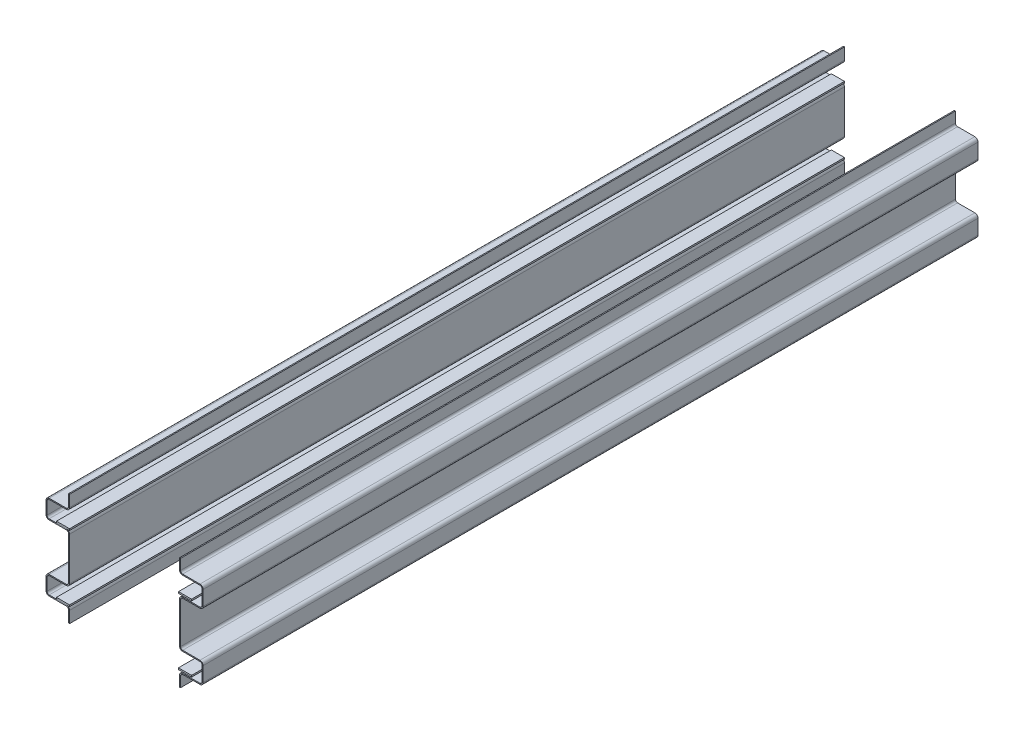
ISO-10303-21;
HEADER;
FILE_DESCRIPTION(('STEP AP214'),'2;1');
FILE_NAME('part.step','',(''),(''),'','','');
FILE_SCHEMA(('AUTOMOTIVE_DESIGN { 1 0 10303 214 1 1 1 1 }'));
ENDSEC;
DATA;
#1=APPLICATION_CONTEXT('core data for automotive mechanical design processes');
#2=APPLICATION_PROTOCOL_DEFINITION('international standard','automotive_design',2000,#1);
#3=PRODUCT_CONTEXT('',#1,'mechanical');
#4=PRODUCT('Part','Part','',(#3));
#5=PRODUCT_RELATED_PRODUCT_CATEGORY('part','',(#4));
#6=PRODUCT_DEFINITION_FORMATION('','',#4);
#7=PRODUCT_DEFINITION_CONTEXT('part definition',#1,'design');
#8=PRODUCT_DEFINITION('design','',#6,#7);
#9=PRODUCT_DEFINITION_SHAPE('','',#8);
#10=(LENGTH_UNIT() NAMED_UNIT(*) SI_UNIT(.MILLI.,.METRE.));
#11=(NAMED_UNIT(*) PLANE_ANGLE_UNIT() SI_UNIT($,.RADIAN.));
#12=(NAMED_UNIT(*) SI_UNIT($,.STERADIAN.) SOLID_ANGLE_UNIT());
#13=UNCERTAINTY_MEASURE_WITH_UNIT(LENGTH_MEASURE(1.E-05),#10,'distance_accuracy_value','');
#14=(GEOMETRIC_REPRESENTATION_CONTEXT(3) GLOBAL_UNCERTAINTY_ASSIGNED_CONTEXT((#13)) GLOBAL_UNIT_ASSIGNED_CONTEXT((#10,
#11,#12)) REPRESENTATION_CONTEXT('',''));
#15=CARTESIAN_POINT('',(0.,0.,0.));
#16=DIRECTION('',(0.,0.,1.));
#17=DIRECTION('',(1.,0.,0.));
#18=AXIS2_PLACEMENT_3D('',#15,#16,#17);
#19=CARTESIAN_POINT('',(-106.,151.,-1480.));
#20=DIRECTION('',(0.,0.,-1.));
#21=DIRECTION('',(-1.,0.,0.));
#22=AXIS2_PLACEMENT_3D('',#19,#20,#21);
#23=PLANE('',#22);
#24=DIRECTION('',(-1.,0.,0.));
#25=VECTOR('',#24,1.);
#26=CARTESIAN_POINT('',(128.999999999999,160.000000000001,-1480.));
#27=LINE('',#26,#25);
#28=CARTESIAN_POINT('',(128.999999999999,160.000000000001,-1480.));
#29=VERTEX_POINT('',#28);
#30=CARTESIAN_POINT('',(103.999999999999,160.,-1480.));
#31=VERTEX_POINT('',#30);
#32=EDGE_CURVE('E58',#29,#31,#27,.T.);
#33=ORIENTED_EDGE('',*,*,#32,.F.);
#34=DIRECTION('',(0.,1.,0.));
#35=VECTOR('',#34,1.);
#36=CARTESIAN_POINT('',(128.999999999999,160.000000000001,-1480.));
#37=LINE('',#36,#35);
#38=CARTESIAN_POINT('',(128.999999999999,157.000000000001,-1480.));
#39=VERTEX_POINT('',#38);
#40=EDGE_CURVE('E81',#39,#29,#37,.T.);
#41=ORIENTED_EDGE('',*,*,#40,.F.);
#42=DIRECTION('',(1.,0.,0.));
#43=VECTOR('',#42,1.);
#44=CARTESIAN_POINT('',(128.999999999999,157.000000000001,-1480.));
#45=LINE('',#44,#43);
#46=CARTESIAN_POINT('',(103.999999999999,157.,-1480.));
#47=VERTEX_POINT('',#46);
#48=EDGE_CURVE('E86',#47,#39,#45,.T.);
#49=ORIENTED_EDGE('',*,*,#48,.F.);
#50=DIRECTION('',(0.,-1.,0.));
#51=VECTOR('',#50,1.);
#52=CARTESIAN_POINT('',(103.999999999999,160.,-1480.));
#53=LINE('',#52,#51);
#54=EDGE_CURVE('E101',#31,#47,#53,.T.);
#55=ORIENTED_EDGE('',*,*,#54,.F.);
#56=EDGE_LOOP('',(#33,#41,#49,#55));
#57=FACE_BOUND('',#56,.T.);
#58=ADVANCED_FACE('F50',(#57),#23,.T.);
#59=CARTESIAN_POINT('',(0.,0.,0.));
#60=DIRECTION('',(0.,0.,1.));
#61=DIRECTION('',(1.,0.,0.));
#62=AXIS2_PLACEMENT_3D('',#59,#60,#61);
#63=PLANE('',#62);
#64=DIRECTION('',(-1.,0.,0.));
#65=VECTOR('',#64,1.);
#66=CARTESIAN_POINT('',(128.999999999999,160.000000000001,0.));
#67=LINE('',#66,#65);
#68=CARTESIAN_POINT('',(128.999999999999,160.000000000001,0.));
#69=VERTEX_POINT('',#68);
#70=CARTESIAN_POINT('',(103.999999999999,160.,0.));
#71=VERTEX_POINT('',#70);
#72=EDGE_CURVE('E110',#69,#71,#67,.T.);
#73=ORIENTED_EDGE('',*,*,#72,.T.);
#74=DIRECTION('',(0.,-1.,0.));
#75=VECTOR('',#74,1.);
#76=CARTESIAN_POINT('',(103.999999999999,160.,0.));
#77=LINE('',#76,#75);
#78=CARTESIAN_POINT('',(103.999999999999,157.,0.));
#79=VERTEX_POINT('',#78);
#80=EDGE_CURVE('E99',#71,#79,#77,.T.);
#81=ORIENTED_EDGE('',*,*,#80,.T.);
#82=DIRECTION('',(1.,0.,0.));
#83=VECTOR('',#82,1.);
#84=CARTESIAN_POINT('',(128.999999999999,157.000000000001,0.));
#85=LINE('',#84,#83);
#86=CARTESIAN_POINT('',(128.999999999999,157.000000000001,0.));
#87=VERTEX_POINT('',#86);
#88=EDGE_CURVE('E102',#79,#87,#85,.T.);
#89=ORIENTED_EDGE('',*,*,#88,.T.);
#90=DIRECTION('',(0.,1.,0.));
#91=VECTOR('',#90,1.);
#92=CARTESIAN_POINT('',(128.999999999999,160.000000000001,0.));
#93=LINE('',#92,#91);
#94=EDGE_CURVE('E107',#87,#69,#93,.T.);
#95=ORIENTED_EDGE('',*,*,#94,.T.);
#96=EDGE_LOOP('',(#73,#81,#89,#95));
#97=FACE_BOUND('',#96,.T.);
#98=ADVANCED_FACE('F109',(#97),#63,.T.);
#99=CARTESIAN_POINT('',(103.999999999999,160.,-1505.17935662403));
#100=DIRECTION('',(-1.,0.,0.));
#101=DIRECTION('',(0.,0.,1.));
#102=AXIS2_PLACEMENT_3D('',#99,#100,#101);
#103=PLANE('',#102);
#104=DIRECTION('',(0.,0.,1.));
#105=VECTOR('',#104,1.);
#106=CARTESIAN_POINT('',(103.999999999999,160.,-1505.17935662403));
#107=LINE('',#106,#105);
#108=EDGE_CURVE('E12',#31,#71,#107,.T.);
#109=ORIENTED_EDGE('',*,*,#108,.F.);
#110=ORIENTED_EDGE('',*,*,#54,.T.);
#111=DIRECTION('',(0.,0.,1.));
#112=VECTOR('',#111,1.);
#113=CARTESIAN_POINT('',(103.999999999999,157.,-1505.17935662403));
#114=LINE('',#113,#112);
#115=EDGE_CURVE('E96',#47,#79,#114,.T.);
#116=ORIENTED_EDGE('',*,*,#115,.T.);
#117=ORIENTED_EDGE('',*,*,#80,.F.);
#118=EDGE_LOOP('',(#109,#110,#116,#117));
#119=FACE_BOUND('',#118,.T.);
#120=ADVANCED_FACE('F97',(#119),#103,.T.);
#121=CARTESIAN_POINT('',(128.999999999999,157.000000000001,-1505.17935662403));
#122=DIRECTION('',(0.,-1.,0.));
#123=DIRECTION('',(1.,0.,0.));
#124=AXIS2_PLACEMENT_3D('',#121,#122,#123);
#125=PLANE('',#124);
#126=ORIENTED_EDGE('',*,*,#115,.F.);
#127=ORIENTED_EDGE('',*,*,#48,.T.);
#128=DIRECTION('',(0.,0.,1.));
#129=VECTOR('',#128,1.);
#130=CARTESIAN_POINT('',(128.999999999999,157.000000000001,-1505.17935662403));
#131=LINE('',#130,#129);
#132=EDGE_CURVE('E91',#39,#87,#131,.T.);
#133=ORIENTED_EDGE('',*,*,#132,.T.);
#134=ORIENTED_EDGE('',*,*,#88,.F.);
#135=EDGE_LOOP('',(#126,#127,#133,#134));
#136=FACE_BOUND('',#135,.T.);
#137=ADVANCED_FACE('F103',(#136),#125,.T.);
#138=CARTESIAN_POINT('',(128.999999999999,160.000000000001,-1505.17935662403));
#139=DIRECTION('',(1.,0.,0.));
#140=DIRECTION('',(0.,0.,-1.));
#141=AXIS2_PLACEMENT_3D('',#138,#139,#140);
#142=PLANE('',#141);
#143=ORIENTED_EDGE('',*,*,#132,.F.);
#144=ORIENTED_EDGE('',*,*,#40,.T.);
#145=DIRECTION('',(0.,0.,1.));
#146=VECTOR('',#145,1.);
#147=CARTESIAN_POINT('',(128.999999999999,160.000000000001,-1505.17935662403));
#148=LINE('',#147,#146);
#149=EDGE_CURVE('E117',#29,#69,#148,.T.);
#150=ORIENTED_EDGE('',*,*,#149,.T.);
#151=ORIENTED_EDGE('',*,*,#94,.F.);
#152=EDGE_LOOP('',(#143,#144,#150,#151));
#153=FACE_BOUND('',#152,.T.);
#154=ADVANCED_FACE('F123',(#153),#142,.T.);
#155=CARTESIAN_POINT('',(128.999999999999,160.000000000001,-1505.17935662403));
#156=DIRECTION('',(0.,1.,0.));
#157=DIRECTION('',(-1.,0.,0.));
#158=AXIS2_PLACEMENT_3D('',#155,#156,#157);
#159=PLANE('',#158);
#160=ORIENTED_EDGE('',*,*,#149,.F.);
#161=ORIENTED_EDGE('',*,*,#32,.T.);
#162=ORIENTED_EDGE('',*,*,#108,.T.);
#163=ORIENTED_EDGE('',*,*,#72,.F.);
#164=EDGE_LOOP('',(#160,#161,#162,#163));
#165=FACE_BOUND('',#164,.T.);
#166=ADVANCED_FACE('F124',(#165),#159,.T.);
#167=CLOSED_SHELL('',(#58,#98,#120,#137,#154,#166));
#168=MANIFOLD_SOLID_BREP('B2',#167);
#169=CARTESIAN_POINT('',(-106.,151.,-1480.));
#170=DIRECTION('',(0.,0.,-1.));
#171=DIRECTION('',(-1.,0.,0.));
#172=AXIS2_PLACEMENT_3D('',#169,#170,#171);
#173=PLANE('',#172);
#174=DIRECTION('',(-1.,0.,0.));
#175=VECTOR('',#174,1.);
#176=CARTESIAN_POINT('',(129.,34.0000000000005,-1480.));
#177=LINE('',#176,#175);
#178=CARTESIAN_POINT('',(129.,34.0000000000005,-1480.));
#179=VERTEX_POINT('',#178);
#180=CARTESIAN_POINT('',(104.,34.0000000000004,-1480.));
#181=VERTEX_POINT('',#180);
#182=EDGE_CURVE('E192',#179,#181,#177,.T.);
#183=ORIENTED_EDGE('',*,*,#182,.F.);
#184=DIRECTION('',(0.,1.,0.));
#185=VECTOR('',#184,1.);
#186=CARTESIAN_POINT('',(129.,34.0000000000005,-1480.));
#187=LINE('',#186,#185);
#188=CARTESIAN_POINT('',(129.,31.0000000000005,-1480.));
#189=VERTEX_POINT('',#188);
#190=EDGE_CURVE('E215',#189,#179,#187,.T.);
#191=ORIENTED_EDGE('',*,*,#190,.F.);
#192=DIRECTION('',(1.,0.,0.));
#193=VECTOR('',#192,1.);
#194=CARTESIAN_POINT('',(129.,31.0000000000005,-1480.));
#195=LINE('',#194,#193);
#196=CARTESIAN_POINT('',(104.,31.0000000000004,-1480.));
#197=VERTEX_POINT('',#196);
#198=EDGE_CURVE('E220',#197,#189,#195,.T.);
#199=ORIENTED_EDGE('',*,*,#198,.F.);
#200=DIRECTION('',(0.,-1.,0.));
#201=VECTOR('',#200,1.);
#202=CARTESIAN_POINT('',(104.,34.0000000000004,-1480.));
#203=LINE('',#202,#201);
#204=EDGE_CURVE('E235',#181,#197,#203,.T.);
#205=ORIENTED_EDGE('',*,*,#204,.F.);
#206=EDGE_LOOP('',(#183,#191,#199,#205));
#207=FACE_BOUND('',#206,.T.);
#208=ADVANCED_FACE('F184',(#207),#173,.T.);
#209=CARTESIAN_POINT('',(0.,0.,0.));
#210=DIRECTION('',(0.,0.,1.));
#211=DIRECTION('',(1.,0.,0.));
#212=AXIS2_PLACEMENT_3D('',#209,#210,#211);
#213=PLANE('',#212);
#214=DIRECTION('',(-1.,0.,0.));
#215=VECTOR('',#214,1.);
#216=CARTESIAN_POINT('',(129.,34.0000000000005,0.));
#217=LINE('',#216,#215);
#218=CARTESIAN_POINT('',(129.,34.0000000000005,0.));
#219=VERTEX_POINT('',#218);
#220=CARTESIAN_POINT('',(104.,34.0000000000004,0.));
#221=VERTEX_POINT('',#220);
#222=EDGE_CURVE('E244',#219,#221,#217,.T.);
#223=ORIENTED_EDGE('',*,*,#222,.T.);
#224=DIRECTION('',(0.,-1.,0.));
#225=VECTOR('',#224,1.);
#226=CARTESIAN_POINT('',(104.,34.0000000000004,0.));
#227=LINE('',#226,#225);
#228=CARTESIAN_POINT('',(104.,31.0000000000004,0.));
#229=VERTEX_POINT('',#228);
#230=EDGE_CURVE('E233',#221,#229,#227,.T.);
#231=ORIENTED_EDGE('',*,*,#230,.T.);
#232=DIRECTION('',(1.,0.,0.));
#233=VECTOR('',#232,1.);
#234=CARTESIAN_POINT('',(129.,31.0000000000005,0.));
#235=LINE('',#234,#233);
#236=CARTESIAN_POINT('',(129.,31.0000000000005,0.));
#237=VERTEX_POINT('',#236);
#238=EDGE_CURVE('E236',#229,#237,#235,.T.);
#239=ORIENTED_EDGE('',*,*,#238,.T.);
#240=DIRECTION('',(0.,1.,0.));
#241=VECTOR('',#240,1.);
#242=CARTESIAN_POINT('',(129.,34.0000000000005,0.));
#243=LINE('',#242,#241);
#244=EDGE_CURVE('E241',#237,#219,#243,.T.);
#245=ORIENTED_EDGE('',*,*,#244,.T.);
#246=EDGE_LOOP('',(#223,#231,#239,#245));
#247=FACE_BOUND('',#246,.T.);
#248=ADVANCED_FACE('F243',(#247),#213,.T.);
#249=CARTESIAN_POINT('',(104.,34.0000000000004,-1505.17935662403));
#250=DIRECTION('',(-1.,0.,0.));
#251=DIRECTION('',(0.,0.,1.));
#252=AXIS2_PLACEMENT_3D('',#249,#250,#251);
#253=PLANE('',#252);
#254=DIRECTION('',(0.,0.,1.));
#255=VECTOR('',#254,1.);
#256=CARTESIAN_POINT('',(104.,34.0000000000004,-1505.17935662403));
#257=LINE('',#256,#255);
#258=EDGE_CURVE('E48',#181,#221,#257,.T.);
#259=ORIENTED_EDGE('',*,*,#258,.F.);
#260=ORIENTED_EDGE('',*,*,#204,.T.);
#261=DIRECTION('',(0.,0.,1.));
#262=VECTOR('',#261,1.);
#263=CARTESIAN_POINT('',(104.,31.0000000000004,-1505.17935662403));
#264=LINE('',#263,#262);
#265=EDGE_CURVE('E230',#197,#229,#264,.T.);
#266=ORIENTED_EDGE('',*,*,#265,.T.);
#267=ORIENTED_EDGE('',*,*,#230,.F.);
#268=EDGE_LOOP('',(#259,#260,#266,#267));
#269=FACE_BOUND('',#268,.T.);
#270=ADVANCED_FACE('F231',(#269),#253,.T.);
#271=CARTESIAN_POINT('',(129.,31.0000000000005,-1505.17935662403));
#272=DIRECTION('',(0.,-1.,0.));
#273=DIRECTION('',(1.,0.,0.));
#274=AXIS2_PLACEMENT_3D('',#271,#272,#273);
#275=PLANE('',#274);
#276=ORIENTED_EDGE('',*,*,#265,.F.);
#277=ORIENTED_EDGE('',*,*,#198,.T.);
#278=DIRECTION('',(0.,0.,1.));
#279=VECTOR('',#278,1.);
#280=CARTESIAN_POINT('',(129.,31.0000000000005,-1505.17935662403));
#281=LINE('',#280,#279);
#282=EDGE_CURVE('E225',#189,#237,#281,.T.);
#283=ORIENTED_EDGE('',*,*,#282,.T.);
#284=ORIENTED_EDGE('',*,*,#238,.F.);
#285=EDGE_LOOP('',(#276,#277,#283,#284));
#286=FACE_BOUND('',#285,.T.);
#287=ADVANCED_FACE('F237',(#286),#275,.T.);
#288=CARTESIAN_POINT('',(129.,34.0000000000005,-1505.17935662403));
#289=DIRECTION('',(1.,0.,0.));
#290=DIRECTION('',(0.,1.,0.));
#291=AXIS2_PLACEMENT_3D('',#288,#289,#290);
#292=PLANE('',#291);
#293=ORIENTED_EDGE('',*,*,#282,.F.);
#294=ORIENTED_EDGE('',*,*,#190,.T.);
#295=DIRECTION('',(0.,0.,1.));
#296=VECTOR('',#295,1.);
#297=CARTESIAN_POINT('',(129.,34.0000000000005,-1505.17935662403));
#298=LINE('',#297,#296);
#299=EDGE_CURVE('E251',#179,#219,#298,.T.);
#300=ORIENTED_EDGE('',*,*,#299,.T.);
#301=ORIENTED_EDGE('',*,*,#244,.F.);
#302=EDGE_LOOP('',(#293,#294,#300,#301));
#303=FACE_BOUND('',#302,.T.);
#304=ADVANCED_FACE('F257',(#303),#292,.T.);
#305=CARTESIAN_POINT('',(129.,34.0000000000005,-1505.17935662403));
#306=DIRECTION('',(0.,1.,0.));
#307=DIRECTION('',(-1.,0.,0.));
#308=AXIS2_PLACEMENT_3D('',#305,#306,#307);
#309=PLANE('',#308);
#310=ORIENTED_EDGE('',*,*,#299,.F.);
#311=ORIENTED_EDGE('',*,*,#182,.T.);
#312=ORIENTED_EDGE('',*,*,#258,.T.);
#313=ORIENTED_EDGE('',*,*,#222,.F.);
#314=EDGE_LOOP('',(#310,#311,#312,#313));
#315=FACE_BOUND('',#314,.T.);
#316=ADVANCED_FACE('F258',(#315),#309,.T.);
#317=CLOSED_SHELL('',(#208,#248,#270,#287,#304,#316));
#318=MANIFOLD_SOLID_BREP('B6',#317);
#319=CARTESIAN_POINT('',(-106.,151.,-1480.));
#320=DIRECTION('',(0.,0.,-1.));
#321=DIRECTION('',(-1.,0.,0.));
#322=AXIS2_PLACEMENT_3D('',#319,#320,#321);
#323=PLANE('',#322);
#324=DIRECTION('',(0.,-1.,0.));
#325=VECTOR('',#324,1.);
#326=CARTESIAN_POINT('',(-129.,33.9999999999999,-1480.));
#327=LINE('',#326,#325);
#328=CARTESIAN_POINT('',(-129.,33.9999999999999,-1480.));
#329=VERTEX_POINT('',#328);
#330=CARTESIAN_POINT('',(-129.,30.9999999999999,-1480.));
#331=VERTEX_POINT('',#330);
#332=EDGE_CURVE('E326',#329,#331,#327,.T.);
#333=ORIENTED_EDGE('',*,*,#332,.F.);
#334=DIRECTION('',(-1.,0.,0.));
#335=VECTOR('',#334,1.);
#336=CARTESIAN_POINT('',(-129.,33.9999999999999,-1480.));
#337=LINE('',#336,#335);
#338=CARTESIAN_POINT('',(-104.,33.9999999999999,-1480.));
#339=VERTEX_POINT('',#338);
#340=EDGE_CURVE('E349',#339,#329,#337,.T.);
#341=ORIENTED_EDGE('',*,*,#340,.F.);
#342=DIRECTION('',(0.,1.,0.));
#343=VECTOR('',#342,1.);
#344=CARTESIAN_POINT('',(-104.,33.9999999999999,-1480.));
#345=LINE('',#344,#343);
#346=CARTESIAN_POINT('',(-104.,30.9999999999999,-1480.));
#347=VERTEX_POINT('',#346);
#348=EDGE_CURVE('E354',#347,#339,#345,.T.);
#349=ORIENTED_EDGE('',*,*,#348,.F.);
#350=DIRECTION('',(1.,0.,0.));
#351=VECTOR('',#350,1.);
#352=CARTESIAN_POINT('',(-129.,30.9999999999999,-1480.));
#353=LINE('',#352,#351);
#354=EDGE_CURVE('E369',#331,#347,#353,.T.);
#355=ORIENTED_EDGE('',*,*,#354,.F.);
#356=EDGE_LOOP('',(#333,#341,#349,#355));
#357=FACE_BOUND('',#356,.T.);
#358=ADVANCED_FACE('F318',(#357),#323,.T.);
#359=CARTESIAN_POINT('',(0.,0.,0.));
#360=DIRECTION('',(0.,0.,1.));
#361=DIRECTION('',(1.,0.,0.));
#362=AXIS2_PLACEMENT_3D('',#359,#360,#361);
#363=PLANE('',#362);
#364=DIRECTION('',(0.,-1.,0.));
#365=VECTOR('',#364,1.);
#366=CARTESIAN_POINT('',(-129.,33.9999999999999,0.));
#367=LINE('',#366,#365);
#368=CARTESIAN_POINT('',(-129.,33.9999999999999,0.));
#369=VERTEX_POINT('',#368);
#370=CARTESIAN_POINT('',(-129.,30.9999999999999,0.));
#371=VERTEX_POINT('',#370);
#372=EDGE_CURVE('E378',#369,#371,#367,.T.);
#373=ORIENTED_EDGE('',*,*,#372,.T.);
#374=DIRECTION('',(1.,0.,0.));
#375=VECTOR('',#374,1.);
#376=CARTESIAN_POINT('',(-129.,30.9999999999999,0.));
#377=LINE('',#376,#375);
#378=CARTESIAN_POINT('',(-104.,30.9999999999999,0.));
#379=VERTEX_POINT('',#378);
#380=EDGE_CURVE('E367',#371,#379,#377,.T.);
#381=ORIENTED_EDGE('',*,*,#380,.T.);
#382=DIRECTION('',(0.,1.,0.));
#383=VECTOR('',#382,1.);
#384=CARTESIAN_POINT('',(-104.,33.9999999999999,0.));
#385=LINE('',#384,#383);
#386=CARTESIAN_POINT('',(-104.,33.9999999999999,0.));
#387=VERTEX_POINT('',#386);
#388=EDGE_CURVE('E370',#379,#387,#385,.T.);
#389=ORIENTED_EDGE('',*,*,#388,.T.);
#390=DIRECTION('',(-1.,0.,0.));
#391=VECTOR('',#390,1.);
#392=CARTESIAN_POINT('',(-129.,33.9999999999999,0.));
#393=LINE('',#392,#391);
#394=EDGE_CURVE('E375',#387,#369,#393,.T.);
#395=ORIENTED_EDGE('',*,*,#394,.T.);
#396=EDGE_LOOP('',(#373,#381,#389,#395));
#397=FACE_BOUND('',#396,.T.);
#398=ADVANCED_FACE('F377',(#397),#363,.T.);
#399=CARTESIAN_POINT('',(-129.,30.9999999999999,-1505.17935662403));
#400=DIRECTION('',(0.,-1.,0.));
#401=DIRECTION('',(0.,0.,-1.));
#402=AXIS2_PLACEMENT_3D('',#399,#400,#401);
#403=PLANE('',#402);
#404=DIRECTION('',(0.,0.,1.));
#405=VECTOR('',#404,1.);
#406=CARTESIAN_POINT('',(-129.,30.9999999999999,-1505.17935662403));
#407=LINE('',#406,#405);
#408=EDGE_CURVE('E182',#331,#371,#407,.T.);
#409=ORIENTED_EDGE('',*,*,#408,.F.);
#410=ORIENTED_EDGE('',*,*,#354,.T.);
#411=DIRECTION('',(0.,0.,1.));
#412=VECTOR('',#411,1.);
#413=CARTESIAN_POINT('',(-104.,30.9999999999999,-1505.17935662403));
#414=LINE('',#413,#412);
#415=EDGE_CURVE('E364',#347,#379,#414,.T.);
#416=ORIENTED_EDGE('',*,*,#415,.T.);
#417=ORIENTED_EDGE('',*,*,#380,.F.);
#418=EDGE_LOOP('',(#409,#410,#416,#417));
#419=FACE_BOUND('',#418,.T.);
#420=ADVANCED_FACE('F365',(#419),#403,.T.);
#421=CARTESIAN_POINT('',(-104.,33.9999999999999,-1505.17935662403));
#422=DIRECTION('',(1.,0.,0.));
#423=DIRECTION('',(0.,0.,-1.));
#424=AXIS2_PLACEMENT_3D('',#421,#422,#423);
#425=PLANE('',#424);
#426=ORIENTED_EDGE('',*,*,#415,.F.);
#427=ORIENTED_EDGE('',*,*,#348,.T.);
#428=DIRECTION('',(0.,0.,1.));
#429=VECTOR('',#428,1.);
#430=CARTESIAN_POINT('',(-104.,33.9999999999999,-1505.17935662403));
#431=LINE('',#430,#429);
#432=EDGE_CURVE('E359',#339,#387,#431,.T.);
#433=ORIENTED_EDGE('',*,*,#432,.T.);
#434=ORIENTED_EDGE('',*,*,#388,.F.);
#435=EDGE_LOOP('',(#426,#427,#433,#434));
#436=FACE_BOUND('',#435,.T.);
#437=ADVANCED_FACE('F371',(#436),#425,.T.);
#438=CARTESIAN_POINT('',(-129.,33.9999999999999,-1505.17935662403));
#439=DIRECTION('',(0.,1.,0.));
#440=DIRECTION('',(0.,0.,1.));
#441=AXIS2_PLACEMENT_3D('',#438,#439,#440);
#442=PLANE('',#441);
#443=ORIENTED_EDGE('',*,*,#432,.F.);
#444=ORIENTED_EDGE('',*,*,#340,.T.);
#445=DIRECTION('',(0.,0.,1.));
#446=VECTOR('',#445,1.);
#447=CARTESIAN_POINT('',(-129.,33.9999999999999,-1505.17935662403));
#448=LINE('',#447,#446);
#449=EDGE_CURVE('E385',#329,#369,#448,.T.);
#450=ORIENTED_EDGE('',*,*,#449,.T.);
#451=ORIENTED_EDGE('',*,*,#394,.F.);
#452=EDGE_LOOP('',(#443,#444,#450,#451));
#453=FACE_BOUND('',#452,.T.);
#454=ADVANCED_FACE('F391',(#453),#442,.T.);
#455=CARTESIAN_POINT('',(-129.,33.9999999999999,-1505.17935662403));
#456=DIRECTION('',(-1.,0.,0.));
#457=DIRECTION('',(0.,0.,1.));
#458=AXIS2_PLACEMENT_3D('',#455,#456,#457);
#459=PLANE('',#458);
#460=ORIENTED_EDGE('',*,*,#449,.F.);
#461=ORIENTED_EDGE('',*,*,#332,.T.);
#462=ORIENTED_EDGE('',*,*,#408,.T.);
#463=ORIENTED_EDGE('',*,*,#372,.F.);
#464=EDGE_LOOP('',(#460,#461,#462,#463));
#465=FACE_BOUND('',#464,.T.);
#466=ADVANCED_FACE('F392',(#465),#459,.T.);
#467=CLOSED_SHELL('',(#358,#398,#420,#437,#454,#466));
#468=MANIFOLD_SOLID_BREP('B42',#467);
#469=CARTESIAN_POINT('',(-106.,151.,-1480.));
#470=DIRECTION('',(0.,0.,-1.));
#471=DIRECTION('',(-1.,0.,0.));
#472=AXIS2_PLACEMENT_3D('',#469,#470,#471);
#473=PLANE('',#472);
#474=DIRECTION('',(0.,-1.,0.));
#475=VECTOR('',#474,1.);
#476=CARTESIAN_POINT('',(-129.,160.,-1480.));
#477=LINE('',#476,#475);
#478=CARTESIAN_POINT('',(-129.,160.,-1480.));
#479=VERTEX_POINT('',#478);
#480=CARTESIAN_POINT('',(-129.,157.,-1480.));
#481=VERTEX_POINT('',#480);
#482=EDGE_CURVE('E460',#479,#481,#477,.T.);
#483=ORIENTED_EDGE('',*,*,#482,.F.);
#484=DIRECTION('',(-1.,0.,0.));
#485=VECTOR('',#484,1.);
#486=CARTESIAN_POINT('',(-129.,160.,-1480.));
#487=LINE('',#486,#485);
#488=CARTESIAN_POINT('',(-104.,160.,-1480.));
#489=VERTEX_POINT('',#488);
#490=EDGE_CURVE('E483',#489,#479,#487,.T.);
#491=ORIENTED_EDGE('',*,*,#490,.F.);
#492=DIRECTION('',(0.,1.,0.));
#493=VECTOR('',#492,1.);
#494=CARTESIAN_POINT('',(-104.,160.,-1480.));
#495=LINE('',#494,#493);
#496=CARTESIAN_POINT('',(-104.,157.,-1480.));
#497=VERTEX_POINT('',#496);
#498=EDGE_CURVE('E488',#497,#489,#495,.T.);
#499=ORIENTED_EDGE('',*,*,#498,.F.);
#500=DIRECTION('',(1.,0.,0.));
#501=VECTOR('',#500,1.);
#502=CARTESIAN_POINT('',(-129.,157.,-1480.));
#503=LINE('',#502,#501);
#504=EDGE_CURVE('E503',#481,#497,#503,.T.);
#505=ORIENTED_EDGE('',*,*,#504,.F.);
#506=EDGE_LOOP('',(#483,#491,#499,#505));
#507=FACE_BOUND('',#506,.T.);
#508=ADVANCED_FACE('F452',(#507),#473,.T.);
#509=CARTESIAN_POINT('',(0.,0.,0.));
#510=DIRECTION('',(0.,0.,1.));
#511=DIRECTION('',(1.,0.,0.));
#512=AXIS2_PLACEMENT_3D('',#509,#510,#511);
#513=PLANE('',#512);
#514=DIRECTION('',(0.,-1.,0.));
#515=VECTOR('',#514,1.);
#516=CARTESIAN_POINT('',(-129.,160.,0.));
#517=LINE('',#516,#515);
#518=CARTESIAN_POINT('',(-129.,160.,0.));
#519=VERTEX_POINT('',#518);
#520=CARTESIAN_POINT('',(-129.,157.,0.));
#521=VERTEX_POINT('',#520);
#522=EDGE_CURVE('E512',#519,#521,#517,.T.);
#523=ORIENTED_EDGE('',*,*,#522,.T.);
#524=DIRECTION('',(1.,0.,0.));
#525=VECTOR('',#524,1.);
#526=CARTESIAN_POINT('',(-129.,157.,0.));
#527=LINE('',#526,#525);
#528=CARTESIAN_POINT('',(-104.,157.,0.));
#529=VERTEX_POINT('',#528);
#530=EDGE_CURVE('E501',#521,#529,#527,.T.);
#531=ORIENTED_EDGE('',*,*,#530,.T.);
#532=DIRECTION('',(0.,1.,0.));
#533=VECTOR('',#532,1.);
#534=CARTESIAN_POINT('',(-104.,160.,0.));
#535=LINE('',#534,#533);
#536=CARTESIAN_POINT('',(-104.,160.,0.));
#537=VERTEX_POINT('',#536);
#538=EDGE_CURVE('E504',#529,#537,#535,.T.);
#539=ORIENTED_EDGE('',*,*,#538,.T.);
#540=DIRECTION('',(-1.,0.,0.));
#541=VECTOR('',#540,1.);
#542=CARTESIAN_POINT('',(-129.,160.,0.));
#543=LINE('',#542,#541);
#544=EDGE_CURVE('E509',#537,#519,#543,.T.);
#545=ORIENTED_EDGE('',*,*,#544,.T.);
#546=EDGE_LOOP('',(#523,#531,#539,#545));
#547=FACE_BOUND('',#546,.T.);
#548=ADVANCED_FACE('F511',(#547),#513,.T.);
#549=CARTESIAN_POINT('',(-129.,157.,-1505.17935662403));
#550=DIRECTION('',(0.,-1.,0.));
#551=DIRECTION('',(0.,0.,-1.));
#552=AXIS2_PLACEMENT_3D('',#549,#550,#551);
#553=PLANE('',#552);
#554=DIRECTION('',(0.,0.,1.));
#555=VECTOR('',#554,1.);
#556=CARTESIAN_POINT('',(-129.,157.,-1505.17935662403));
#557=LINE('',#556,#555);
#558=EDGE_CURVE('E316',#481,#521,#557,.T.);
#559=ORIENTED_EDGE('',*,*,#558,.F.);
#560=ORIENTED_EDGE('',*,*,#504,.T.);
#561=DIRECTION('',(0.,0.,1.));
#562=VECTOR('',#561,1.);
#563=CARTESIAN_POINT('',(-104.,157.,-1505.17935662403));
#564=LINE('',#563,#562);
#565=EDGE_CURVE('E498',#497,#529,#564,.T.);
#566=ORIENTED_EDGE('',*,*,#565,.T.);
#567=ORIENTED_EDGE('',*,*,#530,.F.);
#568=EDGE_LOOP('',(#559,#560,#566,#567));
#569=FACE_BOUND('',#568,.T.);
#570=ADVANCED_FACE('F499',(#569),#553,.T.);
#571=CARTESIAN_POINT('',(-104.,160.,-1505.17935662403));
#572=DIRECTION('',(1.,0.,0.));
#573=DIRECTION('',(0.,0.,-1.));
#574=AXIS2_PLACEMENT_3D('',#571,#572,#573);
#575=PLANE('',#574);
#576=ORIENTED_EDGE('',*,*,#565,.F.);
#577=ORIENTED_EDGE('',*,*,#498,.T.);
#578=DIRECTION('',(0.,0.,1.));
#579=VECTOR('',#578,1.);
#580=CARTESIAN_POINT('',(-104.,160.,-1505.17935662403));
#581=LINE('',#580,#579);
#582=EDGE_CURVE('E493',#489,#537,#581,.T.);
#583=ORIENTED_EDGE('',*,*,#582,.T.);
#584=ORIENTED_EDGE('',*,*,#538,.F.);
#585=EDGE_LOOP('',(#576,#577,#583,#584));
#586=FACE_BOUND('',#585,.T.);
#587=ADVANCED_FACE('F505',(#586),#575,.T.);
#588=CARTESIAN_POINT('',(-129.,160.,-1505.17935662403));
#589=DIRECTION('',(0.,1.,0.));
#590=DIRECTION('',(0.,0.,1.));
#591=AXIS2_PLACEMENT_3D('',#588,#589,#590);
#592=PLANE('',#591);
#593=ORIENTED_EDGE('',*,*,#582,.F.);
#594=ORIENTED_EDGE('',*,*,#490,.T.);
#595=DIRECTION('',(0.,0.,1.));
#596=VECTOR('',#595,1.);
#597=CARTESIAN_POINT('',(-129.,160.,-1505.17935662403));
#598=LINE('',#597,#596);
#599=EDGE_CURVE('E519',#479,#519,#598,.T.);
#600=ORIENTED_EDGE('',*,*,#599,.T.);
#601=ORIENTED_EDGE('',*,*,#544,.F.);
#602=EDGE_LOOP('',(#593,#594,#600,#601));
#603=FACE_BOUND('',#602,.T.);
#604=ADVANCED_FACE('F525',(#603),#592,.T.);
#605=CARTESIAN_POINT('',(-129.,160.,-1505.17935662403));
#606=DIRECTION('',(-1.,0.,0.));
#607=DIRECTION('',(0.,0.,1.));
#608=AXIS2_PLACEMENT_3D('',#605,#606,#607);
#609=PLANE('',#608);
#610=ORIENTED_EDGE('',*,*,#599,.F.);
#611=ORIENTED_EDGE('',*,*,#482,.T.);
#612=ORIENTED_EDGE('',*,*,#558,.T.);
#613=ORIENTED_EDGE('',*,*,#522,.F.);
#614=EDGE_LOOP('',(#610,#611,#612,#613));
#615=FACE_BOUND('',#614,.T.);
#616=ADVANCED_FACE('F526',(#615),#609,.T.);
#617=CLOSED_SHELL('',(#508,#548,#570,#587,#604,#616));
#618=MANIFOLD_SOLID_BREP('B176',#617);
#619=CARTESIAN_POINT('',(106.,23.0000000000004,-1480.));
#620=DIRECTION('',(0.,0.,-1.));
#621=DIRECTION('',(-1.,0.,0.));
#622=AXIS2_PLACEMENT_3D('',#619,#620,#621);
#623=PLANE('',#622);
#624=DIRECTION('',(1.,0.,0.));
#625=VECTOR('',#624,1.);
#626=CARTESIAN_POINT('',(106.,23.0000000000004,-1480.));
#627=LINE('',#626,#625);
#628=CARTESIAN_POINT('',(106.,23.0000000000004,-1480.));
#629=VERTEX_POINT('',#628);
#630=CARTESIAN_POINT('',(108.,23.0000000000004,-1480.));
#631=VERTEX_POINT('',#630);
#632=EDGE_CURVE('E450',#629,#631,#627,.T.);
#633=ORIENTED_EDGE('',*,*,#632,.F.);
#634=CARTESIAN_POINT('',(112.,23.0000000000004,-1480.));
#635=DIRECTION('',(0.,0.,1.));
#636=DIRECTION('',(1.,0.,0.));
#637=AXIS2_PLACEMENT_3D('',#634,#635,#636);
#638=CIRCLE('',#637,6.);
#639=CARTESIAN_POINT('',(112.,29.0000000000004,-1480.));
#640=VERTEX_POINT('',#639);
#641=EDGE_CURVE('E1140',#629,#640,#638,.F.);
#642=ORIENTED_EDGE('',*,*,#641,.T.);
#643=DIRECTION('',(0.,1.,0.));
#644=VECTOR('',#643,1.);
#645=CARTESIAN_POINT('',(112.,27.0000000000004,-1480.));
#646=LINE('',#645,#644);
#647=CARTESIAN_POINT('',(112.,27.0000000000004,-1480.));
#648=VERTEX_POINT('',#647);
#649=EDGE_CURVE('E593',#648,#640,#646,.T.);
#650=ORIENTED_EDGE('',*,*,#649,.F.);
#651=CARTESIAN_POINT('',(112.,23.0000000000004,-1480.));
#652=DIRECTION('',(0.,0.,1.));
#653=DIRECTION('',(1.,0.,0.));
#654=AXIS2_PLACEMENT_3D('',#651,#652,#653);
#655=CIRCLE('',#654,4.);
#656=EDGE_CURVE('E1165',#631,#648,#655,.F.);
#657=ORIENTED_EDGE('',*,*,#656,.F.);
#658=EDGE_LOOP('',(#633,#642,#650,#657));
#659=FACE_BOUND('',#658,.T.);
#660=ADVANCED_FACE('F585',(#659),#623,.T.);
#661=CARTESIAN_POINT('',(112.,27.0000000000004,-1480.));
#662=DIRECTION('',(0.,0.,-1.));
#663=DIRECTION('',(-1.,0.,0.));
#664=AXIS2_PLACEMENT_3D('',#661,#662,#663);
#665=PLANE('',#664);
#666=DIRECTION('',(0.,1.,0.));
#667=VECTOR('',#666,1.);
#668=CARTESIAN_POINT('',(106.,3.00000000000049,-1480.));
#669=LINE('',#668,#667);
#670=CARTESIAN_POINT('',(106.,3.00000000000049,-1480.));
#671=VERTEX_POINT('',#670);
#672=EDGE_CURVE('E1144',#671,#629,#669,.T.);
#673=ORIENTED_EDGE('',*,*,#672,.T.);
#674=ORIENTED_EDGE('',*,*,#632,.T.);
#675=DIRECTION('',(0.,1.,0.));
#676=VECTOR('',#675,1.);
#677=CARTESIAN_POINT('',(108.,3.0000000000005,-1480.));
#678=LINE('',#677,#676);
#679=CARTESIAN_POINT('',(108.,3.0000000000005,-1480.));
#680=VERTEX_POINT('',#679);
#681=EDGE_CURVE('E1162',#680,#631,#678,.T.);
#682=ORIENTED_EDGE('',*,*,#681,.F.);
#683=DIRECTION('',(-1.,0.,0.));
#684=VECTOR('',#683,1.);
#685=CARTESIAN_POINT('',(108.,3.0000000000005,-1480.));
#686=LINE('',#685,#684);
#687=EDGE_CURVE('E1160',#680,#671,#686,.T.);
#688=ORIENTED_EDGE('',*,*,#687,.T.);
#689=EDGE_LOOP('',(#673,#674,#682,#688));
#690=FACE_BOUND('',#689,.T.);
#691=ADVANCED_FACE('F1278',(#690),#665,.T.);
#692=CARTESIAN_POINT('',(112.,29.0000000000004,0.));
#693=DIRECTION('',(0.,0.,1.));
#694=DIRECTION('',(1.,0.,0.));
#695=AXIS2_PLACEMENT_3D('',#692,#693,#694);
#696=PLANE('',#695);
#697=DIRECTION('',(0.,-1.,0.));
#698=VECTOR('',#697,1.);
#699=CARTESIAN_POINT('',(112.,29.0000000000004,0.));
#700=LINE('',#699,#698);
#701=CARTESIAN_POINT('',(112.,29.0000000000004,0.));
#702=VERTEX_POINT('',#701);
#703=CARTESIAN_POINT('',(112.,27.0000000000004,0.));
#704=VERTEX_POINT('',#703);
#705=EDGE_CURVE('E1124',#702,#704,#700,.T.);
#706=ORIENTED_EDGE('',*,*,#705,.F.);
#707=CARTESIAN_POINT('',(112.,23.0000000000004,0.));
#708=DIRECTION('',(0.,0.,1.));
#709=DIRECTION('',(1.,0.,0.));
#710=AXIS2_PLACEMENT_3D('',#707,#708,#709);
#711=CIRCLE('',#710,6.);
#712=CARTESIAN_POINT('',(106.,23.0000000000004,0.));
#713=VERTEX_POINT('',#712);
#714=EDGE_CURVE('E924',#713,#702,#711,.F.);
#715=ORIENTED_EDGE('',*,*,#714,.F.);
#716=DIRECTION('',(-1.,0.,0.));
#717=VECTOR('',#716,1.);
#718=CARTESIAN_POINT('',(108.,23.0000000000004,0.));
#719=LINE('',#718,#717);
#720=CARTESIAN_POINT('',(108.,23.0000000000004,0.));
#721=VERTEX_POINT('',#720);
#722=EDGE_CURVE('E1122',#721,#713,#719,.T.);
#723=ORIENTED_EDGE('',*,*,#722,.F.);
#724=CARTESIAN_POINT('',(112.,23.0000000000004,0.));
#725=DIRECTION('',(0.,0.,1.));
#726=DIRECTION('',(1.,0.,0.));
#727=AXIS2_PLACEMENT_3D('',#724,#725,#726);
#728=CIRCLE('',#727,4.);
#729=EDGE_CURVE('E935',#721,#704,#728,.F.);
#730=ORIENTED_EDGE('',*,*,#729,.T.);
#731=EDGE_LOOP('',(#706,#715,#723,#730));
#732=FACE_BOUND('',#731,.T.);
#733=ADVANCED_FACE('F1286',(#732),#696,.T.);
#734=CARTESIAN_POINT('',(108.,23.0000000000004,0.));
#735=DIRECTION('',(0.,0.,1.));
#736=DIRECTION('',(1.,0.,0.));
#737=AXIS2_PLACEMENT_3D('',#734,#735,#736);
#738=PLANE('',#737);
#739=DIRECTION('',(1.,0.,0.));
#740=VECTOR('',#739,1.);
#741=CARTESIAN_POINT('',(106.,29.0000000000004,0.));
#742=LINE('',#741,#740);
#743=CARTESIAN_POINT('',(145.,29.0000000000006,0.));
#744=VERTEX_POINT('',#743);
#745=EDGE_CURVE('E921',#702,#744,#742,.T.);
#746=ORIENTED_EDGE('',*,*,#745,.F.);
#747=ORIENTED_EDGE('',*,*,#705,.T.);
#748=DIRECTION('',(1.,0.,0.));
#749=VECTOR('',#748,1.);
#750=CARTESIAN_POINT('',(106.,27.0000000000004,0.));
#751=LINE('',#750,#749);
#752=CARTESIAN_POINT('',(145.,27.0000000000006,0.));
#753=VERTEX_POINT('',#752);
#754=EDGE_CURVE('E938',#704,#753,#751,.T.);
#755=ORIENTED_EDGE('',*,*,#754,.T.);
#756=DIRECTION('',(0.,1.,0.));
#757=VECTOR('',#756,1.);
#758=CARTESIAN_POINT('',(145.,27.0000000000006,0.));
#759=LINE('',#758,#757);
#760=EDGE_CURVE('E1114',#753,#744,#759,.T.);
#761=ORIENTED_EDGE('',*,*,#760,.T.);
#762=EDGE_LOOP('',(#746,#747,#755,#761));
#763=FACE_BOUND('',#762,.T.);
#764=ADVANCED_FACE('F1288',(#763),#738,.T.);
#765=CARTESIAN_POINT('',(145.,29.0000000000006,-1480.));
#766=DIRECTION('',(0.,0.,-1.));
#767=DIRECTION('',(-1.,0.,0.));
#768=AXIS2_PLACEMENT_3D('',#765,#766,#767);
#769=PLANE('',#768);
#770=DIRECTION('',(0.,-1.,0.));
#771=VECTOR('',#770,1.);
#772=CARTESIAN_POINT('',(145.,29.0000000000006,-1480.));
#773=LINE('',#772,#771);
#774=CARTESIAN_POINT('',(145.,29.0000000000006,-1480.));
#775=VERTEX_POINT('',#774);
#776=CARTESIAN_POINT('',(145.,27.0000000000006,-1480.));
#777=VERTEX_POINT('',#776);
#778=EDGE_CURVE('E1120',#775,#777,#773,.T.);
#779=ORIENTED_EDGE('',*,*,#778,.F.);
#780=CARTESIAN_POINT('',(145.,33.0000000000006,-1480.));
#781=DIRECTION('',(0.,0.,-1.));
#782=DIRECTION('',(-1.,0.,0.));
#783=AXIS2_PLACEMENT_3D('',#780,#781,#782);
#784=CIRCLE('',#783,4.);
#785=CARTESIAN_POINT('',(149.,33.0000000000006,-1480.));
#786=VERTEX_POINT('',#785);
#787=EDGE_CURVE('E1152',#775,#786,#784,.F.);
#788=ORIENTED_EDGE('',*,*,#787,.T.);
#789=DIRECTION('',(-1.,0.,0.));
#790=VECTOR('',#789,1.);
#791=CARTESIAN_POINT('',(151.,33.0000000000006,-1480.));
#792=LINE('',#791,#790);
#793=CARTESIAN_POINT('',(151.,33.0000000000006,-1480.));
#794=VERTEX_POINT('',#793);
#795=EDGE_CURVE('E1118',#794,#786,#792,.T.);
#796=ORIENTED_EDGE('',*,*,#795,.F.);
#797=CARTESIAN_POINT('',(145.,33.0000000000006,-1480.));
#798=DIRECTION('',(0.,0.,1.));
#799=DIRECTION('',(1.,0.,0.));
#800=AXIS2_PLACEMENT_3D('',#797,#798,#799);
#801=CIRCLE('',#800,6.);
#802=EDGE_CURVE('E1168',#777,#794,#801,.T.);
#803=ORIENTED_EDGE('',*,*,#802,.F.);
#804=EDGE_LOOP('',(#779,#788,#796,#803));
#805=FACE_BOUND('',#804,.T.);
#806=ADVANCED_FACE('F1264',(#805),#769,.T.);
#807=CARTESIAN_POINT('',(151.,33.0000000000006,-1480.));
#808=DIRECTION('',(0.,0.,-1.));
#809=DIRECTION('',(-1.,0.,0.));
#810=AXIS2_PLACEMENT_3D('',#807,#808,#809);
#811=PLANE('',#810);
#812=DIRECTION('',(1.,0.,0.));
#813=VECTOR('',#812,1.);
#814=CARTESIAN_POINT('',(106.,29.0000000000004,-1480.));
#815=LINE('',#814,#813);
#816=EDGE_CURVE('E1131',#640,#775,#815,.T.);
#817=ORIENTED_EDGE('',*,*,#816,.T.);
#818=ORIENTED_EDGE('',*,*,#778,.T.);
#819=DIRECTION('',(1.,0.,0.));
#820=VECTOR('',#819,1.);
#821=CARTESIAN_POINT('',(106.,27.0000000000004,-1480.));
#822=LINE('',#821,#820);
#823=EDGE_CURVE('E1134',#648,#777,#822,.T.);
#824=ORIENTED_EDGE('',*,*,#823,.F.);
#825=ORIENTED_EDGE('',*,*,#649,.T.);
#826=EDGE_LOOP('',(#817,#818,#824,#825));
#827=FACE_BOUND('',#826,.T.);
#828=ADVANCED_FACE('F1129',(#827),#811,.T.);
#829=CARTESIAN_POINT('',(149.,33.0000000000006,0.));
#830=DIRECTION('',(0.,0.,1.));
#831=DIRECTION('',(1.,0.,0.));
#832=AXIS2_PLACEMENT_3D('',#829,#830,#831);
#833=PLANE('',#832);
#834=DIRECTION('',(1.,0.,0.));
#835=VECTOR('',#834,1.);
#836=CARTESIAN_POINT('',(149.,33.0000000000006,0.));
#837=LINE('',#836,#835);
#838=CARTESIAN_POINT('',(149.,33.0000000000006,0.));
#839=VERTEX_POINT('',#838);
#840=CARTESIAN_POINT('',(151.,33.0000000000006,0.));
#841=VERTEX_POINT('',#840);
#842=EDGE_CURVE('E1116',#839,#841,#837,.T.);
#843=ORIENTED_EDGE('',*,*,#842,.F.);
#844=CARTESIAN_POINT('',(145.,33.0000000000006,0.));
#845=DIRECTION('',(0.,0.,-1.));
#846=DIRECTION('',(-1.,0.,0.));
#847=AXIS2_PLACEMENT_3D('',#844,#845,#846);
#848=CIRCLE('',#847,4.);
#849=EDGE_CURVE('E918',#744,#839,#848,.F.);
#850=ORIENTED_EDGE('',*,*,#849,.F.);
#851=ORIENTED_EDGE('',*,*,#760,.F.);
#852=CARTESIAN_POINT('',(145.,33.0000000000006,0.));
#853=DIRECTION('',(0.,0.,1.));
#854=DIRECTION('',(1.,0.,0.));
#855=AXIS2_PLACEMENT_3D('',#852,#853,#854);
#856=CIRCLE('',#855,6.);
#857=EDGE_CURVE('E941',#753,#841,#856,.T.);
#858=ORIENTED_EDGE('',*,*,#857,.T.);
#859=EDGE_LOOP('',(#843,#850,#851,#858));
#860=FACE_BOUND('',#859,.T.);
#861=ADVANCED_FACE('F1294',(#860),#833,.T.);
#862=CARTESIAN_POINT('',(145.,27.0000000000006,0.));
#863=DIRECTION('',(0.,0.,1.));
#864=DIRECTION('',(1.,0.,0.));
#865=AXIS2_PLACEMENT_3D('',#862,#863,#864);
#866=PLANE('',#865);
#867=DIRECTION('',(0.,1.,0.));
#868=VECTOR('',#867,1.);
#869=CARTESIAN_POINT('',(149.,29.0000000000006,0.));
#870=LINE('',#869,#868);
#871=CARTESIAN_POINT('',(149.,61.0000000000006,0.));
#872=VERTEX_POINT('',#871);
#873=EDGE_CURVE('E915',#839,#872,#870,.T.);
#874=ORIENTED_EDGE('',*,*,#873,.F.);
#875=ORIENTED_EDGE('',*,*,#842,.T.);
#876=DIRECTION('',(0.,1.,0.));
#877=VECTOR('',#876,1.);
#878=CARTESIAN_POINT('',(151.,29.0000000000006,0.));
#879=LINE('',#878,#877);
#880=CARTESIAN_POINT('',(151.,61.0000000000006,0.));
#881=VERTEX_POINT('',#880);
#882=EDGE_CURVE('E944',#841,#881,#879,.T.);
#883=ORIENTED_EDGE('',*,*,#882,.T.);
#884=DIRECTION('',(-1.,0.,0.));
#885=VECTOR('',#884,1.);
#886=CARTESIAN_POINT('',(151.,61.0000000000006,0.));
#887=LINE('',#886,#885);
#888=EDGE_CURVE('E1106',#881,#872,#887,.T.);
#889=ORIENTED_EDGE('',*,*,#888,.T.);
#890=EDGE_LOOP('',(#874,#875,#883,#889));
#891=FACE_BOUND('',#890,.T.);
#892=ADVANCED_FACE('F1297',(#891),#866,.T.);
#893=CARTESIAN_POINT('',(149.,61.0000000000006,-1480.));
#894=DIRECTION('',(0.,0.,-1.));
#895=DIRECTION('',(-1.,0.,0.));
#896=AXIS2_PLACEMENT_3D('',#893,#894,#895);
#897=PLANE('',#896);
#898=DIRECTION('',(1.,0.,0.));
#899=VECTOR('',#898,1.);
#900=CARTESIAN_POINT('',(149.,61.0000000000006,-1480.));
#901=LINE('',#900,#899);
#902=CARTESIAN_POINT('',(149.,61.0000000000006,-1480.));
#903=VERTEX_POINT('',#902);
#904=CARTESIAN_POINT('',(151.,61.0000000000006,-1480.));
#905=VERTEX_POINT('',#904);
#906=EDGE_CURVE('E1112',#903,#905,#901,.T.);
#907=ORIENTED_EDGE('',*,*,#906,.F.);
#908=CARTESIAN_POINT('',(145.,61.0000000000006,-1480.));
#909=DIRECTION('',(0.,0.,-1.));
#910=DIRECTION('',(-1.,0.,0.));
#911=AXIS2_PLACEMENT_3D('',#908,#909,#910);
#912=CIRCLE('',#911,4.);
#913=CARTESIAN_POINT('',(145.,65.0000000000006,-1480.));
#914=VERTEX_POINT('',#913);
#915=EDGE_CURVE('E1307',#903,#914,#912,.F.);
#916=ORIENTED_EDGE('',*,*,#915,.T.);
#917=DIRECTION('',(0.,-1.,0.));
#918=VECTOR('',#917,1.);
#919=CARTESIAN_POINT('',(145.,67.0000000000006,-1480.));
#920=LINE('',#919,#918);
#921=CARTESIAN_POINT('',(145.,67.0000000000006,-1480.));
#922=VERTEX_POINT('',#921);
#923=EDGE_CURVE('E1110',#922,#914,#920,.T.);
#924=ORIENTED_EDGE('',*,*,#923,.F.);
#925=CARTESIAN_POINT('',(145.,61.0000000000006,-1480.));
#926=DIRECTION('',(0.,0.,1.));
#927=DIRECTION('',(1.,0.,0.));
#928=AXIS2_PLACEMENT_3D('',#925,#926,#927);
#929=CIRCLE('',#928,6.);
#930=EDGE_CURVE('E1174',#905,#922,#929,.T.);
#931=ORIENTED_EDGE('',*,*,#930,.F.);
#932=EDGE_LOOP('',(#907,#916,#924,#931));
#933=FACE_BOUND('',#932,.T.);
#934=ADVANCED_FACE('F1249',(#933),#897,.T.);
#935=CARTESIAN_POINT('',(145.,67.0000000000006,-1480.));
#936=DIRECTION('',(0.,0.,-1.));
#937=DIRECTION('',(-1.,0.,0.));
#938=AXIS2_PLACEMENT_3D('',#935,#936,#937);
#939=PLANE('',#938);
#940=DIRECTION('',(0.,1.,0.));
#941=VECTOR('',#940,1.);
#942=CARTESIAN_POINT('',(149.,29.0000000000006,-1480.));
#943=LINE('',#942,#941);
#944=EDGE_CURVE('E1155',#786,#903,#943,.T.);
#945=ORIENTED_EDGE('',*,*,#944,.T.);
#946=ORIENTED_EDGE('',*,*,#906,.T.);
#947=DIRECTION('',(0.,1.,0.));
#948=VECTOR('',#947,1.);
#949=CARTESIAN_POINT('',(151.,29.0000000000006,-1480.));
#950=LINE('',#949,#948);
#951=EDGE_CURVE('E1171',#794,#905,#950,.T.);
#952=ORIENTED_EDGE('',*,*,#951,.F.);
#953=ORIENTED_EDGE('',*,*,#795,.T.);
#954=EDGE_LOOP('',(#945,#946,#952,#953));
#955=FACE_BOUND('',#954,.T.);
#956=ADVANCED_FACE('F1257',(#955),#939,.T.);
#957=CARTESIAN_POINT('',(145.,65.0000000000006,0.));
#958=DIRECTION('',(0.,0.,1.));
#959=DIRECTION('',(1.,0.,0.));
#960=AXIS2_PLACEMENT_3D('',#957,#958,#959);
#961=PLANE('',#960);
#962=DIRECTION('',(0.,1.,0.));
#963=VECTOR('',#962,1.);
#964=CARTESIAN_POINT('',(145.,65.0000000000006,0.));
#965=LINE('',#964,#963);
#966=CARTESIAN_POINT('',(145.,65.0000000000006,0.));
#967=VERTEX_POINT('',#966);
#968=CARTESIAN_POINT('',(145.,67.0000000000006,0.));
#969=VERTEX_POINT('',#968);
#970=EDGE_CURVE('E1108',#967,#969,#965,.T.);
#971=ORIENTED_EDGE('',*,*,#970,.F.);
#972=CARTESIAN_POINT('',(145.,61.0000000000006,0.));
#973=DIRECTION('',(0.,0.,-1.));
#974=DIRECTION('',(-1.,0.,0.));
#975=AXIS2_PLACEMENT_3D('',#972,#973,#974);
#976=CIRCLE('',#975,4.);
#977=EDGE_CURVE('E912',#872,#967,#976,.F.);
#978=ORIENTED_EDGE('',*,*,#977,.F.);
#979=ORIENTED_EDGE('',*,*,#888,.F.);
#980=CARTESIAN_POINT('',(145.,61.0000000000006,0.));
#981=DIRECTION('',(0.,0.,1.));
#982=DIRECTION('',(1.,0.,0.));
#983=AXIS2_PLACEMENT_3D('',#980,#981,#982);
#984=CIRCLE('',#983,6.);
#985=EDGE_CURVE('E947',#881,#969,#984,.T.);
#986=ORIENTED_EDGE('',*,*,#985,.T.);
#987=EDGE_LOOP('',(#971,#978,#979,#986));
#988=FACE_BOUND('',#987,.T.);
#989=ADVANCED_FACE('F1309',(#988),#961,.T.);
#990=CARTESIAN_POINT('',(151.,61.0000000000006,0.));
#991=DIRECTION('',(0.,0.,1.));
#992=DIRECTION('',(1.,0.,0.));
#993=AXIS2_PLACEMENT_3D('',#990,#991,#992);
#994=PLANE('',#993);
#995=DIRECTION('',(-1.,0.,0.));
#996=VECTOR('',#995,1.);
#997=CARTESIAN_POINT('',(149.,65.0000000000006,0.));
#998=LINE('',#997,#996);
#999=CARTESIAN_POINT('',(112.,65.0000000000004,0.));
#1000=VERTEX_POINT('',#999);
#1001=EDGE_CURVE('E909',#967,#1000,#998,.T.);
#1002=ORIENTED_EDGE('',*,*,#1001,.F.);
#1003=ORIENTED_EDGE('',*,*,#970,.T.);
#1004=DIRECTION('',(-1.,0.,0.));
#1005=VECTOR('',#1004,1.);
#1006=CARTESIAN_POINT('',(149.,67.0000000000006,0.));
#1007=LINE('',#1006,#1005);
#1008=CARTESIAN_POINT('',(112.,67.0000000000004,0.));
#1009=VERTEX_POINT('',#1008);
#1010=EDGE_CURVE('E950',#969,#1009,#1007,.T.);
#1011=ORIENTED_EDGE('',*,*,#1010,.T.);
#1012=DIRECTION('',(0.,-1.,0.));
#1013=VECTOR('',#1012,1.);
#1014=CARTESIAN_POINT('',(112.,67.0000000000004,0.));
#1015=LINE('',#1014,#1013);
#1016=EDGE_CURVE('E1098',#1009,#1000,#1015,.T.);
#1017=ORIENTED_EDGE('',*,*,#1016,.T.);
#1018=EDGE_LOOP('',(#1002,#1003,#1011,#1017));
#1019=FACE_BOUND('',#1018,.T.);
#1020=ADVANCED_FACE('F1312',(#1019),#994,.T.);
#1021=CARTESIAN_POINT('',(112.,65.0000000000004,-1480.));
#1022=DIRECTION('',(0.,0.,-1.));
#1023=DIRECTION('',(-1.,0.,0.));
#1024=AXIS2_PLACEMENT_3D('',#1021,#1022,#1023);
#1025=PLANE('',#1024);
#1026=DIRECTION('',(0.,1.,0.));
#1027=VECTOR('',#1026,1.);
#1028=CARTESIAN_POINT('',(112.,65.0000000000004,-1480.));
#1029=LINE('',#1028,#1027);
#1030=CARTESIAN_POINT('',(112.,65.0000000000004,-1480.));
#1031=VERTEX_POINT('',#1030);
#1032=CARTESIAN_POINT('',(112.,67.0000000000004,-1480.));
#1033=VERTEX_POINT('',#1032);
#1034=EDGE_CURVE('E1104',#1031,#1033,#1029,.T.);
#1035=ORIENTED_EDGE('',*,*,#1034,.F.);
#1036=CARTESIAN_POINT('',(112.,71.0000000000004,-1480.));
#1037=DIRECTION('',(0.,0.,1.));
#1038=DIRECTION('',(1.,0.,0.));
#1039=AXIS2_PLACEMENT_3D('',#1036,#1037,#1038);
#1040=CIRCLE('',#1039,6.);
#1041=CARTESIAN_POINT('',(106.,71.0000000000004,-1480.));
#1042=VERTEX_POINT('',#1041);
#1043=EDGE_CURVE('E1322',#1031,#1042,#1040,.F.);
#1044=ORIENTED_EDGE('',*,*,#1043,.T.);
#1045=DIRECTION('',(-1.,0.,0.));
#1046=VECTOR('',#1045,1.);
#1047=CARTESIAN_POINT('',(108.,71.0000000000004,-1480.));
#1048=LINE('',#1047,#1046);
#1049=CARTESIAN_POINT('',(108.,71.0000000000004,-1480.));
#1050=VERTEX_POINT('',#1049);
#1051=EDGE_CURVE('E1102',#1050,#1042,#1048,.T.);
#1052=ORIENTED_EDGE('',*,*,#1051,.F.);
#1053=CARTESIAN_POINT('',(112.,71.0000000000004,-1480.));
#1054=DIRECTION('',(0.,0.,1.));
#1055=DIRECTION('',(1.,0.,0.));
#1056=AXIS2_PLACEMENT_3D('',#1053,#1054,#1055);
#1057=CIRCLE('',#1056,4.);
#1058=EDGE_CURVE('E1180',#1033,#1050,#1057,.F.);
#1059=ORIENTED_EDGE('',*,*,#1058,.F.);
#1060=EDGE_LOOP('',(#1035,#1044,#1052,#1059));
#1061=FACE_BOUND('',#1060,.T.);
#1062=ADVANCED_FACE('F1233',(#1061),#1025,.T.);
#1063=CARTESIAN_POINT('',(108.,71.0000000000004,-1480.));
#1064=DIRECTION('',(0.,0.,-1.));
#1065=DIRECTION('',(-1.,0.,0.));
#1066=AXIS2_PLACEMENT_3D('',#1063,#1064,#1065);
#1067=PLANE('',#1066);
#1068=DIRECTION('',(-1.,0.,0.));
#1069=VECTOR('',#1068,1.);
#1070=CARTESIAN_POINT('',(149.,65.0000000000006,-1480.));
#1071=LINE('',#1070,#1069);
#1072=EDGE_CURVE('E1414',#914,#1031,#1071,.T.);
#1073=ORIENTED_EDGE('',*,*,#1072,.T.);
#1074=ORIENTED_EDGE('',*,*,#1034,.T.);
#1075=DIRECTION('',(-1.,0.,0.));
#1076=VECTOR('',#1075,1.);
#1077=CARTESIAN_POINT('',(149.,67.0000000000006,-1480.));
#1078=LINE('',#1077,#1076);
#1079=EDGE_CURVE('E1177',#922,#1033,#1078,.T.);
#1080=ORIENTED_EDGE('',*,*,#1079,.F.);
#1081=ORIENTED_EDGE('',*,*,#923,.T.);
#1082=EDGE_LOOP('',(#1073,#1074,#1080,#1081));
#1083=FACE_BOUND('',#1082,.T.);
#1084=ADVANCED_FACE('F1241',(#1083),#1067,.T.);
#1085=CARTESIAN_POINT('',(106.,71.0000000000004,0.));
#1086=DIRECTION('',(0.,0.,1.));
#1087=DIRECTION('',(1.,0.,0.));
#1088=AXIS2_PLACEMENT_3D('',#1085,#1086,#1087);
#1089=PLANE('',#1088);
#1090=DIRECTION('',(1.,0.,0.));
#1091=VECTOR('',#1090,1.);
#1092=CARTESIAN_POINT('',(106.,71.0000000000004,0.));
#1093=LINE('',#1092,#1091);
#1094=CARTESIAN_POINT('',(106.,71.0000000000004,0.));
#1095=VERTEX_POINT('',#1094);
#1096=CARTESIAN_POINT('',(108.,71.0000000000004,0.));
#1097=VERTEX_POINT('',#1096);
#1098=EDGE_CURVE('E1100',#1095,#1097,#1093,.T.);
#1099=ORIENTED_EDGE('',*,*,#1098,.F.);
#1100=CARTESIAN_POINT('',(112.,71.0000000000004,0.));
#1101=DIRECTION('',(0.,0.,1.));
#1102=DIRECTION('',(1.,0.,0.));
#1103=AXIS2_PLACEMENT_3D('',#1100,#1101,#1102);
#1104=CIRCLE('',#1103,6.);
#1105=EDGE_CURVE('E906',#1000,#1095,#1104,.F.);
#1106=ORIENTED_EDGE('',*,*,#1105,.F.);
#1107=ORIENTED_EDGE('',*,*,#1016,.F.);
#1108=CARTESIAN_POINT('',(112.,71.0000000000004,0.));
#1109=DIRECTION('',(0.,0.,1.));
#1110=DIRECTION('',(1.,0.,0.));
#1111=AXIS2_PLACEMENT_3D('',#1108,#1109,#1110);
#1112=CIRCLE('',#1111,4.);
#1113=EDGE_CURVE('E953',#1009,#1097,#1112,.F.);
#1114=ORIENTED_EDGE('',*,*,#1113,.T.);
#1115=EDGE_LOOP('',(#1099,#1106,#1107,#1114));
#1116=FACE_BOUND('',#1115,.T.);
#1117=ADVANCED_FACE('F1324',(#1116),#1089,.T.);
#1118=CARTESIAN_POINT('',(112.,67.0000000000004,0.));
#1119=DIRECTION('',(0.,0.,1.));
#1120=DIRECTION('',(1.,0.,0.));
#1121=AXIS2_PLACEMENT_3D('',#1118,#1119,#1120);
#1122=PLANE('',#1121);
#1123=DIRECTION('',(0.,1.,0.));
#1124=VECTOR('',#1123,1.);
#1125=CARTESIAN_POINT('',(106.,65.0000000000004,0.));
#1126=LINE('',#1125,#1124);
#1127=CARTESIAN_POINT('',(105.999999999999,149.,0.));
#1128=VERTEX_POINT('',#1127);
#1129=EDGE_CURVE('E903',#1095,#1128,#1126,.T.);
#1130=ORIENTED_EDGE('',*,*,#1129,.F.);
#1131=ORIENTED_EDGE('',*,*,#1098,.T.);
#1132=DIRECTION('',(0.,1.,0.));
#1133=VECTOR('',#1132,1.);
#1134=CARTESIAN_POINT('',(108.,65.0000000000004,0.));
#1135=LINE('',#1134,#1133);
#1136=CARTESIAN_POINT('',(107.999999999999,149.,0.));
#1137=VERTEX_POINT('',#1136);
#1138=EDGE_CURVE('E956',#1097,#1137,#1135,.T.);
#1139=ORIENTED_EDGE('',*,*,#1138,.T.);
#1140=DIRECTION('',(-1.,0.,0.));
#1141=VECTOR('',#1140,1.);
#1142=CARTESIAN_POINT('',(107.999999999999,149.,0.));
#1143=LINE('',#1142,#1141);
#1144=EDGE_CURVE('E1090',#1137,#1128,#1143,.T.);
#1145=ORIENTED_EDGE('',*,*,#1144,.T.);
#1146=EDGE_LOOP('',(#1130,#1131,#1139,#1145));
#1147=FACE_BOUND('',#1146,.T.);
#1148=ADVANCED_FACE('F1327',(#1147),#1122,.T.);
#1149=CARTESIAN_POINT('',(105.999999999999,149.,-1480.));
#1150=DIRECTION('',(0.,0.,-1.));
#1151=DIRECTION('',(-1.,0.,0.));
#1152=AXIS2_PLACEMENT_3D('',#1149,#1150,#1151);
#1153=PLANE('',#1152);
#1154=DIRECTION('',(1.,0.,0.));
#1155=VECTOR('',#1154,1.);
#1156=CARTESIAN_POINT('',(105.999999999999,149.,-1480.));
#1157=LINE('',#1156,#1155);
#1158=CARTESIAN_POINT('',(105.999999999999,149.,-1480.));
#1159=VERTEX_POINT('',#1158);
#1160=CARTESIAN_POINT('',(107.999999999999,149.,-1480.));
#1161=VERTEX_POINT('',#1160);
#1162=EDGE_CURVE('E1096',#1159,#1161,#1157,.T.);
#1163=ORIENTED_EDGE('',*,*,#1162,.F.);
#1164=CARTESIAN_POINT('',(111.999999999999,149.,-1480.));
#1165=DIRECTION('',(0.,0.,1.));
#1166=DIRECTION('',(1.,0.,0.));
#1167=AXIS2_PLACEMENT_3D('',#1164,#1165,#1166);
#1168=CIRCLE('',#1167,6.);
#1169=CARTESIAN_POINT('',(111.999999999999,155.,-1480.));
#1170=VERTEX_POINT('',#1169);
#1171=EDGE_CURVE('E1337',#1159,#1170,#1168,.F.);
#1172=ORIENTED_EDGE('',*,*,#1171,.T.);
#1173=DIRECTION('',(0.,1.,0.));
#1174=VECTOR('',#1173,1.);
#1175=CARTESIAN_POINT('',(111.999999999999,153.,-1480.));
#1176=LINE('',#1175,#1174);
#1177=CARTESIAN_POINT('',(111.999999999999,153.,-1480.));
#1178=VERTEX_POINT('',#1177);
#1179=EDGE_CURVE('E1094',#1178,#1170,#1176,.T.);
#1180=ORIENTED_EDGE('',*,*,#1179,.F.);
#1181=CARTESIAN_POINT('',(111.999999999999,149.,-1480.));
#1182=DIRECTION('',(0.,0.,1.));
#1183=DIRECTION('',(1.,0.,0.));
#1184=AXIS2_PLACEMENT_3D('',#1181,#1182,#1183);
#1185=CIRCLE('',#1184,4.);
#1186=EDGE_CURVE('E1186',#1161,#1178,#1185,.F.);
#1187=ORIENTED_EDGE('',*,*,#1186,.F.);
#1188=EDGE_LOOP('',(#1163,#1172,#1180,#1187));
#1189=FACE_BOUND('',#1188,.T.);
#1190=ADVANCED_FACE('F1217',(#1189),#1153,.T.);
#1191=CARTESIAN_POINT('',(111.999999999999,153.,-1480.));
#1192=DIRECTION('',(0.,0.,-1.));
#1193=DIRECTION('',(-1.,0.,0.));
#1194=AXIS2_PLACEMENT_3D('',#1191,#1192,#1193);
#1195=PLANE('',#1194);
#1196=DIRECTION('',(0.,1.,0.));
#1197=VECTOR('',#1196,1.);
#1198=CARTESIAN_POINT('',(106.,65.0000000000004,-1480.));
#1199=LINE('',#1198,#1197);
#1200=EDGE_CURVE('E1411',#1042,#1159,#1199,.T.);
#1201=ORIENTED_EDGE('',*,*,#1200,.T.);
#1202=ORIENTED_EDGE('',*,*,#1162,.T.);
#1203=DIRECTION('',(0.,1.,0.));
#1204=VECTOR('',#1203,1.);
#1205=CARTESIAN_POINT('',(108.,65.0000000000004,-1480.));
#1206=LINE('',#1205,#1204);
#1207=EDGE_CURVE('E1183',#1050,#1161,#1206,.T.);
#1208=ORIENTED_EDGE('',*,*,#1207,.F.);
#1209=ORIENTED_EDGE('',*,*,#1051,.T.);
#1210=EDGE_LOOP('',(#1201,#1202,#1208,#1209));
#1211=FACE_BOUND('',#1210,.T.);
#1212=ADVANCED_FACE('F1225',(#1211),#1195,.T.);
#1213=CARTESIAN_POINT('',(111.999999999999,155.,0.));
#1214=DIRECTION('',(0.,0.,1.));
#1215=DIRECTION('',(1.,0.,0.));
#1216=AXIS2_PLACEMENT_3D('',#1213,#1214,#1215);
#1217=PLANE('',#1216);
#1218=DIRECTION('',(0.,-1.,0.));
#1219=VECTOR('',#1218,1.);
#1220=CARTESIAN_POINT('',(111.999999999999,155.,0.));
#1221=LINE('',#1220,#1219);
#1222=CARTESIAN_POINT('',(111.999999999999,155.,0.));
#1223=VERTEX_POINT('',#1222);
#1224=CARTESIAN_POINT('',(111.999999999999,153.,0.));
#1225=VERTEX_POINT('',#1224);
#1226=EDGE_CURVE('E1092',#1223,#1225,#1221,.T.);
#1227=ORIENTED_EDGE('',*,*,#1226,.F.);
#1228=CARTESIAN_POINT('',(111.999999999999,149.,0.));
#1229=DIRECTION('',(0.,0.,1.));
#1230=DIRECTION('',(1.,0.,0.));
#1231=AXIS2_PLACEMENT_3D('',#1228,#1229,#1230);
#1232=CIRCLE('',#1231,6.);
#1233=EDGE_CURVE('E900',#1128,#1223,#1232,.F.);
#1234=ORIENTED_EDGE('',*,*,#1233,.F.);
#1235=ORIENTED_EDGE('',*,*,#1144,.F.);
#1236=CARTESIAN_POINT('',(111.999999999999,149.,0.));
#1237=DIRECTION('',(0.,0.,1.));
#1238=DIRECTION('',(1.,0.,0.));
#1239=AXIS2_PLACEMENT_3D('',#1236,#1237,#1238);
#1240=CIRCLE('',#1239,4.);
#1241=EDGE_CURVE('E959',#1137,#1225,#1240,.F.);
#1242=ORIENTED_EDGE('',*,*,#1241,.T.);
#1243=EDGE_LOOP('',(#1227,#1234,#1235,#1242));
#1244=FACE_BOUND('',#1243,.T.);
#1245=ADVANCED_FACE('F1339',(#1244),#1217,.T.);
#1246=CARTESIAN_POINT('',(107.999999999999,149.,0.));
#1247=DIRECTION('',(0.,0.,1.));
#1248=DIRECTION('',(1.,0.,0.));
#1249=AXIS2_PLACEMENT_3D('',#1246,#1247,#1248);
#1250=PLANE('',#1249);
#1251=DIRECTION('',(1.,0.,0.));
#1252=VECTOR('',#1251,1.);
#1253=CARTESIAN_POINT('',(105.999999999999,155.,0.));
#1254=LINE('',#1253,#1252);
#1255=CARTESIAN_POINT('',(144.999999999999,155.000000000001,0.));
#1256=VERTEX_POINT('',#1255);
#1257=EDGE_CURVE('E897',#1223,#1256,#1254,.T.);
#1258=ORIENTED_EDGE('',*,*,#1257,.F.);
#1259=ORIENTED_EDGE('',*,*,#1226,.T.);
#1260=DIRECTION('',(1.,0.,0.));
#1261=VECTOR('',#1260,1.);
#1262=CARTESIAN_POINT('',(105.999999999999,153.,0.));
#1263=LINE('',#1262,#1261);
#1264=CARTESIAN_POINT('',(144.999999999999,153.000000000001,0.));
#1265=VERTEX_POINT('',#1264);
#1266=EDGE_CURVE('E962',#1225,#1265,#1263,.T.);
#1267=ORIENTED_EDGE('',*,*,#1266,.T.);
#1268=DIRECTION('',(0.,1.,0.));
#1269=VECTOR('',#1268,1.);
#1270=CARTESIAN_POINT('',(144.999999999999,153.000000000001,0.));
#1271=LINE('',#1270,#1269);
#1272=EDGE_CURVE('E1082',#1265,#1256,#1271,.T.);
#1273=ORIENTED_EDGE('',*,*,#1272,.T.);
#1274=EDGE_LOOP('',(#1258,#1259,#1267,#1273));
#1275=FACE_BOUND('',#1274,.T.);
#1276=ADVANCED_FACE('F1342',(#1275),#1250,.T.);
#1277=CARTESIAN_POINT('',(144.999999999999,155.000000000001,-1480.));
#1278=DIRECTION('',(0.,0.,-1.));
#1279=DIRECTION('',(-1.,0.,0.));
#1280=AXIS2_PLACEMENT_3D('',#1277,#1278,#1279);
#1281=PLANE('',#1280);
#1282=DIRECTION('',(0.,-1.,0.));
#1283=VECTOR('',#1282,1.);
#1284=CARTESIAN_POINT('',(144.999999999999,155.000000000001,-1480.));
#1285=LINE('',#1284,#1283);
#1286=CARTESIAN_POINT('',(144.999999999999,155.000000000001,-1480.));
#1287=VERTEX_POINT('',#1286);
#1288=CARTESIAN_POINT('',(144.999999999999,153.000000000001,-1480.));
#1289=VERTEX_POINT('',#1288);
#1290=EDGE_CURVE('E1088',#1287,#1289,#1285,.T.);
#1291=ORIENTED_EDGE('',*,*,#1290,.F.);
#1292=CARTESIAN_POINT('',(144.999999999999,159.000000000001,-1480.));
#1293=DIRECTION('',(0.,0.,-1.));
#1294=DIRECTION('',(-1.,0.,0.));
#1295=AXIS2_PLACEMENT_3D('',#1292,#1293,#1294);
#1296=CIRCLE('',#1295,4.);
#1297=CARTESIAN_POINT('',(148.999999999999,159.000000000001,-1480.));
#1298=VERTEX_POINT('',#1297);
#1299=EDGE_CURVE('E1352',#1287,#1298,#1296,.F.);
#1300=ORIENTED_EDGE('',*,*,#1299,.T.);
#1301=DIRECTION('',(-1.,0.,0.));
#1302=VECTOR('',#1301,1.);
#1303=CARTESIAN_POINT('',(150.999999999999,159.000000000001,-1480.));
#1304=LINE('',#1303,#1302);
#1305=CARTESIAN_POINT('',(150.999999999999,159.000000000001,-1480.));
#1306=VERTEX_POINT('',#1305);
#1307=EDGE_CURVE('E1086',#1306,#1298,#1304,.T.);
#1308=ORIENTED_EDGE('',*,*,#1307,.F.);
#1309=CARTESIAN_POINT('',(144.999999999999,159.000000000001,-1480.));
#1310=DIRECTION('',(0.,0.,1.));
#1311=DIRECTION('',(1.,0.,0.));
#1312=AXIS2_PLACEMENT_3D('',#1309,#1310,#1311);
#1313=CIRCLE('',#1312,6.);
#1314=EDGE_CURVE('E868',#1289,#1306,#1313,.T.);
#1315=ORIENTED_EDGE('',*,*,#1314,.F.);
#1316=EDGE_LOOP('',(#1291,#1300,#1308,#1315));
#1317=FACE_BOUND('',#1316,.T.);
#1318=ADVANCED_FACE('F1200',(#1317),#1281,.T.);
#1319=CARTESIAN_POINT('',(150.999999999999,159.000000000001,-1480.));
#1320=DIRECTION('',(0.,0.,-1.));
#1321=DIRECTION('',(-1.,0.,0.));
#1322=AXIS2_PLACEMENT_3D('',#1319,#1320,#1321);
#1323=PLANE('',#1322);
#1324=DIRECTION('',(1.,0.,0.));
#1325=VECTOR('',#1324,1.);
#1326=CARTESIAN_POINT('',(105.999999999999,155.,-1480.));
#1327=LINE('',#1326,#1325);
#1328=EDGE_CURVE('E1408',#1170,#1287,#1327,.T.);
#1329=ORIENTED_EDGE('',*,*,#1328,.T.);
#1330=ORIENTED_EDGE('',*,*,#1290,.T.);
#1331=DIRECTION('',(1.,0.,0.));
#1332=VECTOR('',#1331,1.);
#1333=CARTESIAN_POINT('',(105.999999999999,153.,-1480.));
#1334=LINE('',#1333,#1332);
#1335=EDGE_CURVE('E1189',#1178,#1289,#1334,.T.);
#1336=ORIENTED_EDGE('',*,*,#1335,.F.);
#1337=ORIENTED_EDGE('',*,*,#1179,.T.);
#1338=EDGE_LOOP('',(#1329,#1330,#1336,#1337));
#1339=FACE_BOUND('',#1338,.T.);
#1340=ADVANCED_FACE('F1209',(#1339),#1323,.T.);
#1341=CARTESIAN_POINT('',(148.999999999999,159.000000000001,0.));
#1342=DIRECTION('',(0.,0.,1.));
#1343=DIRECTION('',(1.,0.,0.));
#1344=AXIS2_PLACEMENT_3D('',#1341,#1342,#1343);
#1345=PLANE('',#1344);
#1346=DIRECTION('',(1.,0.,0.));
#1347=VECTOR('',#1346,1.);
#1348=CARTESIAN_POINT('',(148.999999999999,159.000000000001,0.));
#1349=LINE('',#1348,#1347);
#1350=CARTESIAN_POINT('',(148.999999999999,159.000000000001,0.));
#1351=VERTEX_POINT('',#1350);
#1352=CARTESIAN_POINT('',(150.999999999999,159.000000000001,0.));
#1353=VERTEX_POINT('',#1352);
#1354=EDGE_CURVE('E1084',#1351,#1353,#1349,.T.);
#1355=ORIENTED_EDGE('',*,*,#1354,.F.);
#1356=CARTESIAN_POINT('',(144.999999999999,159.000000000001,0.));
#1357=DIRECTION('',(0.,0.,-1.));
#1358=DIRECTION('',(-1.,0.,0.));
#1359=AXIS2_PLACEMENT_3D('',#1356,#1357,#1358);
#1360=CIRCLE('',#1359,4.);
#1361=EDGE_CURVE('E894',#1256,#1351,#1360,.F.);
#1362=ORIENTED_EDGE('',*,*,#1361,.F.);
#1363=ORIENTED_EDGE('',*,*,#1272,.F.);
#1364=CARTESIAN_POINT('',(144.999999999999,159.000000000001,0.));
#1365=DIRECTION('',(0.,0.,1.));
#1366=DIRECTION('',(1.,0.,0.));
#1367=AXIS2_PLACEMENT_3D('',#1364,#1365,#1366);
#1368=CIRCLE('',#1367,6.);
#1369=EDGE_CURVE('E965',#1265,#1353,#1368,.T.);
#1370=ORIENTED_EDGE('',*,*,#1369,.T.);
#1371=EDGE_LOOP('',(#1355,#1362,#1363,#1370));
#1372=FACE_BOUND('',#1371,.T.);
#1373=ADVANCED_FACE('F1354',(#1372),#1345,.T.);
#1374=CARTESIAN_POINT('',(144.999999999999,153.000000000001,0.));
#1375=DIRECTION('',(0.,0.,1.));
#1376=DIRECTION('',(1.,0.,0.));
#1377=AXIS2_PLACEMENT_3D('',#1374,#1375,#1376);
#1378=PLANE('',#1377);
#1379=DIRECTION('',(0.,1.,0.));
#1380=VECTOR('',#1379,1.);
#1381=CARTESIAN_POINT('',(148.999999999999,155.000000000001,0.));
#1382=LINE('',#1381,#1380);
#1383=CARTESIAN_POINT('',(148.999999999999,187.000000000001,0.));
#1384=VERTEX_POINT('',#1383);
#1385=EDGE_CURVE('E891',#1351,#1384,#1382,.T.);
#1386=ORIENTED_EDGE('',*,*,#1385,.F.);
#1387=ORIENTED_EDGE('',*,*,#1354,.T.);
#1388=DIRECTION('',(0.,1.,0.));
#1389=VECTOR('',#1388,1.);
#1390=CARTESIAN_POINT('',(150.999999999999,155.000000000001,0.));
#1391=LINE('',#1390,#1389);
#1392=CARTESIAN_POINT('',(150.999999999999,187.000000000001,0.));
#1393=VERTEX_POINT('',#1392);
#1394=EDGE_CURVE('E968',#1353,#1393,#1391,.T.);
#1395=ORIENTED_EDGE('',*,*,#1394,.T.);
#1396=DIRECTION('',(-1.,0.,0.));
#1397=VECTOR('',#1396,1.);
#1398=CARTESIAN_POINT('',(150.999999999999,187.000000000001,0.));
#1399=LINE('',#1398,#1397);
#1400=EDGE_CURVE('E1078',#1393,#1384,#1399,.T.);
#1401=ORIENTED_EDGE('',*,*,#1400,.T.);
#1402=EDGE_LOOP('',(#1386,#1387,#1395,#1401));
#1403=FACE_BOUND('',#1402,.T.);
#1404=ADVANCED_FACE('F1357',(#1403),#1378,.T.);
#1405=CARTESIAN_POINT('',(148.999999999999,187.000000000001,-1480.));
#1406=DIRECTION('',(0.,0.,-1.));
#1407=DIRECTION('',(-1.,0.,0.));
#1408=AXIS2_PLACEMENT_3D('',#1405,#1406,#1407);
#1409=PLANE('',#1408);
#1410=DIRECTION('',(1.,0.,0.));
#1411=VECTOR('',#1410,1.);
#1412=CARTESIAN_POINT('',(148.999999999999,187.000000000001,-1480.));
#1413=LINE('',#1412,#1411);
#1414=CARTESIAN_POINT('',(148.999999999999,187.000000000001,-1480.));
#1415=VERTEX_POINT('',#1414);
#1416=CARTESIAN_POINT('',(150.999999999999,187.000000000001,-1480.));
#1417=VERTEX_POINT('',#1416);
#1418=EDGE_CURVE('E840',#1415,#1417,#1413,.T.);
#1419=ORIENTED_EDGE('',*,*,#1418,.F.);
#1420=CARTESIAN_POINT('',(144.999999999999,187.000000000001,-1480.));
#1421=DIRECTION('',(0.,0.,-1.));
#1422=DIRECTION('',(-1.,0.,0.));
#1423=AXIS2_PLACEMENT_3D('',#1420,#1421,#1422);
#1424=CIRCLE('',#1423,4.);
#1425=CARTESIAN_POINT('',(144.999999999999,191.000000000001,-1480.));
#1426=VERTEX_POINT('',#1425);
#1427=EDGE_CURVE('E835',#1415,#1426,#1424,.F.);
#1428=ORIENTED_EDGE('',*,*,#1427,.T.);
#1429=DIRECTION('',(0.,-1.,0.));
#1430=VECTOR('',#1429,1.);
#1431=CARTESIAN_POINT('',(144.999999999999,193.000000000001,-1480.));
#1432=LINE('',#1431,#1430);
#1433=CARTESIAN_POINT('',(144.999999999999,193.000000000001,-1480.));
#1434=VERTEX_POINT('',#1433);
#1435=EDGE_CURVE('E828',#1434,#1426,#1432,.T.);
#1436=ORIENTED_EDGE('',*,*,#1435,.F.);
#1437=CARTESIAN_POINT('',(144.999999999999,187.000000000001,-1480.));
#1438=DIRECTION('',(0.,0.,1.));
#1439=DIRECTION('',(1.,0.,0.));
#1440=AXIS2_PLACEMENT_3D('',#1437,#1438,#1439);
#1441=CIRCLE('',#1440,6.);
#1442=EDGE_CURVE('E832',#1417,#1434,#1441,.T.);
#1443=ORIENTED_EDGE('',*,*,#1442,.F.);
#1444=EDGE_LOOP('',(#1419,#1428,#1436,#1443));
#1445=FACE_BOUND('',#1444,.T.);
#1446=ADVANCED_FACE('F830',(#1445),#1409,.T.);
#1447=CARTESIAN_POINT('',(144.999999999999,193.000000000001,-1480.));
#1448=DIRECTION('',(0.,0.,-1.));
#1449=DIRECTION('',(-1.,0.,0.));
#1450=AXIS2_PLACEMENT_3D('',#1447,#1448,#1449);
#1451=PLANE('',#1450);
#1452=DIRECTION('',(0.,1.,0.));
#1453=VECTOR('',#1452,1.);
#1454=CARTESIAN_POINT('',(148.999999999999,155.000000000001,-1480.));
#1455=LINE('',#1454,#1453);
#1456=EDGE_CURVE('E1404',#1298,#1415,#1455,.T.);
#1457=ORIENTED_EDGE('',*,*,#1456,.T.);
#1458=ORIENTED_EDGE('',*,*,#1418,.T.);
#1459=DIRECTION('',(0.,1.,0.));
#1460=VECTOR('',#1459,1.);
#1461=CARTESIAN_POINT('',(150.999999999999,155.000000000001,-1480.));
#1462=LINE('',#1461,#1460);
#1463=EDGE_CURVE('E866',#1306,#1417,#1462,.T.);
#1464=ORIENTED_EDGE('',*,*,#1463,.F.);
#1465=ORIENTED_EDGE('',*,*,#1307,.T.);
#1466=EDGE_LOOP('',(#1457,#1458,#1464,#1465));
#1467=FACE_BOUND('',#1466,.T.);
#1468=ADVANCED_FACE('F1417',(#1467),#1451,.T.);
#1469=CARTESIAN_POINT('',(144.999999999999,191.000000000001,0.));
#1470=DIRECTION('',(0.,0.,1.));
#1471=DIRECTION('',(1.,0.,0.));
#1472=AXIS2_PLACEMENT_3D('',#1469,#1470,#1471);
#1473=PLANE('',#1472);
#1474=DIRECTION('',(0.,1.,0.));
#1475=VECTOR('',#1474,1.);
#1476=CARTESIAN_POINT('',(144.999999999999,191.000000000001,0.));
#1477=LINE('',#1476,#1475);
#1478=CARTESIAN_POINT('',(144.999999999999,191.000000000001,0.));
#1479=VERTEX_POINT('',#1478);
#1480=CARTESIAN_POINT('',(144.999999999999,193.000000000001,0.));
#1481=VERTEX_POINT('',#1480);
#1482=EDGE_CURVE('E841',#1479,#1481,#1477,.T.);
#1483=ORIENTED_EDGE('',*,*,#1482,.F.);
#1484=CARTESIAN_POINT('',(144.999999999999,187.000000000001,0.));
#1485=DIRECTION('',(0.,0.,-1.));
#1486=DIRECTION('',(-1.,0.,0.));
#1487=AXIS2_PLACEMENT_3D('',#1484,#1485,#1486);
#1488=CIRCLE('',#1487,4.);
#1489=EDGE_CURVE('E888',#1384,#1479,#1488,.F.);
#1490=ORIENTED_EDGE('',*,*,#1489,.F.);
#1491=ORIENTED_EDGE('',*,*,#1400,.F.);
#1492=CARTESIAN_POINT('',(144.999999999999,187.000000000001,0.));
#1493=DIRECTION('',(0.,0.,1.));
#1494=DIRECTION('',(1.,0.,0.));
#1495=AXIS2_PLACEMENT_3D('',#1492,#1493,#1494);
#1496=CIRCLE('',#1495,6.);
#1497=EDGE_CURVE('E971',#1393,#1481,#1496,.T.);
#1498=ORIENTED_EDGE('',*,*,#1497,.T.);
#1499=EDGE_LOOP('',(#1483,#1490,#1491,#1498));
#1500=FACE_BOUND('',#1499,.T.);
#1501=ADVANCED_FACE('F1366',(#1500),#1473,.T.);
#1502=CARTESIAN_POINT('',(150.999999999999,187.000000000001,0.));
#1503=DIRECTION('',(0.,0.,1.));
#1504=DIRECTION('',(1.,0.,0.));
#1505=AXIS2_PLACEMENT_3D('',#1502,#1503,#1504);
#1506=PLANE('',#1505);
#1507=DIRECTION('',(-1.,0.,0.));
#1508=VECTOR('',#1507,1.);
#1509=CARTESIAN_POINT('',(148.999999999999,191.000000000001,0.));
#1510=LINE('',#1509,#1508);
#1511=CARTESIAN_POINT('',(111.999999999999,191.,0.));
#1512=VERTEX_POINT('',#1511);
#1513=EDGE_CURVE('E885',#1479,#1512,#1510,.T.);
#1514=ORIENTED_EDGE('',*,*,#1513,.F.);
#1515=ORIENTED_EDGE('',*,*,#1482,.T.);
#1516=DIRECTION('',(-1.,0.,0.));
#1517=VECTOR('',#1516,1.);
#1518=CARTESIAN_POINT('',(148.999999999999,193.000000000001,0.));
#1519=LINE('',#1518,#1517);
#1520=CARTESIAN_POINT('',(111.999999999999,193.,0.));
#1521=VERTEX_POINT('',#1520);
#1522=EDGE_CURVE('E851',#1481,#1521,#1519,.T.);
#1523=ORIENTED_EDGE('',*,*,#1522,.T.);
#1524=DIRECTION('',(0.,-1.,0.));
#1525=VECTOR('',#1524,1.);
#1526=CARTESIAN_POINT('',(111.999999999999,193.,0.));
#1527=LINE('',#1526,#1525);
#1528=EDGE_CURVE('E714',#1521,#1512,#1527,.T.);
#1529=ORIENTED_EDGE('',*,*,#1528,.T.);
#1530=EDGE_LOOP('',(#1514,#1515,#1523,#1529));
#1531=FACE_BOUND('',#1530,.T.);
#1532=ADVANCED_FACE('F1369',(#1531),#1506,.T.);
#1533=CARTESIAN_POINT('',(111.999999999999,191.,-1480.));
#1534=DIRECTION('',(0.,0.,-1.));
#1535=DIRECTION('',(-1.,0.,0.));
#1536=AXIS2_PLACEMENT_3D('',#1533,#1534,#1535);
#1537=PLANE('',#1536);
#1538=DIRECTION('',(0.,1.,0.));
#1539=VECTOR('',#1538,1.);
#1540=CARTESIAN_POINT('',(111.999999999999,191.,-1480.));
#1541=LINE('',#1540,#1539);
#1542=CARTESIAN_POINT('',(111.999999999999,191.,-1480.));
#1543=VERTEX_POINT('',#1542);
#1544=CARTESIAN_POINT('',(111.999999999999,193.,-1480.));
#1545=VERTEX_POINT('',#1544);
#1546=EDGE_CURVE('E859',#1543,#1545,#1541,.T.);
#1547=ORIENTED_EDGE('',*,*,#1546,.F.);
#1548=CARTESIAN_POINT('',(111.999999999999,197.,-1480.));
#1549=DIRECTION('',(0.,0.,1.));
#1550=DIRECTION('',(1.,0.,0.));
#1551=AXIS2_PLACEMENT_3D('',#1548,#1549,#1550);
#1552=CIRCLE('',#1551,6.);
#1553=CARTESIAN_POINT('',(105.999999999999,197.,-1480.));
#1554=VERTEX_POINT('',#1553);
#1555=EDGE_CURVE('E1379',#1543,#1554,#1552,.F.);
#1556=ORIENTED_EDGE('',*,*,#1555,.T.);
#1557=DIRECTION('',(-1.,0.,0.));
#1558=VECTOR('',#1557,1.);
#1559=CARTESIAN_POINT('',(107.999999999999,197.,-1480.));
#1560=LINE('',#1559,#1558);
#1561=CARTESIAN_POINT('',(107.999999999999,197.,-1480.));
#1562=VERTEX_POINT('',#1561);
#1563=EDGE_CURVE('E601',#1562,#1554,#1560,.T.);
#1564=ORIENTED_EDGE('',*,*,#1563,.F.);
#1565=CARTESIAN_POINT('',(111.999999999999,197.,-1480.));
#1566=DIRECTION('',(0.,0.,1.));
#1567=DIRECTION('',(1.,0.,0.));
#1568=AXIS2_PLACEMENT_3D('',#1565,#1566,#1567);
#1569=CIRCLE('',#1568,4.);
#1570=EDGE_CURVE('E861',#1545,#1562,#1569,.F.);
#1571=ORIENTED_EDGE('',*,*,#1570,.F.);
#1572=EDGE_LOOP('',(#1547,#1556,#1564,#1571));
#1573=FACE_BOUND('',#1572,.T.);
#1574=ADVANCED_FACE('F1488',(#1573),#1537,.T.);
#1575=CARTESIAN_POINT('',(107.999999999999,197.,-1480.));
#1576=DIRECTION('',(0.,0.,-1.));
#1577=DIRECTION('',(-1.,0.,0.));
#1578=AXIS2_PLACEMENT_3D('',#1575,#1576,#1577);
#1579=PLANE('',#1578);
#1580=DIRECTION('',(-1.,0.,0.));
#1581=VECTOR('',#1580,1.);
#1582=CARTESIAN_POINT('',(148.999999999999,191.000000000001,-1480.));
#1583=LINE('',#1582,#1581);
#1584=EDGE_CURVE('E1397',#1426,#1543,#1583,.T.);
#1585=ORIENTED_EDGE('',*,*,#1584,.T.);
#1586=ORIENTED_EDGE('',*,*,#1546,.T.);
#1587=DIRECTION('',(-1.,0.,0.));
#1588=VECTOR('',#1587,1.);
#1589=CARTESIAN_POINT('',(148.999999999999,193.000000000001,-1480.));
#1590=LINE('',#1589,#1588);
#1591=EDGE_CURVE('E849',#1434,#1545,#1590,.T.);
#1592=ORIENTED_EDGE('',*,*,#1591,.F.);
#1593=ORIENTED_EDGE('',*,*,#1435,.T.);
#1594=EDGE_LOOP('',(#1585,#1586,#1592,#1593));
#1595=FACE_BOUND('',#1594,.T.);
#1596=ADVANCED_FACE('F858',(#1595),#1579,.T.);
#1597=CARTESIAN_POINT('',(105.999999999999,197.,0.));
#1598=DIRECTION('',(0.,0.,1.));
#1599=DIRECTION('',(1.,0.,0.));
#1600=AXIS2_PLACEMENT_3D('',#1597,#1598,#1599);
#1601=PLANE('',#1600);
#1602=DIRECTION('',(1.,0.,0.));
#1603=VECTOR('',#1602,1.);
#1604=CARTESIAN_POINT('',(105.999999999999,197.,0.));
#1605=LINE('',#1604,#1603);
#1606=CARTESIAN_POINT('',(105.999999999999,197.,0.));
#1607=VERTEX_POINT('',#1606);
#1608=CARTESIAN_POINT('',(107.999999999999,197.,0.));
#1609=VERTEX_POINT('',#1608);
#1610=EDGE_CURVE('E721',#1607,#1609,#1605,.T.);
#1611=ORIENTED_EDGE('',*,*,#1610,.F.);
#1612=CARTESIAN_POINT('',(111.999999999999,197.,0.));
#1613=DIRECTION('',(0.,0.,1.));
#1614=DIRECTION('',(1.,0.,0.));
#1615=AXIS2_PLACEMENT_3D('',#1612,#1613,#1614);
#1616=CIRCLE('',#1615,6.);
#1617=EDGE_CURVE('E882',#1512,#1607,#1616,.F.);
#1618=ORIENTED_EDGE('',*,*,#1617,.F.);
#1619=ORIENTED_EDGE('',*,*,#1528,.F.);
#1620=CARTESIAN_POINT('',(111.999999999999,197.,0.));
#1621=DIRECTION('',(0.,0.,1.));
#1622=DIRECTION('',(1.,0.,0.));
#1623=AXIS2_PLACEMENT_3D('',#1620,#1621,#1622);
#1624=CIRCLE('',#1623,4.);
#1625=EDGE_CURVE('E974',#1521,#1609,#1624,.F.);
#1626=ORIENTED_EDGE('',*,*,#1625,.T.);
#1627=EDGE_LOOP('',(#1611,#1618,#1619,#1626));
#1628=FACE_BOUND('',#1627,.T.);
#1629=ADVANCED_FACE('F1380',(#1628),#1601,.T.);
#1630=CARTESIAN_POINT('',(111.999999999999,193.,0.));
#1631=DIRECTION('',(0.,0.,1.));
#1632=DIRECTION('',(1.,0.,0.));
#1633=AXIS2_PLACEMENT_3D('',#1630,#1631,#1632);
#1634=PLANE('',#1633);
#1635=DIRECTION('',(0.,1.,0.));
#1636=VECTOR('',#1635,1.);
#1637=CARTESIAN_POINT('',(105.999999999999,191.,0.));
#1638=LINE('',#1637,#1636);
#1639=CARTESIAN_POINT('',(105.999999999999,217.,0.));
#1640=VERTEX_POINT('',#1639);
#1641=EDGE_CURVE('E880',#1607,#1640,#1638,.T.);
#1642=ORIENTED_EDGE('',*,*,#1641,.F.);
#1643=ORIENTED_EDGE('',*,*,#1610,.T.);
#1644=DIRECTION('',(0.,1.,0.));
#1645=VECTOR('',#1644,1.);
#1646=CARTESIAN_POINT('',(107.999999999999,191.,0.));
#1647=LINE('',#1646,#1645);
#1648=CARTESIAN_POINT('',(107.999999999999,217.,0.));
#1649=VERTEX_POINT('',#1648);
#1650=EDGE_CURVE('E875',#1609,#1649,#1647,.T.);
#1651=ORIENTED_EDGE('',*,*,#1650,.T.);
#1652=DIRECTION('',(1.,0.,0.));
#1653=VECTOR('',#1652,1.);
#1654=CARTESIAN_POINT('',(105.999999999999,217.,0.));
#1655=LINE('',#1654,#1653);
#1656=EDGE_CURVE('E877',#1640,#1649,#1655,.T.);
#1657=ORIENTED_EDGE('',*,*,#1656,.F.);
#1658=EDGE_LOOP('',(#1642,#1643,#1651,#1657));
#1659=FACE_BOUND('',#1658,.T.);
#1660=ADVANCED_FACE('F1388',(#1659),#1634,.T.);
#1661=CARTESIAN_POINT('',(107.999999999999,191.,-1480.));
#1662=DIRECTION('',(1.,0.,0.));
#1663=DIRECTION('',(0.,1.,0.));
#1664=AXIS2_PLACEMENT_3D('',#1661,#1662,#1663);
#1665=PLANE('',#1664);
#1666=ORIENTED_EDGE('',*,*,#1650,.F.);
#1667=DIRECTION('',(0.,0.,1.));
#1668=VECTOR('',#1667,1.);
#1669=CARTESIAN_POINT('',(107.999999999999,197.,-1480.));
#1670=LINE('',#1669,#1668);
#1671=EDGE_CURVE('E977',#1562,#1609,#1670,.T.);
#1672=ORIENTED_EDGE('',*,*,#1671,.F.);
#1673=DIRECTION('',(0.,1.,0.));
#1674=VECTOR('',#1673,1.);
#1675=CARTESIAN_POINT('',(107.999999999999,191.,-1480.));
#1676=LINE('',#1675,#1674);
#1677=CARTESIAN_POINT('',(107.999999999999,217.,-1480.));
#1678=VERTEX_POINT('',#1677);
#1679=EDGE_CURVE('E976',#1562,#1678,#1676,.T.);
#1680=ORIENTED_EDGE('',*,*,#1679,.T.);
#1681=DIRECTION('',(0.,0.,1.));
#1682=VECTOR('',#1681,1.);
#1683=CARTESIAN_POINT('',(107.999999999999,217.,-1480.));
#1684=LINE('',#1683,#1682);
#1685=EDGE_CURVE('E874',#1678,#1649,#1684,.T.);
#1686=ORIENTED_EDGE('',*,*,#1685,.T.);
#1687=EDGE_LOOP('',(#1666,#1672,#1680,#1686));
#1688=FACE_BOUND('',#1687,.T.);
#1689=ADVANCED_FACE('F1386',(#1688),#1665,.T.);
#1690=CARTESIAN_POINT('',(111.999999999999,197.,-1480.));
#1691=DIRECTION('',(0.,0.,1.));
#1692=DIRECTION('',(1.,0.,0.));
#1693=AXIS2_PLACEMENT_3D('',#1690,#1691,#1692);
#1694=CYLINDRICAL_SURFACE('',#1693,4.);
#1695=ORIENTED_EDGE('',*,*,#1625,.F.);
#1696=DIRECTION('',(0.,0.,1.));
#1697=VECTOR('',#1696,1.);
#1698=CARTESIAN_POINT('',(111.999999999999,193.,-1480.));
#1699=LINE('',#1698,#1697);
#1700=EDGE_CURVE('E855',#1545,#1521,#1699,.T.);
#1701=ORIENTED_EDGE('',*,*,#1700,.F.);
#1702=ORIENTED_EDGE('',*,*,#1570,.T.);
#1703=ORIENTED_EDGE('',*,*,#1671,.T.);
#1704=EDGE_LOOP('',(#1695,#1701,#1702,#1703));
#1705=FACE_BOUND('',#1704,.T.);
#1706=ADVANCED_FACE('F1382',(#1705),#1694,.F.);
#1707=CARTESIAN_POINT('',(148.999999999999,193.000000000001,-1480.));
#1708=DIRECTION('',(0.,1.,0.));
#1709=DIRECTION('',(-1.,0.,0.));
#1710=AXIS2_PLACEMENT_3D('',#1707,#1708,#1709);
#1711=PLANE('',#1710);
#1712=ORIENTED_EDGE('',*,*,#1522,.F.);
#1713=DIRECTION('',(0.,0.,1.));
#1714=VECTOR('',#1713,1.);
#1715=CARTESIAN_POINT('',(144.999999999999,193.000000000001,-1480.));
#1716=LINE('',#1715,#1714);
#1717=EDGE_CURVE('E847',#1434,#1481,#1716,.T.);
#1718=ORIENTED_EDGE('',*,*,#1717,.F.);
#1719=ORIENTED_EDGE('',*,*,#1591,.T.);
#1720=ORIENTED_EDGE('',*,*,#1700,.T.);
#1721=EDGE_LOOP('',(#1712,#1718,#1719,#1720));
#1722=FACE_BOUND('',#1721,.T.);
#1723=ADVANCED_FACE('F848',(#1722),#1711,.T.);
#1724=CARTESIAN_POINT('',(144.999999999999,187.000000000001,-1480.));
#1725=DIRECTION('',(0.,0.,1.));
#1726=DIRECTION('',(1.,0.,0.));
#1727=AXIS2_PLACEMENT_3D('',#1724,#1725,#1726);
#1728=CYLINDRICAL_SURFACE('',#1727,6.);
#1729=ORIENTED_EDGE('',*,*,#1497,.F.);
#1730=DIRECTION('',(0.,0.,1.));
#1731=VECTOR('',#1730,1.);
#1732=CARTESIAN_POINT('',(150.999999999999,187.000000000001,-1480.));
#1733=LINE('',#1732,#1731);
#1734=EDGE_CURVE('E856',#1417,#1393,#1733,.T.);
#1735=ORIENTED_EDGE('',*,*,#1734,.F.);
#1736=ORIENTED_EDGE('',*,*,#1442,.T.);
#1737=ORIENTED_EDGE('',*,*,#1717,.T.);
#1738=EDGE_LOOP('',(#1729,#1735,#1736,#1737));
#1739=FACE_BOUND('',#1738,.T.);
#1740=ADVANCED_FACE('F864',(#1739),#1728,.T.);
#1741=CARTESIAN_POINT('',(150.999999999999,155.000000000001,-1480.));
#1742=DIRECTION('',(1.,0.,0.));
#1743=DIRECTION('',(0.,1.,0.));
#1744=AXIS2_PLACEMENT_3D('',#1741,#1742,#1743);
#1745=PLANE('',#1744);
#1746=ORIENTED_EDGE('',*,*,#1394,.F.);
#1747=DIRECTION('',(0.,0.,1.));
#1748=VECTOR('',#1747,1.);
#1749=CARTESIAN_POINT('',(150.999999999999,159.000000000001,-1480.));
#1750=LINE('',#1749,#1748);
#1751=EDGE_CURVE('E981',#1306,#1353,#1750,.T.);
#1752=ORIENTED_EDGE('',*,*,#1751,.F.);
#1753=ORIENTED_EDGE('',*,*,#1463,.T.);
#1754=ORIENTED_EDGE('',*,*,#1734,.T.);
#1755=EDGE_LOOP('',(#1746,#1752,#1753,#1754));
#1756=FACE_BOUND('',#1755,.T.);
#1757=ADVANCED_FACE('F1420',(#1756),#1745,.T.);
#1758=CARTESIAN_POINT('',(144.999999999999,159.000000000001,-1480.));
#1759=DIRECTION('',(0.,0.,1.));
#1760=DIRECTION('',(1.,0.,0.));
#1761=AXIS2_PLACEMENT_3D('',#1758,#1759,#1760);
#1762=CYLINDRICAL_SURFACE('',#1761,6.);
#1763=ORIENTED_EDGE('',*,*,#1369,.F.);
#1764=DIRECTION('',(0.,0.,1.));
#1765=VECTOR('',#1764,1.);
#1766=CARTESIAN_POINT('',(144.999999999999,153.000000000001,-1480.));
#1767=LINE('',#1766,#1765);
#1768=EDGE_CURVE('E984',#1289,#1265,#1767,.T.);
#1769=ORIENTED_EDGE('',*,*,#1768,.F.);
#1770=ORIENTED_EDGE('',*,*,#1314,.T.);
#1771=ORIENTED_EDGE('',*,*,#1751,.T.);
#1772=EDGE_LOOP('',(#1763,#1769,#1770,#1771));
#1773=FACE_BOUND('',#1772,.T.);
#1774=ADVANCED_FACE('F1196',(#1773),#1762,.T.);
#1775=CARTESIAN_POINT('',(105.999999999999,153.,-1480.));
#1776=DIRECTION('',(0.,-1.,0.));
#1777=DIRECTION('',(1.,0.,0.));
#1778=AXIS2_PLACEMENT_3D('',#1775,#1776,#1777);
#1779=PLANE('',#1778);
#1780=ORIENTED_EDGE('',*,*,#1266,.F.);
#1781=DIRECTION('',(0.,0.,1.));
#1782=VECTOR('',#1781,1.);
#1783=CARTESIAN_POINT('',(111.999999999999,153.,-1480.));
#1784=LINE('',#1783,#1782);
#1785=EDGE_CURVE('E987',#1178,#1225,#1784,.T.);
#1786=ORIENTED_EDGE('',*,*,#1785,.F.);
#1787=ORIENTED_EDGE('',*,*,#1335,.T.);
#1788=ORIENTED_EDGE('',*,*,#1768,.T.);
#1789=EDGE_LOOP('',(#1780,#1786,#1787,#1788));
#1790=FACE_BOUND('',#1789,.T.);
#1791=ADVANCED_FACE('F1207',(#1790),#1779,.T.);
#1792=CARTESIAN_POINT('',(111.999999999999,149.,-1480.));
#1793=DIRECTION('',(0.,0.,1.));
#1794=DIRECTION('',(1.,0.,0.));
#1795=AXIS2_PLACEMENT_3D('',#1792,#1793,#1794);
#1796=CYLINDRICAL_SURFACE('',#1795,4.);
#1797=ORIENTED_EDGE('',*,*,#1241,.F.);
#1798=DIRECTION('',(0.,0.,1.));
#1799=VECTOR('',#1798,1.);
#1800=CARTESIAN_POINT('',(107.999999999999,149.,-1480.));
#1801=LINE('',#1800,#1799);
#1802=EDGE_CURVE('E990',#1161,#1137,#1801,.T.);
#1803=ORIENTED_EDGE('',*,*,#1802,.F.);
#1804=ORIENTED_EDGE('',*,*,#1186,.T.);
#1805=ORIENTED_EDGE('',*,*,#1785,.T.);
#1806=EDGE_LOOP('',(#1797,#1803,#1804,#1805));
#1807=FACE_BOUND('',#1806,.T.);
#1808=ADVANCED_FACE('F1215',(#1807),#1796,.F.);
#1809=CARTESIAN_POINT('',(108.,65.0000000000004,-1480.));
#1810=DIRECTION('',(1.,0.,0.));
#1811=DIRECTION('',(0.,1.,0.));
#1812=AXIS2_PLACEMENT_3D('',#1809,#1810,#1811);
#1813=PLANE('',#1812);
#1814=ORIENTED_EDGE('',*,*,#1138,.F.);
#1815=DIRECTION('',(0.,0.,1.));
#1816=VECTOR('',#1815,1.);
#1817=CARTESIAN_POINT('',(108.,71.0000000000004,-1480.));
#1818=LINE('',#1817,#1816);
#1819=EDGE_CURVE('E993',#1050,#1097,#1818,.T.);
#1820=ORIENTED_EDGE('',*,*,#1819,.F.);
#1821=ORIENTED_EDGE('',*,*,#1207,.T.);
#1822=ORIENTED_EDGE('',*,*,#1802,.T.);
#1823=EDGE_LOOP('',(#1814,#1820,#1821,#1822));
#1824=FACE_BOUND('',#1823,.T.);
#1825=ADVANCED_FACE('F1223',(#1824),#1813,.T.);
#1826=CARTESIAN_POINT('',(112.,71.0000000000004,-1480.));
#1827=DIRECTION('',(0.,0.,1.));
#1828=DIRECTION('',(1.,0.,0.));
#1829=AXIS2_PLACEMENT_3D('',#1826,#1827,#1828);
#1830=CYLINDRICAL_SURFACE('',#1829,4.);
#1831=ORIENTED_EDGE('',*,*,#1113,.F.);
#1832=DIRECTION('',(0.,0.,1.));
#1833=VECTOR('',#1832,1.);
#1834=CARTESIAN_POINT('',(112.,67.0000000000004,-1480.));
#1835=LINE('',#1834,#1833);
#1836=EDGE_CURVE('E996',#1033,#1009,#1835,.T.);
#1837=ORIENTED_EDGE('',*,*,#1836,.F.);
#1838=ORIENTED_EDGE('',*,*,#1058,.T.);
#1839=ORIENTED_EDGE('',*,*,#1819,.T.);
#1840=EDGE_LOOP('',(#1831,#1837,#1838,#1839));
#1841=FACE_BOUND('',#1840,.T.);
#1842=ADVANCED_FACE('F1231',(#1841),#1830,.F.);
#1843=CARTESIAN_POINT('',(149.,67.0000000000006,-1480.));
#1844=DIRECTION('',(0.,1.,0.));
#1845=DIRECTION('',(-1.,0.,0.));
#1846=AXIS2_PLACEMENT_3D('',#1843,#1844,#1845);
#1847=PLANE('',#1846);
#1848=ORIENTED_EDGE('',*,*,#1010,.F.);
#1849=DIRECTION('',(0.,0.,1.));
#1850=VECTOR('',#1849,1.);
#1851=CARTESIAN_POINT('',(145.,67.0000000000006,-1480.));
#1852=LINE('',#1851,#1850);
#1853=EDGE_CURVE('E999',#922,#969,#1852,.T.);
#1854=ORIENTED_EDGE('',*,*,#1853,.F.);
#1855=ORIENTED_EDGE('',*,*,#1079,.T.);
#1856=ORIENTED_EDGE('',*,*,#1836,.T.);
#1857=EDGE_LOOP('',(#1848,#1854,#1855,#1856));
#1858=FACE_BOUND('',#1857,.T.);
#1859=ADVANCED_FACE('F1239',(#1858),#1847,.T.);
#1860=CARTESIAN_POINT('',(145.,61.0000000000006,-1480.));
#1861=DIRECTION('',(0.,0.,1.));
#1862=DIRECTION('',(1.,0.,0.));
#1863=AXIS2_PLACEMENT_3D('',#1860,#1861,#1862);
#1864=CYLINDRICAL_SURFACE('',#1863,6.);
#1865=ORIENTED_EDGE('',*,*,#985,.F.);
#1866=DIRECTION('',(0.,0.,1.));
#1867=VECTOR('',#1866,1.);
#1868=CARTESIAN_POINT('',(151.,61.0000000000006,-1480.));
#1869=LINE('',#1868,#1867);
#1870=EDGE_CURVE('E1002',#905,#881,#1869,.T.);
#1871=ORIENTED_EDGE('',*,*,#1870,.F.);
#1872=ORIENTED_EDGE('',*,*,#930,.T.);
#1873=ORIENTED_EDGE('',*,*,#1853,.T.);
#1874=EDGE_LOOP('',(#1865,#1871,#1872,#1873));
#1875=FACE_BOUND('',#1874,.T.);
#1876=ADVANCED_FACE('F1247',(#1875),#1864,.T.);
#1877=CARTESIAN_POINT('',(151.,29.0000000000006,-1480.));
#1878=DIRECTION('',(1.,0.,0.));
#1879=DIRECTION('',(0.,1.,0.));
#1880=AXIS2_PLACEMENT_3D('',#1877,#1878,#1879);
#1881=PLANE('',#1880);
#1882=ORIENTED_EDGE('',*,*,#882,.F.);
#1883=DIRECTION('',(0.,0.,1.));
#1884=VECTOR('',#1883,1.);
#1885=CARTESIAN_POINT('',(151.,33.0000000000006,-1480.));
#1886=LINE('',#1885,#1884);
#1887=EDGE_CURVE('E1005',#794,#841,#1886,.T.);
#1888=ORIENTED_EDGE('',*,*,#1887,.F.);
#1889=ORIENTED_EDGE('',*,*,#951,.T.);
#1890=ORIENTED_EDGE('',*,*,#1870,.T.);
#1891=EDGE_LOOP('',(#1882,#1888,#1889,#1890));
#1892=FACE_BOUND('',#1891,.T.);
#1893=ADVANCED_FACE('F1255',(#1892),#1881,.T.);
#1894=CARTESIAN_POINT('',(145.,33.0000000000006,-1480.));
#1895=DIRECTION('',(0.,0.,1.));
#1896=DIRECTION('',(1.,0.,0.));
#1897=AXIS2_PLACEMENT_3D('',#1894,#1895,#1896);
#1898=CYLINDRICAL_SURFACE('',#1897,6.);
#1899=ORIENTED_EDGE('',*,*,#857,.F.);
#1900=DIRECTION('',(0.,0.,1.));
#1901=VECTOR('',#1900,1.);
#1902=CARTESIAN_POINT('',(145.,27.0000000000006,-1480.));
#1903=LINE('',#1902,#1901);
#1904=EDGE_CURVE('E1008',#777,#753,#1903,.T.);
#1905=ORIENTED_EDGE('',*,*,#1904,.F.);
#1906=ORIENTED_EDGE('',*,*,#802,.T.);
#1907=ORIENTED_EDGE('',*,*,#1887,.T.);
#1908=EDGE_LOOP('',(#1899,#1905,#1906,#1907));
#1909=FACE_BOUND('',#1908,.T.);
#1910=ADVANCED_FACE('F1262',(#1909),#1898,.T.);
#1911=CARTESIAN_POINT('',(106.,27.0000000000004,-1480.));
#1912=DIRECTION('',(0.,-1.,0.));
#1913=DIRECTION('',(1.,0.,0.));
#1914=AXIS2_PLACEMENT_3D('',#1911,#1912,#1913);
#1915=PLANE('',#1914);
#1916=ORIENTED_EDGE('',*,*,#754,.F.);
#1917=DIRECTION('',(0.,0.,1.));
#1918=VECTOR('',#1917,1.);
#1919=CARTESIAN_POINT('',(112.,27.0000000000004,-1480.));
#1920=LINE('',#1919,#1918);
#1921=EDGE_CURVE('E1011',#648,#704,#1920,.T.);
#1922=ORIENTED_EDGE('',*,*,#1921,.F.);
#1923=ORIENTED_EDGE('',*,*,#823,.T.);
#1924=ORIENTED_EDGE('',*,*,#1904,.T.);
#1925=EDGE_LOOP('',(#1916,#1922,#1923,#1924));
#1926=FACE_BOUND('',#1925,.T.);
#1927=ADVANCED_FACE('F1267',(#1926),#1915,.T.);
#1928=CARTESIAN_POINT('',(112.,23.0000000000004,-1480.));
#1929=DIRECTION('',(0.,0.,1.));
#1930=DIRECTION('',(1.,0.,0.));
#1931=AXIS2_PLACEMENT_3D('',#1928,#1929,#1930);
#1932=CYLINDRICAL_SURFACE('',#1931,4.);
#1933=ORIENTED_EDGE('',*,*,#729,.F.);
#1934=DIRECTION('',(0.,0.,1.));
#1935=VECTOR('',#1934,1.);
#1936=CARTESIAN_POINT('',(108.,23.0000000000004,-1480.));
#1937=LINE('',#1936,#1935);
#1938=EDGE_CURVE('E1014',#631,#721,#1937,.T.);
#1939=ORIENTED_EDGE('',*,*,#1938,.F.);
#1940=ORIENTED_EDGE('',*,*,#656,.T.);
#1941=ORIENTED_EDGE('',*,*,#1921,.T.);
#1942=EDGE_LOOP('',(#1933,#1939,#1940,#1941));
#1943=FACE_BOUND('',#1942,.T.);
#1944=ADVANCED_FACE('F1270',(#1943),#1932,.F.);
#1945=CARTESIAN_POINT('',(108.,3.0000000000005,-1480.));
#1946=DIRECTION('',(1.,0.,0.));
#1947=DIRECTION('',(0.,1.,0.));
#1948=AXIS2_PLACEMENT_3D('',#1945,#1946,#1947);
#1949=PLANE('',#1948);
#1950=DIRECTION('',(0.,1.,0.));
#1951=VECTOR('',#1950,1.);
#1952=CARTESIAN_POINT('',(108.,3.0000000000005,0.));
#1953=LINE('',#1952,#1951);
#1954=CARTESIAN_POINT('',(108.,3.0000000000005,0.));
#1955=VERTEX_POINT('',#1954);
#1956=EDGE_CURVE('E932',#1955,#721,#1953,.T.);
#1957=ORIENTED_EDGE('',*,*,#1956,.F.);
#1958=DIRECTION('',(0.,0.,1.));
#1959=VECTOR('',#1958,1.);
#1960=CARTESIAN_POINT('',(108.,3.0000000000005,-1480.));
#1961=LINE('',#1960,#1959);
#1962=EDGE_CURVE('E1017',#680,#1955,#1961,.T.);
#1963=ORIENTED_EDGE('',*,*,#1962,.F.);
#1964=ORIENTED_EDGE('',*,*,#681,.T.);
#1965=ORIENTED_EDGE('',*,*,#1938,.T.);
#1966=EDGE_LOOP('',(#1957,#1963,#1964,#1965));
#1967=FACE_BOUND('',#1966,.T.);
#1968=ADVANCED_FACE('F1275',(#1967),#1949,.T.);
#1969=CARTESIAN_POINT('',(108.,3.0000000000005,-1480.));
#1970=DIRECTION('',(0.,1.,0.));
#1971=DIRECTION('',(-1.,0.,0.));
#1972=AXIS2_PLACEMENT_3D('',#1969,#1970,#1971);
#1973=PLANE('',#1972);
#1974=DIRECTION('',(-1.,0.,0.));
#1975=VECTOR('',#1974,1.);
#1976=CARTESIAN_POINT('',(108.,3.0000000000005,0.));
#1977=LINE('',#1976,#1975);
#1978=CARTESIAN_POINT('',(106.,3.00000000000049,0.));
#1979=VERTEX_POINT('',#1978);
#1980=EDGE_CURVE('E930',#1955,#1979,#1977,.T.);
#1981=ORIENTED_EDGE('',*,*,#1980,.T.);
#1982=DIRECTION('',(0.,0.,1.));
#1983=VECTOR('',#1982,1.);
#1984=CARTESIAN_POINT('',(106.,3.00000000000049,-1480.));
#1985=LINE('',#1984,#1983);
#1986=EDGE_CURVE('E1019',#671,#1979,#1985,.T.);
#1987=ORIENTED_EDGE('',*,*,#1986,.F.);
#1988=ORIENTED_EDGE('',*,*,#687,.F.);
#1989=ORIENTED_EDGE('',*,*,#1962,.T.);
#1990=EDGE_LOOP('',(#1981,#1987,#1988,#1989));
#1991=FACE_BOUND('',#1990,.T.);
#1992=ADVANCED_FACE('F1536',(#1991),#1973,.F.);
#1993=CARTESIAN_POINT('',(106.,3.00000000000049,-1480.));
#1994=DIRECTION('',(1.,0.,0.));
#1995=DIRECTION('',(0.,1.,0.));
#1996=AXIS2_PLACEMENT_3D('',#1993,#1994,#1995);
#1997=PLANE('',#1996);
#1998=DIRECTION('',(0.,1.,0.));
#1999=VECTOR('',#1998,1.);
#2000=CARTESIAN_POINT('',(106.,3.00000000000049,0.));
#2001=LINE('',#2000,#1999);
#2002=EDGE_CURVE('E927',#1979,#713,#2001,.T.);
#2003=ORIENTED_EDGE('',*,*,#2002,.T.);
#2004=DIRECTION('',(0.,0.,1.));
#2005=VECTOR('',#2004,1.);
#2006=CARTESIAN_POINT('',(106.,23.0000000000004,-1480.));
#2007=LINE('',#2006,#2005);
#2008=EDGE_CURVE('E1022',#629,#713,#2007,.T.);
#2009=ORIENTED_EDGE('',*,*,#2008,.F.);
#2010=ORIENTED_EDGE('',*,*,#672,.F.);
#2011=ORIENTED_EDGE('',*,*,#1986,.T.);
#2012=EDGE_LOOP('',(#2003,#2009,#2010,#2011));
#2013=FACE_BOUND('',#2012,.T.);
#2014=ADVANCED_FACE('F1283',(#2013),#1997,.F.);
#2015=CARTESIAN_POINT('',(112.,23.0000000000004,-1480.));
#2016=DIRECTION('',(0.,0.,1.));
#2017=DIRECTION('',(1.,0.,0.));
#2018=AXIS2_PLACEMENT_3D('',#2015,#2016,#2017);
#2019=CYLINDRICAL_SURFACE('',#2018,6.);
#2020=ORIENTED_EDGE('',*,*,#714,.T.);
#2021=DIRECTION('',(0.,0.,1.));
#2022=VECTOR('',#2021,1.);
#2023=CARTESIAN_POINT('',(112.,29.0000000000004,-1480.));
#2024=LINE('',#2023,#2022);
#2025=EDGE_CURVE('E1025',#640,#702,#2024,.T.);
#2026=ORIENTED_EDGE('',*,*,#2025,.F.);
#2027=ORIENTED_EDGE('',*,*,#641,.F.);
#2028=ORIENTED_EDGE('',*,*,#2008,.T.);
#2029=EDGE_LOOP('',(#2020,#2026,#2027,#2028));
#2030=FACE_BOUND('',#2029,.T.);
#2031=ADVANCED_FACE('F1146',(#2030),#2019,.T.);
#2032=CARTESIAN_POINT('',(106.,29.0000000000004,-1480.));
#2033=DIRECTION('',(0.,-1.,0.));
#2034=DIRECTION('',(1.,0.,0.));
#2035=AXIS2_PLACEMENT_3D('',#2032,#2033,#2034);
#2036=PLANE('',#2035);
#2037=ORIENTED_EDGE('',*,*,#745,.T.);
#2038=DIRECTION('',(0.,0.,1.));
#2039=VECTOR('',#2038,1.);
#2040=CARTESIAN_POINT('',(145.,29.0000000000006,-1480.));
#2041=LINE('',#2040,#2039);
#2042=EDGE_CURVE('E1028',#775,#744,#2041,.T.);
#2043=ORIENTED_EDGE('',*,*,#2042,.F.);
#2044=ORIENTED_EDGE('',*,*,#816,.F.);
#2045=ORIENTED_EDGE('',*,*,#2025,.T.);
#2046=EDGE_LOOP('',(#2037,#2043,#2044,#2045));
#2047=FACE_BOUND('',#2046,.T.);
#2048=ADVANCED_FACE('F1150',(#2047),#2036,.F.);
#2049=CARTESIAN_POINT('',(145.,33.0000000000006,-1480.));
#2050=DIRECTION('',(0.,0.,1.));
#2051=DIRECTION('',(1.,0.,0.));
#2052=AXIS2_PLACEMENT_3D('',#2049,#2050,#2051);
#2053=CYLINDRICAL_SURFACE('',#2052,4.);
#2054=ORIENTED_EDGE('',*,*,#849,.T.);
#2055=DIRECTION('',(0.,0.,1.));
#2056=VECTOR('',#2055,1.);
#2057=CARTESIAN_POINT('',(149.,33.0000000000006,-1480.));
#2058=LINE('',#2057,#2056);
#2059=EDGE_CURVE('E1031',#786,#839,#2058,.T.);
#2060=ORIENTED_EDGE('',*,*,#2059,.F.);
#2061=ORIENTED_EDGE('',*,*,#787,.F.);
#2062=ORIENTED_EDGE('',*,*,#2042,.T.);
#2063=EDGE_LOOP('',(#2054,#2060,#2061,#2062));
#2064=FACE_BOUND('',#2063,.T.);
#2065=ADVANCED_FACE('F1291',(#2064),#2053,.F.);
#2066=CARTESIAN_POINT('',(149.,29.0000000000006,-1480.));
#2067=DIRECTION('',(1.,0.,0.));
#2068=DIRECTION('',(0.,1.,0.));
#2069=AXIS2_PLACEMENT_3D('',#2066,#2067,#2068);
#2070=PLANE('',#2069);
#2071=ORIENTED_EDGE('',*,*,#873,.T.);
#2072=DIRECTION('',(0.,0.,1.));
#2073=VECTOR('',#2072,1.);
#2074=CARTESIAN_POINT('',(149.,61.0000000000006,-1480.));
#2075=LINE('',#2074,#2073);
#2076=EDGE_CURVE('E1034',#903,#872,#2075,.T.);
#2077=ORIENTED_EDGE('',*,*,#2076,.F.);
#2078=ORIENTED_EDGE('',*,*,#944,.F.);
#2079=ORIENTED_EDGE('',*,*,#2059,.T.);
#2080=EDGE_LOOP('',(#2071,#2077,#2078,#2079));
#2081=FACE_BOUND('',#2080,.T.);
#2082=ADVANCED_FACE('F1300',(#2081),#2070,.F.);
#2083=CARTESIAN_POINT('',(145.,61.0000000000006,-1480.));
#2084=DIRECTION('',(0.,0.,1.));
#2085=DIRECTION('',(1.,0.,0.));
#2086=AXIS2_PLACEMENT_3D('',#2083,#2084,#2085);
#2087=CYLINDRICAL_SURFACE('',#2086,4.);
#2088=ORIENTED_EDGE('',*,*,#977,.T.);
#2089=DIRECTION('',(0.,0.,1.));
#2090=VECTOR('',#2089,1.);
#2091=CARTESIAN_POINT('',(145.,65.0000000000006,-1480.));
#2092=LINE('',#2091,#2090);
#2093=EDGE_CURVE('E1037',#914,#967,#2092,.T.);
#2094=ORIENTED_EDGE('',*,*,#2093,.F.);
#2095=ORIENTED_EDGE('',*,*,#915,.F.);
#2096=ORIENTED_EDGE('',*,*,#2076,.T.);
#2097=EDGE_LOOP('',(#2088,#2094,#2095,#2096));
#2098=FACE_BOUND('',#2097,.T.);
#2099=ADVANCED_FACE('F1305',(#2098),#2087,.F.);
#2100=CARTESIAN_POINT('',(149.,65.0000000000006,-1480.));
#2101=DIRECTION('',(0.,1.,0.));
#2102=DIRECTION('',(-1.,0.,0.));
#2103=AXIS2_PLACEMENT_3D('',#2100,#2101,#2102);
#2104=PLANE('',#2103);
#2105=ORIENTED_EDGE('',*,*,#1001,.T.);
#2106=DIRECTION('',(0.,0.,1.));
#2107=VECTOR('',#2106,1.);
#2108=CARTESIAN_POINT('',(112.,65.0000000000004,-1480.));
#2109=LINE('',#2108,#2107);
#2110=EDGE_CURVE('E1040',#1031,#1000,#2109,.T.);
#2111=ORIENTED_EDGE('',*,*,#2110,.F.);
#2112=ORIENTED_EDGE('',*,*,#1072,.F.);
#2113=ORIENTED_EDGE('',*,*,#2093,.T.);
#2114=EDGE_LOOP('',(#2105,#2111,#2112,#2113));
#2115=FACE_BOUND('',#2114,.T.);
#2116=ADVANCED_FACE('F1315',(#2115),#2104,.F.);
#2117=CARTESIAN_POINT('',(112.,71.0000000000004,-1480.));
#2118=DIRECTION('',(0.,0.,1.));
#2119=DIRECTION('',(1.,0.,0.));
#2120=AXIS2_PLACEMENT_3D('',#2117,#2118,#2119);
#2121=CYLINDRICAL_SURFACE('',#2120,6.);
#2122=ORIENTED_EDGE('',*,*,#1105,.T.);
#2123=DIRECTION('',(0.,0.,1.));
#2124=VECTOR('',#2123,1.);
#2125=CARTESIAN_POINT('',(106.,71.0000000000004,-1480.));
#2126=LINE('',#2125,#2124);
#2127=EDGE_CURVE('E1043',#1042,#1095,#2126,.T.);
#2128=ORIENTED_EDGE('',*,*,#2127,.F.);
#2129=ORIENTED_EDGE('',*,*,#1043,.F.);
#2130=ORIENTED_EDGE('',*,*,#2110,.T.);
#2131=EDGE_LOOP('',(#2122,#2128,#2129,#2130));
#2132=FACE_BOUND('',#2131,.T.);
#2133=ADVANCED_FACE('F1320',(#2132),#2121,.T.);
#2134=CARTESIAN_POINT('',(106.,65.0000000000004,-1480.));
#2135=DIRECTION('',(1.,0.,0.));
#2136=DIRECTION('',(0.,1.,0.));
#2137=AXIS2_PLACEMENT_3D('',#2134,#2135,#2136);
#2138=PLANE('',#2137);
#2139=ORIENTED_EDGE('',*,*,#1129,.T.);
#2140=DIRECTION('',(0.,0.,1.));
#2141=VECTOR('',#2140,1.);
#2142=CARTESIAN_POINT('',(105.999999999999,149.,-1480.));
#2143=LINE('',#2142,#2141);
#2144=EDGE_CURVE('E1046',#1159,#1128,#2143,.T.);
#2145=ORIENTED_EDGE('',*,*,#2144,.F.);
#2146=ORIENTED_EDGE('',*,*,#1200,.F.);
#2147=ORIENTED_EDGE('',*,*,#2127,.T.);
#2148=EDGE_LOOP('',(#2139,#2145,#2146,#2147));
#2149=FACE_BOUND('',#2148,.T.);
#2150=ADVANCED_FACE('F1330',(#2149),#2138,.F.);
#2151=CARTESIAN_POINT('',(111.999999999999,149.,-1480.));
#2152=DIRECTION('',(0.,0.,1.));
#2153=DIRECTION('',(1.,0.,0.));
#2154=AXIS2_PLACEMENT_3D('',#2151,#2152,#2153);
#2155=CYLINDRICAL_SURFACE('',#2154,6.);
#2156=ORIENTED_EDGE('',*,*,#1233,.T.);
#2157=DIRECTION('',(0.,0.,1.));
#2158=VECTOR('',#2157,1.);
#2159=CARTESIAN_POINT('',(111.999999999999,155.,-1480.));
#2160=LINE('',#2159,#2158);
#2161=EDGE_CURVE('E1049',#1170,#1223,#2160,.T.);
#2162=ORIENTED_EDGE('',*,*,#2161,.F.);
#2163=ORIENTED_EDGE('',*,*,#1171,.F.);
#2164=ORIENTED_EDGE('',*,*,#2144,.T.);
#2165=EDGE_LOOP('',(#2156,#2162,#2163,#2164));
#2166=FACE_BOUND('',#2165,.T.);
#2167=ADVANCED_FACE('F1335',(#2166),#2155,.T.);
#2168=CARTESIAN_POINT('',(105.999999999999,155.,-1480.));
#2169=DIRECTION('',(0.,-1.,0.));
#2170=DIRECTION('',(1.,0.,0.));
#2171=AXIS2_PLACEMENT_3D('',#2168,#2169,#2170);
#2172=PLANE('',#2171);
#2173=ORIENTED_EDGE('',*,*,#1257,.T.);
#2174=DIRECTION('',(0.,0.,1.));
#2175=VECTOR('',#2174,1.);
#2176=CARTESIAN_POINT('',(144.999999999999,155.000000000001,-1480.));
#2177=LINE('',#2176,#2175);
#2178=EDGE_CURVE('E1052',#1287,#1256,#2177,.T.);
#2179=ORIENTED_EDGE('',*,*,#2178,.F.);
#2180=ORIENTED_EDGE('',*,*,#1328,.F.);
#2181=ORIENTED_EDGE('',*,*,#2161,.T.);
#2182=EDGE_LOOP('',(#2173,#2179,#2180,#2181));
#2183=FACE_BOUND('',#2182,.T.);
#2184=ADVANCED_FACE('F1345',(#2183),#2172,.F.);
#2185=CARTESIAN_POINT('',(144.999999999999,159.000000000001,-1480.));
#2186=DIRECTION('',(0.,0.,1.));
#2187=DIRECTION('',(1.,0.,0.));
#2188=AXIS2_PLACEMENT_3D('',#2185,#2186,#2187);
#2189=CYLINDRICAL_SURFACE('',#2188,4.);
#2190=ORIENTED_EDGE('',*,*,#1361,.T.);
#2191=DIRECTION('',(0.,0.,1.));
#2192=VECTOR('',#2191,1.);
#2193=CARTESIAN_POINT('',(148.999999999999,159.000000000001,-1480.));
#2194=LINE('',#2193,#2192);
#2195=EDGE_CURVE('E1055',#1298,#1351,#2194,.T.);
#2196=ORIENTED_EDGE('',*,*,#2195,.F.);
#2197=ORIENTED_EDGE('',*,*,#1299,.F.);
#2198=ORIENTED_EDGE('',*,*,#2178,.T.);
#2199=EDGE_LOOP('',(#2190,#2196,#2197,#2198));
#2200=FACE_BOUND('',#2199,.T.);
#2201=ADVANCED_FACE('F1350',(#2200),#2189,.F.);
#2202=CARTESIAN_POINT('',(148.999999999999,155.000000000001,-1480.));
#2203=DIRECTION('',(1.,0.,0.));
#2204=DIRECTION('',(0.,1.,0.));
#2205=AXIS2_PLACEMENT_3D('',#2202,#2203,#2204);
#2206=PLANE('',#2205);
#2207=ORIENTED_EDGE('',*,*,#1385,.T.);
#2208=DIRECTION('',(0.,0.,1.));
#2209=VECTOR('',#2208,1.);
#2210=CARTESIAN_POINT('',(148.999999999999,187.000000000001,-1480.));
#2211=LINE('',#2210,#2209);
#2212=EDGE_CURVE('E1058',#1415,#1384,#2211,.T.);
#2213=ORIENTED_EDGE('',*,*,#2212,.F.);
#2214=ORIENTED_EDGE('',*,*,#1456,.F.);
#2215=ORIENTED_EDGE('',*,*,#2195,.T.);
#2216=EDGE_LOOP('',(#2207,#2213,#2214,#2215));
#2217=FACE_BOUND('',#2216,.T.);
#2218=ADVANCED_FACE('F1360',(#2217),#2206,.F.);
#2219=CARTESIAN_POINT('',(144.999999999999,187.000000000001,-1480.));
#2220=DIRECTION('',(0.,0.,1.));
#2221=DIRECTION('',(1.,0.,0.));
#2222=AXIS2_PLACEMENT_3D('',#2219,#2220,#2221);
#2223=CYLINDRICAL_SURFACE('',#2222,4.);
#2224=ORIENTED_EDGE('',*,*,#1489,.T.);
#2225=DIRECTION('',(0.,0.,1.));
#2226=VECTOR('',#2225,1.);
#2227=CARTESIAN_POINT('',(144.999999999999,191.000000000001,-1480.));
#2228=LINE('',#2227,#2226);
#2229=EDGE_CURVE('E1061',#1426,#1479,#2228,.T.);
#2230=ORIENTED_EDGE('',*,*,#2229,.F.);
#2231=ORIENTED_EDGE('',*,*,#1427,.F.);
#2232=ORIENTED_EDGE('',*,*,#2212,.T.);
#2233=EDGE_LOOP('',(#2224,#2230,#2231,#2232));
#2234=FACE_BOUND('',#2233,.T.);
#2235=ADVANCED_FACE('F1364',(#2234),#2223,.F.);
#2236=CARTESIAN_POINT('',(148.999999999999,191.000000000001,-1480.));
#2237=DIRECTION('',(0.,1.,0.));
#2238=DIRECTION('',(-1.,0.,0.));
#2239=AXIS2_PLACEMENT_3D('',#2236,#2237,#2238);
#2240=PLANE('',#2239);
#2241=ORIENTED_EDGE('',*,*,#1513,.T.);
#2242=DIRECTION('',(0.,0.,1.));
#2243=VECTOR('',#2242,1.);
#2244=CARTESIAN_POINT('',(111.999999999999,191.,-1480.));
#2245=LINE('',#2244,#2243);
#2246=EDGE_CURVE('E1064',#1543,#1512,#2245,.T.);
#2247=ORIENTED_EDGE('',*,*,#2246,.F.);
#2248=ORIENTED_EDGE('',*,*,#1584,.F.);
#2249=ORIENTED_EDGE('',*,*,#2229,.T.);
#2250=EDGE_LOOP('',(#2241,#2247,#2248,#2249));
#2251=FACE_BOUND('',#2250,.T.);
#2252=ADVANCED_FACE('F1373',(#2251),#2240,.F.);
#2253=CARTESIAN_POINT('',(111.999999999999,197.,-1480.));
#2254=DIRECTION('',(0.,0.,1.));
#2255=DIRECTION('',(1.,0.,0.));
#2256=AXIS2_PLACEMENT_3D('',#2253,#2254,#2255);
#2257=CYLINDRICAL_SURFACE('',#2256,6.);
#2258=ORIENTED_EDGE('',*,*,#1617,.T.);
#2259=DIRECTION('',(0.,0.,1.));
#2260=VECTOR('',#2259,1.);
#2261=CARTESIAN_POINT('',(105.999999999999,197.,-1480.));
#2262=LINE('',#2261,#2260);
#2263=EDGE_CURVE('E1067',#1554,#1607,#2262,.T.);
#2264=ORIENTED_EDGE('',*,*,#2263,.F.);
#2265=ORIENTED_EDGE('',*,*,#1555,.F.);
#2266=ORIENTED_EDGE('',*,*,#2246,.T.);
#2267=EDGE_LOOP('',(#2258,#2264,#2265,#2266));
#2268=FACE_BOUND('',#2267,.T.);
#2269=ADVANCED_FACE('F1377',(#2268),#2257,.T.);
#2270=CARTESIAN_POINT('',(105.999999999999,191.,-1480.));
#2271=DIRECTION('',(1.,0.,0.));
#2272=DIRECTION('',(0.,1.,0.));
#2273=AXIS2_PLACEMENT_3D('',#2270,#2271,#2272);
#2274=PLANE('',#2273);
#2275=ORIENTED_EDGE('',*,*,#1641,.T.);
#2276=DIRECTION('',(0.,0.,1.));
#2277=VECTOR('',#2276,1.);
#2278=CARTESIAN_POINT('',(105.999999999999,217.,-1480.));
#2279=LINE('',#2278,#2277);
#2280=CARTESIAN_POINT('',(105.999999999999,217.,-1480.));
#2281=VERTEX_POINT('',#2280);
#2282=EDGE_CURVE('E1070',#2281,#1640,#2279,.T.);
#2283=ORIENTED_EDGE('',*,*,#2282,.F.);
#2284=DIRECTION('',(0.,1.,0.));
#2285=VECTOR('',#2284,1.);
#2286=CARTESIAN_POINT('',(105.999999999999,191.,-1480.));
#2287=LINE('',#2286,#2285);
#2288=EDGE_CURVE('E1395',#1554,#2281,#2287,.T.);
#2289=ORIENTED_EDGE('',*,*,#2288,.F.);
#2290=ORIENTED_EDGE('',*,*,#2263,.T.);
#2291=EDGE_LOOP('',(#2275,#2283,#2289,#2290));
#2292=FACE_BOUND('',#2291,.T.);
#2293=ADVANCED_FACE('F1394',(#2292),#2274,.F.);
#2294=CARTESIAN_POINT('',(105.999999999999,217.,-1480.));
#2295=DIRECTION('',(0.,-1.,0.));
#2296=DIRECTION('',(0.,0.,-1.));
#2297=AXIS2_PLACEMENT_3D('',#2294,#2295,#2296);
#2298=PLANE('',#2297);
#2299=ORIENTED_EDGE('',*,*,#1656,.T.);
#2300=ORIENTED_EDGE('',*,*,#1685,.F.);
#2301=DIRECTION('',(1.,0.,0.));
#2302=VECTOR('',#2301,1.);
#2303=CARTESIAN_POINT('',(105.999999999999,217.,-1480.));
#2304=LINE('',#2303,#2302);
#2305=EDGE_CURVE('E730',#2281,#1678,#2304,.T.);
#2306=ORIENTED_EDGE('',*,*,#2305,.F.);
#2307=ORIENTED_EDGE('',*,*,#2282,.T.);
#2308=EDGE_LOOP('',(#2299,#2300,#2306,#2307));
#2309=FACE_BOUND('',#2308,.T.);
#2310=ADVANCED_FACE('F1390',(#2309),#2298,.F.);
#2311=CARTESIAN_POINT('',(111.999999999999,197.,-1480.));
#2312=DIRECTION('',(0.,0.,1.));
#2313=DIRECTION('',(1.,0.,0.));
#2314=AXIS2_PLACEMENT_3D('',#2311,#2312,#2313);
#2315=PLANE('',#2314);
#2316=ORIENTED_EDGE('',*,*,#1679,.F.);
#2317=ORIENTED_EDGE('',*,*,#1563,.T.);
#2318=ORIENTED_EDGE('',*,*,#2288,.T.);
#2319=ORIENTED_EDGE('',*,*,#2305,.T.);
#2320=EDGE_LOOP('',(#2316,#2317,#2318,#2319));
#2321=FACE_BOUND('',#2320,.T.);
#2322=ADVANCED_FACE('F1501',(#2321),#2315,.F.);
#2323=CARTESIAN_POINT('',(111.999999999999,197.,0.));
#2324=DIRECTION('',(0.,0.,1.));
#2325=DIRECTION('',(1.,0.,0.));
#2326=AXIS2_PLACEMENT_3D('',#2323,#2324,#2325);
#2327=PLANE('',#2326);
#2328=ORIENTED_EDGE('',*,*,#1956,.T.);
#2329=ORIENTED_EDGE('',*,*,#722,.T.);
#2330=ORIENTED_EDGE('',*,*,#2002,.F.);
#2331=ORIENTED_EDGE('',*,*,#1980,.F.);
#2332=EDGE_LOOP('',(#2328,#2329,#2330,#2331));
#2333=FACE_BOUND('',#2332,.T.);
#2334=ADVANCED_FACE('F1687',(#2333),#2327,.T.);
#2335=CLOSED_SHELL('',(#660,#691,#733,#764,#806,#828,#861,#892,#934,#956,#989,#1020,#1062,#1084,
#1117,#1148,#1190,#1212,#1245,#1276,#1318,#1340,#1373,#1404,#1446,#1468,#1501,#1532,#1574,#1596,
#1629,#1660,#1689,#1706,#1723,#1740,#1757,#1774,#1791,#1808,#1825,#1842,#1859,#1876,#1893,#1910,
#1927,#1944,#1968,#1992,#2014,#2031,#2048,#2065,#2082,#2099,#2116,#2133,#2150,#2167,#2184,#2201,
#2218,#2235,#2252,#2269,#2293,#2310,#2322,#2334));
#2336=MANIFOLD_SOLID_BREP('B310',#2335);
#2337=CARTESIAN_POINT('',(-106.,24.9999999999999,-1480.));
#2338=DIRECTION('',(0.,0.,-1.));
#2339=DIRECTION('',(-1.,0.,0.));
#2340=AXIS2_PLACEMENT_3D('',#2337,#2338,#2339);
#2341=PLANE('',#2340);
#2342=DIRECTION('',(1.,0.,0.));
#2343=VECTOR('',#2342,1.);
#2344=CARTESIAN_POINT('',(-106.,24.9999999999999,-1480.));
#2345=LINE('',#2344,#2343);
#2346=CARTESIAN_POINT('',(-106.,24.9999999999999,-1480.));
#2347=VERTEX_POINT('',#2346);
#2348=CARTESIAN_POINT('',(-104.,24.9999999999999,-1480.));
#2349=VERTEX_POINT('',#2348);
#2350=EDGE_CURVE('E583',#2347,#2349,#2345,.T.);
#2351=ORIENTED_EDGE('',*,*,#2350,.F.);
#2352=CARTESIAN_POINT('',(-110.,24.9999999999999,-1480.));
#2353=DIRECTION('',(0.,0.,-1.));
#2354=DIRECTION('',(-1.,0.,0.));
#2355=AXIS2_PLACEMENT_3D('',#2352,#2353,#2354);
#2356=CIRCLE('',#2355,4.);
#2357=CARTESIAN_POINT('',(-110.,28.9999999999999,-1480.));
#2358=VERTEX_POINT('',#2357);
#2359=EDGE_CURVE('E2684',#2347,#2358,#2356,.F.);
#2360=ORIENTED_EDGE('',*,*,#2359,.T.);
#2361=DIRECTION('',(0.,-1.,0.));
#2362=VECTOR('',#2361,1.);
#2363=CARTESIAN_POINT('',(-110.,30.9999999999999,-1480.));
#2364=LINE('',#2363,#2362);
#2365=CARTESIAN_POINT('',(-110.,30.9999999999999,-1480.));
#2366=VERTEX_POINT('',#2365);
#2367=EDGE_CURVE('E2137',#2366,#2358,#2364,.T.);
#2368=ORIENTED_EDGE('',*,*,#2367,.F.);
#2369=CARTESIAN_POINT('',(-110.,24.9999999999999,-1480.));
#2370=DIRECTION('',(0.,0.,1.));
#2371=DIRECTION('',(1.,0.,0.));
#2372=AXIS2_PLACEMENT_3D('',#2369,#2370,#2371);
#2373=CIRCLE('',#2372,6.);
#2374=EDGE_CURVE('E2709',#2349,#2366,#2373,.T.);
#2375=ORIENTED_EDGE('',*,*,#2374,.F.);
#2376=EDGE_LOOP('',(#2351,#2360,#2368,#2375));
#2377=FACE_BOUND('',#2376,.T.);
#2378=ADVANCED_FACE('F2129',(#2377),#2341,.T.);
#2379=CARTESIAN_POINT('',(-110.,30.9999999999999,-1480.));
#2380=DIRECTION('',(0.,0.,-1.));
#2381=DIRECTION('',(-1.,0.,0.));
#2382=AXIS2_PLACEMENT_3D('',#2379,#2380,#2381);
#2383=PLANE('',#2382);
#2384=DIRECTION('',(0.,1.,0.));
#2385=VECTOR('',#2384,1.);
#2386=CARTESIAN_POINT('',(-106.,3.,-1480.));
#2387=LINE('',#2386,#2385);
#2388=CARTESIAN_POINT('',(-106.,3.,-1480.));
#2389=VERTEX_POINT('',#2388);
#2390=EDGE_CURVE('E2688',#2389,#2347,#2387,.T.);
#2391=ORIENTED_EDGE('',*,*,#2390,.T.);
#2392=ORIENTED_EDGE('',*,*,#2350,.T.);
#2393=DIRECTION('',(0.,1.,0.));
#2394=VECTOR('',#2393,1.);
#2395=CARTESIAN_POINT('',(-104.,3.,-1480.));
#2396=LINE('',#2395,#2394);
#2397=CARTESIAN_POINT('',(-104.,3.,-1480.));
#2398=VERTEX_POINT('',#2397);
#2399=EDGE_CURVE('E2706',#2398,#2349,#2396,.T.);
#2400=ORIENTED_EDGE('',*,*,#2399,.F.);
#2401=DIRECTION('',(-1.,0.,0.));
#2402=VECTOR('',#2401,1.);
#2403=CARTESIAN_POINT('',(-104.,3.,-1480.));
#2404=LINE('',#2403,#2402);
#2405=EDGE_CURVE('E2704',#2398,#2389,#2404,.T.);
#2406=ORIENTED_EDGE('',*,*,#2405,.T.);
#2407=EDGE_LOOP('',(#2391,#2392,#2400,#2406));
#2408=FACE_BOUND('',#2407,.T.);
#2409=ADVANCED_FACE('F2822',(#2408),#2383,.T.);
#2410=CARTESIAN_POINT('',(-110.,28.9999999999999,0.));
#2411=DIRECTION('',(0.,0.,1.));
#2412=DIRECTION('',(1.,0.,0.));
#2413=AXIS2_PLACEMENT_3D('',#2410,#2411,#2412);
#2414=PLANE('',#2413);
#2415=DIRECTION('',(0.,1.,0.));
#2416=VECTOR('',#2415,1.);
#2417=CARTESIAN_POINT('',(-110.,28.9999999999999,0.));
#2418=LINE('',#2417,#2416);
#2419=CARTESIAN_POINT('',(-110.,28.9999999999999,0.));
#2420=VERTEX_POINT('',#2419);
#2421=CARTESIAN_POINT('',(-110.,30.9999999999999,0.));
#2422=VERTEX_POINT('',#2421);
#2423=EDGE_CURVE('E2668',#2420,#2422,#2418,.T.);
#2424=ORIENTED_EDGE('',*,*,#2423,.F.);
#2425=CARTESIAN_POINT('',(-110.,24.9999999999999,0.));
#2426=DIRECTION('',(0.,0.,-1.));
#2427=DIRECTION('',(-1.,0.,0.));
#2428=AXIS2_PLACEMENT_3D('',#2425,#2426,#2427);
#2429=CIRCLE('',#2428,4.);
#2430=CARTESIAN_POINT('',(-106.,24.9999999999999,0.));
#2431=VERTEX_POINT('',#2430);
#2432=EDGE_CURVE('E2468',#2431,#2420,#2429,.F.);
#2433=ORIENTED_EDGE('',*,*,#2432,.F.);
#2434=DIRECTION('',(-1.,0.,0.));
#2435=VECTOR('',#2434,1.);
#2436=CARTESIAN_POINT('',(-104.,24.9999999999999,0.));
#2437=LINE('',#2436,#2435);
#2438=CARTESIAN_POINT('',(-104.,24.9999999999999,0.));
#2439=VERTEX_POINT('',#2438);
#2440=EDGE_CURVE('E2666',#2439,#2431,#2437,.T.);
#2441=ORIENTED_EDGE('',*,*,#2440,.F.);
#2442=CARTESIAN_POINT('',(-110.,24.9999999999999,0.));
#2443=DIRECTION('',(0.,0.,1.));
#2444=DIRECTION('',(1.,0.,0.));
#2445=AXIS2_PLACEMENT_3D('',#2442,#2443,#2444);
#2446=CIRCLE('',#2445,6.);
#2447=EDGE_CURVE('E2479',#2439,#2422,#2446,.T.);
#2448=ORIENTED_EDGE('',*,*,#2447,.T.);
#2449=EDGE_LOOP('',(#2424,#2433,#2441,#2448));
#2450=FACE_BOUND('',#2449,.T.);
#2451=ADVANCED_FACE('F2830',(#2450),#2414,.T.);
#2452=CARTESIAN_POINT('',(-104.,24.9999999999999,0.));
#2453=DIRECTION('',(0.,0.,1.));
#2454=DIRECTION('',(1.,0.,0.));
#2455=AXIS2_PLACEMENT_3D('',#2452,#2453,#2454);
#2456=PLANE('',#2455);
#2457=DIRECTION('',(-1.,0.,0.));
#2458=VECTOR('',#2457,1.);
#2459=CARTESIAN_POINT('',(-106.,28.9999999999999,0.));
#2460=LINE('',#2459,#2458);
#2461=CARTESIAN_POINT('',(-143.,28.9999999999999,0.));
#2462=VERTEX_POINT('',#2461);
#2463=EDGE_CURVE('E2465',#2420,#2462,#2460,.T.);
#2464=ORIENTED_EDGE('',*,*,#2463,.F.);
#2465=ORIENTED_EDGE('',*,*,#2423,.T.);
#2466=DIRECTION('',(-1.,0.,0.));
#2467=VECTOR('',#2466,1.);
#2468=CARTESIAN_POINT('',(-106.,30.9999999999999,0.));
#2469=LINE('',#2468,#2467);
#2470=CARTESIAN_POINT('',(-143.,30.9999999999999,0.));
#2471=VERTEX_POINT('',#2470);
#2472=EDGE_CURVE('E2482',#2422,#2471,#2469,.T.);
#2473=ORIENTED_EDGE('',*,*,#2472,.T.);
#2474=DIRECTION('',(0.,-1.,0.));
#2475=VECTOR('',#2474,1.);
#2476=CARTESIAN_POINT('',(-143.,30.9999999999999,0.));
#2477=LINE('',#2476,#2475);
#2478=EDGE_CURVE('E2658',#2471,#2462,#2477,.T.);
#2479=ORIENTED_EDGE('',*,*,#2478,.T.);
#2480=EDGE_LOOP('',(#2464,#2465,#2473,#2479));
#2481=FACE_BOUND('',#2480,.T.);
#2482=ADVANCED_FACE('F2832',(#2481),#2456,.T.);
#2483=CARTESIAN_POINT('',(-143.,28.9999999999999,-1480.));
#2484=DIRECTION('',(0.,0.,-1.));
#2485=DIRECTION('',(-1.,0.,0.));
#2486=AXIS2_PLACEMENT_3D('',#2483,#2484,#2485);
#2487=PLANE('',#2486);
#2488=DIRECTION('',(0.,1.,0.));
#2489=VECTOR('',#2488,1.);
#2490=CARTESIAN_POINT('',(-143.,28.9999999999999,-1480.));
#2491=LINE('',#2490,#2489);
#2492=CARTESIAN_POINT('',(-143.,28.9999999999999,-1480.));
#2493=VERTEX_POINT('',#2492);
#2494=CARTESIAN_POINT('',(-143.,30.9999999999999,-1480.));
#2495=VERTEX_POINT('',#2494);
#2496=EDGE_CURVE('E2664',#2493,#2495,#2491,.T.);
#2497=ORIENTED_EDGE('',*,*,#2496,.F.);
#2498=CARTESIAN_POINT('',(-143.,34.9999999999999,-1480.));
#2499=DIRECTION('',(0.,0.,1.));
#2500=DIRECTION('',(1.,0.,0.));
#2501=AXIS2_PLACEMENT_3D('',#2498,#2499,#2500);
#2502=CIRCLE('',#2501,6.);
#2503=CARTESIAN_POINT('',(-149.,34.9999999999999,-1480.));
#2504=VERTEX_POINT('',#2503);
#2505=EDGE_CURVE('E2696',#2493,#2504,#2502,.F.);
#2506=ORIENTED_EDGE('',*,*,#2505,.T.);
#2507=DIRECTION('',(-1.,0.,0.));
#2508=VECTOR('',#2507,1.);
#2509=CARTESIAN_POINT('',(-147.,34.9999999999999,-1480.));
#2510=LINE('',#2509,#2508);
#2511=CARTESIAN_POINT('',(-147.,34.9999999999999,-1480.));
#2512=VERTEX_POINT('',#2511);
#2513=EDGE_CURVE('E2662',#2512,#2504,#2510,.T.);
#2514=ORIENTED_EDGE('',*,*,#2513,.F.);
#2515=CARTESIAN_POINT('',(-143.,34.9999999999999,-1480.));
#2516=DIRECTION('',(0.,0.,1.));
#2517=DIRECTION('',(1.,0.,0.));
#2518=AXIS2_PLACEMENT_3D('',#2515,#2516,#2517);
#2519=CIRCLE('',#2518,4.);
#2520=EDGE_CURVE('E2712',#2495,#2512,#2519,.F.);
#2521=ORIENTED_EDGE('',*,*,#2520,.F.);
#2522=EDGE_LOOP('',(#2497,#2506,#2514,#2521));
#2523=FACE_BOUND('',#2522,.T.);
#2524=ADVANCED_FACE('F2808',(#2523),#2487,.T.);
#2525=CARTESIAN_POINT('',(-147.,34.9999999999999,-1480.));
#2526=DIRECTION('',(0.,0.,-1.));
#2527=DIRECTION('',(-1.,0.,0.));
#2528=AXIS2_PLACEMENT_3D('',#2525,#2526,#2527);
#2529=PLANE('',#2528);
#2530=DIRECTION('',(-1.,0.,0.));
#2531=VECTOR('',#2530,1.);
#2532=CARTESIAN_POINT('',(-106.,28.9999999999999,-1480.));
#2533=LINE('',#2532,#2531);
#2534=EDGE_CURVE('E2675',#2358,#2493,#2533,.T.);
#2535=ORIENTED_EDGE('',*,*,#2534,.T.);
#2536=ORIENTED_EDGE('',*,*,#2496,.T.);
#2537=DIRECTION('',(-1.,0.,0.));
#2538=VECTOR('',#2537,1.);
#2539=CARTESIAN_POINT('',(-106.,30.9999999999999,-1480.));
#2540=LINE('',#2539,#2538);
#2541=EDGE_CURVE('E2678',#2366,#2495,#2540,.T.);
#2542=ORIENTED_EDGE('',*,*,#2541,.F.);
#2543=ORIENTED_EDGE('',*,*,#2367,.T.);
#2544=EDGE_LOOP('',(#2535,#2536,#2542,#2543));
#2545=FACE_BOUND('',#2544,.T.);
#2546=ADVANCED_FACE('F2673',(#2545),#2529,.T.);
#2547=CARTESIAN_POINT('',(-149.,34.9999999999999,0.));
#2548=DIRECTION('',(0.,0.,1.));
#2549=DIRECTION('',(1.,0.,0.));
#2550=AXIS2_PLACEMENT_3D('',#2547,#2548,#2549);
#2551=PLANE('',#2550);
#2552=DIRECTION('',(1.,0.,0.));
#2553=VECTOR('',#2552,1.);
#2554=CARTESIAN_POINT('',(-149.,34.9999999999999,0.));
#2555=LINE('',#2554,#2553);
#2556=CARTESIAN_POINT('',(-149.,34.9999999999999,0.));
#2557=VERTEX_POINT('',#2556);
#2558=CARTESIAN_POINT('',(-147.,34.9999999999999,0.));
#2559=VERTEX_POINT('',#2558);
#2560=EDGE_CURVE('E2660',#2557,#2559,#2555,.T.);
#2561=ORIENTED_EDGE('',*,*,#2560,.F.);
#2562=CARTESIAN_POINT('',(-143.,34.9999999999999,0.));
#2563=DIRECTION('',(0.,0.,1.));
#2564=DIRECTION('',(1.,0.,0.));
#2565=AXIS2_PLACEMENT_3D('',#2562,#2563,#2564);
#2566=CIRCLE('',#2565,6.);
#2567=EDGE_CURVE('E2462',#2462,#2557,#2566,.F.);
#2568=ORIENTED_EDGE('',*,*,#2567,.F.);
#2569=ORIENTED_EDGE('',*,*,#2478,.F.);
#2570=CARTESIAN_POINT('',(-143.,34.9999999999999,0.));
#2571=DIRECTION('',(0.,0.,1.));
#2572=DIRECTION('',(1.,0.,0.));
#2573=AXIS2_PLACEMENT_3D('',#2570,#2571,#2572);
#2574=CIRCLE('',#2573,4.);
#2575=EDGE_CURVE('E2485',#2471,#2559,#2574,.F.);
#2576=ORIENTED_EDGE('',*,*,#2575,.T.);
#2577=EDGE_LOOP('',(#2561,#2568,#2569,#2576));
#2578=FACE_BOUND('',#2577,.T.);
#2579=ADVANCED_FACE('F2838',(#2578),#2551,.T.);
#2580=CARTESIAN_POINT('',(-143.,30.9999999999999,0.));
#2581=DIRECTION('',(0.,0.,1.));
#2582=DIRECTION('',(1.,0.,0.));
#2583=AXIS2_PLACEMENT_3D('',#2580,#2581,#2582);
#2584=PLANE('',#2583);
#2585=DIRECTION('',(0.,1.,0.));
#2586=VECTOR('',#2585,1.);
#2587=CARTESIAN_POINT('',(-149.,28.9999999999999,0.));
#2588=LINE('',#2587,#2586);
#2589=CARTESIAN_POINT('',(-149.,58.9999999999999,0.));
#2590=VERTEX_POINT('',#2589);
#2591=EDGE_CURVE('E2459',#2557,#2590,#2588,.T.);
#2592=ORIENTED_EDGE('',*,*,#2591,.F.);
#2593=ORIENTED_EDGE('',*,*,#2560,.T.);
#2594=DIRECTION('',(0.,1.,0.));
#2595=VECTOR('',#2594,1.);
#2596=CARTESIAN_POINT('',(-147.,28.9999999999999,0.));
#2597=LINE('',#2596,#2595);
#2598=CARTESIAN_POINT('',(-147.,58.9999999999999,0.));
#2599=VERTEX_POINT('',#2598);
#2600=EDGE_CURVE('E2488',#2559,#2599,#2597,.T.);
#2601=ORIENTED_EDGE('',*,*,#2600,.T.);
#2602=DIRECTION('',(-1.,0.,0.));
#2603=VECTOR('',#2602,1.);
#2604=CARTESIAN_POINT('',(-147.,58.9999999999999,0.));
#2605=LINE('',#2604,#2603);
#2606=EDGE_CURVE('E2650',#2599,#2590,#2605,.T.);
#2607=ORIENTED_EDGE('',*,*,#2606,.T.);
#2608=EDGE_LOOP('',(#2592,#2593,#2601,#2607));
#2609=FACE_BOUND('',#2608,.T.);
#2610=ADVANCED_FACE('F2841',(#2609),#2584,.T.);
#2611=CARTESIAN_POINT('',(-149.,58.9999999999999,-1480.));
#2612=DIRECTION('',(0.,0.,-1.));
#2613=DIRECTION('',(-1.,0.,0.));
#2614=AXIS2_PLACEMENT_3D('',#2611,#2612,#2613);
#2615=PLANE('',#2614);
#2616=DIRECTION('',(1.,0.,0.));
#2617=VECTOR('',#2616,1.);
#2618=CARTESIAN_POINT('',(-149.,58.9999999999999,-1480.));
#2619=LINE('',#2618,#2617);
#2620=CARTESIAN_POINT('',(-149.,58.9999999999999,-1480.));
#2621=VERTEX_POINT('',#2620);
#2622=CARTESIAN_POINT('',(-147.,58.9999999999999,-1480.));
#2623=VERTEX_POINT('',#2622);
#2624=EDGE_CURVE('E2656',#2621,#2623,#2619,.T.);
#2625=ORIENTED_EDGE('',*,*,#2624,.F.);
#2626=CARTESIAN_POINT('',(-143.,58.9999999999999,-1480.));
#2627=DIRECTION('',(0.,0.,1.));
#2628=DIRECTION('',(1.,0.,0.));
#2629=AXIS2_PLACEMENT_3D('',#2626,#2627,#2628);
#2630=CIRCLE('',#2629,6.);
#2631=CARTESIAN_POINT('',(-143.,64.9999999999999,-1480.));
#2632=VERTEX_POINT('',#2631);
#2633=EDGE_CURVE('E2851',#2621,#2632,#2630,.F.);
#2634=ORIENTED_EDGE('',*,*,#2633,.T.);
#2635=DIRECTION('',(0.,1.,0.));
#2636=VECTOR('',#2635,1.);
#2637=CARTESIAN_POINT('',(-143.,62.9999999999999,-1480.));
#2638=LINE('',#2637,#2636);
#2639=CARTESIAN_POINT('',(-143.,62.9999999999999,-1480.));
#2640=VERTEX_POINT('',#2639);
#2641=EDGE_CURVE('E2654',#2640,#2632,#2638,.T.);
#2642=ORIENTED_EDGE('',*,*,#2641,.F.);
#2643=CARTESIAN_POINT('',(-143.,58.9999999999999,-1480.));
#2644=DIRECTION('',(0.,0.,1.));
#2645=DIRECTION('',(1.,0.,0.));
#2646=AXIS2_PLACEMENT_3D('',#2643,#2644,#2645);
#2647=CIRCLE('',#2646,4.);
#2648=EDGE_CURVE('E2718',#2623,#2640,#2647,.F.);
#2649=ORIENTED_EDGE('',*,*,#2648,.F.);
#2650=EDGE_LOOP('',(#2625,#2634,#2642,#2649));
#2651=FACE_BOUND('',#2650,.T.);
#2652=ADVANCED_FACE('F2793',(#2651),#2615,.T.);
#2653=CARTESIAN_POINT('',(-143.,62.9999999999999,-1480.));
#2654=DIRECTION('',(0.,0.,-1.));
#2655=DIRECTION('',(-1.,0.,0.));
#2656=AXIS2_PLACEMENT_3D('',#2653,#2654,#2655);
#2657=PLANE('',#2656);
#2658=DIRECTION('',(0.,1.,0.));
#2659=VECTOR('',#2658,1.);
#2660=CARTESIAN_POINT('',(-149.,28.9999999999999,-1480.));
#2661=LINE('',#2660,#2659);
#2662=EDGE_CURVE('E2699',#2504,#2621,#2661,.T.);
#2663=ORIENTED_EDGE('',*,*,#2662,.T.);
#2664=ORIENTED_EDGE('',*,*,#2624,.T.);
#2665=DIRECTION('',(0.,1.,0.));
#2666=VECTOR('',#2665,1.);
#2667=CARTESIAN_POINT('',(-147.,28.9999999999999,-1480.));
#2668=LINE('',#2667,#2666);
#2669=EDGE_CURVE('E2715',#2512,#2623,#2668,.T.);
#2670=ORIENTED_EDGE('',*,*,#2669,.F.);
#2671=ORIENTED_EDGE('',*,*,#2513,.T.);
#2672=EDGE_LOOP('',(#2663,#2664,#2670,#2671));
#2673=FACE_BOUND('',#2672,.T.);
#2674=ADVANCED_FACE('F2801',(#2673),#2657,.T.);
#2675=CARTESIAN_POINT('',(-143.,64.9999999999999,0.));
#2676=DIRECTION('',(0.,0.,1.));
#2677=DIRECTION('',(1.,0.,0.));
#2678=AXIS2_PLACEMENT_3D('',#2675,#2676,#2677);
#2679=PLANE('',#2678);
#2680=DIRECTION('',(0.,-1.,0.));
#2681=VECTOR('',#2680,1.);
#2682=CARTESIAN_POINT('',(-143.,64.9999999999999,0.));
#2683=LINE('',#2682,#2681);
#2684=CARTESIAN_POINT('',(-143.,64.9999999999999,0.));
#2685=VERTEX_POINT('',#2684);
#2686=CARTESIAN_POINT('',(-143.,62.9999999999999,0.));
#2687=VERTEX_POINT('',#2686);
#2688=EDGE_CURVE('E2652',#2685,#2687,#2683,.T.);
#2689=ORIENTED_EDGE('',*,*,#2688,.F.);
#2690=CARTESIAN_POINT('',(-143.,58.9999999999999,0.));
#2691=DIRECTION('',(0.,0.,1.));
#2692=DIRECTION('',(1.,0.,0.));
#2693=AXIS2_PLACEMENT_3D('',#2690,#2691,#2692);
#2694=CIRCLE('',#2693,6.);
#2695=EDGE_CURVE('E2456',#2590,#2685,#2694,.F.);
#2696=ORIENTED_EDGE('',*,*,#2695,.F.);
#2697=ORIENTED_EDGE('',*,*,#2606,.F.);
#2698=CARTESIAN_POINT('',(-143.,58.9999999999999,0.));
#2699=DIRECTION('',(0.,0.,1.));
#2700=DIRECTION('',(1.,0.,0.));
#2701=AXIS2_PLACEMENT_3D('',#2698,#2699,#2700);
#2702=CIRCLE('',#2701,4.);
#2703=EDGE_CURVE('E2491',#2599,#2687,#2702,.F.);
#2704=ORIENTED_EDGE('',*,*,#2703,.T.);
#2705=EDGE_LOOP('',(#2689,#2696,#2697,#2704));
#2706=FACE_BOUND('',#2705,.T.);
#2707=ADVANCED_FACE('F2853',(#2706),#2679,.T.);
#2708=CARTESIAN_POINT('',(-147.,58.9999999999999,0.));
#2709=DIRECTION('',(0.,0.,1.));
#2710=DIRECTION('',(1.,0.,0.));
#2711=AXIS2_PLACEMENT_3D('',#2708,#2709,#2710);
#2712=PLANE('',#2711);
#2713=DIRECTION('',(1.,0.,0.));
#2714=VECTOR('',#2713,1.);
#2715=CARTESIAN_POINT('',(-149.,64.9999999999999,0.));
#2716=LINE('',#2715,#2714);
#2717=CARTESIAN_POINT('',(-110.,64.9999999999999,0.));
#2718=VERTEX_POINT('',#2717);
#2719=EDGE_CURVE('E2453',#2685,#2718,#2716,.T.);
#2720=ORIENTED_EDGE('',*,*,#2719,.F.);
#2721=ORIENTED_EDGE('',*,*,#2688,.T.);
#2722=DIRECTION('',(1.,0.,0.));
#2723=VECTOR('',#2722,1.);
#2724=CARTESIAN_POINT('',(-149.,62.9999999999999,0.));
#2725=LINE('',#2724,#2723);
#2726=CARTESIAN_POINT('',(-110.,62.9999999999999,0.));
#2727=VERTEX_POINT('',#2726);
#2728=EDGE_CURVE('E2494',#2687,#2727,#2725,.T.);
#2729=ORIENTED_EDGE('',*,*,#2728,.T.);
#2730=DIRECTION('',(0.,1.,0.));
#2731=VECTOR('',#2730,1.);
#2732=CARTESIAN_POINT('',(-110.,62.9999999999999,0.));
#2733=LINE('',#2732,#2731);
#2734=EDGE_CURVE('E2642',#2727,#2718,#2733,.T.);
#2735=ORIENTED_EDGE('',*,*,#2734,.T.);
#2736=EDGE_LOOP('',(#2720,#2721,#2729,#2735));
#2737=FACE_BOUND('',#2736,.T.);
#2738=ADVANCED_FACE('F2856',(#2737),#2712,.T.);
#2739=CARTESIAN_POINT('',(-110.,64.9999999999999,-1480.));
#2740=DIRECTION('',(0.,0.,-1.));
#2741=DIRECTION('',(-1.,0.,0.));
#2742=AXIS2_PLACEMENT_3D('',#2739,#2740,#2741);
#2743=PLANE('',#2742);
#2744=DIRECTION('',(0.,-1.,0.));
#2745=VECTOR('',#2744,1.);
#2746=CARTESIAN_POINT('',(-110.,64.9999999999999,-1480.));
#2747=LINE('',#2746,#2745);
#2748=CARTESIAN_POINT('',(-110.,64.9999999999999,-1480.));
#2749=VERTEX_POINT('',#2748);
#2750=CARTESIAN_POINT('',(-110.,62.9999999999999,-1480.));
#2751=VERTEX_POINT('',#2750);
#2752=EDGE_CURVE('E2648',#2749,#2751,#2747,.T.);
#2753=ORIENTED_EDGE('',*,*,#2752,.F.);
#2754=CARTESIAN_POINT('',(-110.,68.9999999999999,-1480.));
#2755=DIRECTION('',(0.,0.,-1.));
#2756=DIRECTION('',(-1.,0.,0.));
#2757=AXIS2_PLACEMENT_3D('',#2754,#2755,#2756);
#2758=CIRCLE('',#2757,4.);
#2759=CARTESIAN_POINT('',(-106.,68.9999999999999,-1480.));
#2760=VERTEX_POINT('',#2759);
#2761=EDGE_CURVE('E2866',#2749,#2760,#2758,.F.);
#2762=ORIENTED_EDGE('',*,*,#2761,.T.);
#2763=DIRECTION('',(-1.,0.,0.));
#2764=VECTOR('',#2763,1.);
#2765=CARTESIAN_POINT('',(-104.,68.9999999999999,-1480.));
#2766=LINE('',#2765,#2764);
#2767=CARTESIAN_POINT('',(-104.,68.9999999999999,-1480.));
#2768=VERTEX_POINT('',#2767);
#2769=EDGE_CURVE('E2646',#2768,#2760,#2766,.T.);
#2770=ORIENTED_EDGE('',*,*,#2769,.F.);
#2771=CARTESIAN_POINT('',(-110.,68.9999999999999,-1480.));
#2772=DIRECTION('',(0.,0.,1.));
#2773=DIRECTION('',(1.,0.,0.));
#2774=AXIS2_PLACEMENT_3D('',#2771,#2772,#2773);
#2775=CIRCLE('',#2774,6.);
#2776=EDGE_CURVE('E2724',#2751,#2768,#2775,.T.);
#2777=ORIENTED_EDGE('',*,*,#2776,.F.);
#2778=EDGE_LOOP('',(#2753,#2762,#2770,#2777));
#2779=FACE_BOUND('',#2778,.T.);
#2780=ADVANCED_FACE('F2777',(#2779),#2743,.T.);
#2781=CARTESIAN_POINT('',(-104.,68.9999999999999,-1480.));
#2782=DIRECTION('',(0.,0.,-1.));
#2783=DIRECTION('',(-1.,0.,0.));
#2784=AXIS2_PLACEMENT_3D('',#2781,#2782,#2783);
#2785=PLANE('',#2784);
#2786=DIRECTION('',(1.,0.,0.));
#2787=VECTOR('',#2786,1.);
#2788=CARTESIAN_POINT('',(-149.,64.9999999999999,-1480.));
#2789=LINE('',#2788,#2787);
#2790=EDGE_CURVE('E2958',#2632,#2749,#2789,.T.);
#2791=ORIENTED_EDGE('',*,*,#2790,.T.);
#2792=ORIENTED_EDGE('',*,*,#2752,.T.);
#2793=DIRECTION('',(1.,0.,0.));
#2794=VECTOR('',#2793,1.);
#2795=CARTESIAN_POINT('',(-149.,62.9999999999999,-1480.));
#2796=LINE('',#2795,#2794);
#2797=EDGE_CURVE('E2721',#2640,#2751,#2796,.T.);
#2798=ORIENTED_EDGE('',*,*,#2797,.F.);
#2799=ORIENTED_EDGE('',*,*,#2641,.T.);
#2800=EDGE_LOOP('',(#2791,#2792,#2798,#2799));
#2801=FACE_BOUND('',#2800,.T.);
#2802=ADVANCED_FACE('F2785',(#2801),#2785,.T.);
#2803=CARTESIAN_POINT('',(-106.,68.9999999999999,0.));
#2804=DIRECTION('',(0.,0.,1.));
#2805=DIRECTION('',(1.,0.,0.));
#2806=AXIS2_PLACEMENT_3D('',#2803,#2804,#2805);
#2807=PLANE('',#2806);
#2808=DIRECTION('',(1.,0.,0.));
#2809=VECTOR('',#2808,1.);
#2810=CARTESIAN_POINT('',(-106.,68.9999999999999,0.));
#2811=LINE('',#2810,#2809);
#2812=CARTESIAN_POINT('',(-106.,68.9999999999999,0.));
#2813=VERTEX_POINT('',#2812);
#2814=CARTESIAN_POINT('',(-104.,68.9999999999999,0.));
#2815=VERTEX_POINT('',#2814);
#2816=EDGE_CURVE('E2644',#2813,#2815,#2811,.T.);
#2817=ORIENTED_EDGE('',*,*,#2816,.F.);
#2818=CARTESIAN_POINT('',(-110.,68.9999999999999,0.));
#2819=DIRECTION('',(0.,0.,-1.));
#2820=DIRECTION('',(-1.,0.,0.));
#2821=AXIS2_PLACEMENT_3D('',#2818,#2819,#2820);
#2822=CIRCLE('',#2821,4.);
#2823=EDGE_CURVE('E2450',#2718,#2813,#2822,.F.);
#2824=ORIENTED_EDGE('',*,*,#2823,.F.);
#2825=ORIENTED_EDGE('',*,*,#2734,.F.);
#2826=CARTESIAN_POINT('',(-110.,68.9999999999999,0.));
#2827=DIRECTION('',(0.,0.,1.));
#2828=DIRECTION('',(1.,0.,0.));
#2829=AXIS2_PLACEMENT_3D('',#2826,#2827,#2828);
#2830=CIRCLE('',#2829,6.);
#2831=EDGE_CURVE('E2497',#2727,#2815,#2830,.T.);
#2832=ORIENTED_EDGE('',*,*,#2831,.T.);
#2833=EDGE_LOOP('',(#2817,#2824,#2825,#2832));
#2834=FACE_BOUND('',#2833,.T.);
#2835=ADVANCED_FACE('F2868',(#2834),#2807,.T.);
#2836=CARTESIAN_POINT('',(-110.,62.9999999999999,0.));
#2837=DIRECTION('',(0.,0.,1.));
#2838=DIRECTION('',(1.,0.,0.));
#2839=AXIS2_PLACEMENT_3D('',#2836,#2837,#2838);
#2840=PLANE('',#2839);
#2841=DIRECTION('',(0.,1.,0.));
#2842=VECTOR('',#2841,1.);
#2843=CARTESIAN_POINT('',(-106.,64.9999999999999,0.));
#2844=LINE('',#2843,#2842);
#2845=CARTESIAN_POINT('',(-106.,151.,0.));
#2846=VERTEX_POINT('',#2845);
#2847=EDGE_CURVE('E2447',#2813,#2846,#2844,.T.);
#2848=ORIENTED_EDGE('',*,*,#2847,.F.);
#2849=ORIENTED_EDGE('',*,*,#2816,.T.);
#2850=DIRECTION('',(0.,1.,0.));
#2851=VECTOR('',#2850,1.);
#2852=CARTESIAN_POINT('',(-104.,64.9999999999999,0.));
#2853=LINE('',#2852,#2851);
#2854=CARTESIAN_POINT('',(-104.,151.,0.));
#2855=VERTEX_POINT('',#2854);
#2856=EDGE_CURVE('E2500',#2815,#2855,#2853,.T.);
#2857=ORIENTED_EDGE('',*,*,#2856,.T.);
#2858=DIRECTION('',(-1.,0.,0.));
#2859=VECTOR('',#2858,1.);
#2860=CARTESIAN_POINT('',(-104.,151.,0.));
#2861=LINE('',#2860,#2859);
#2862=EDGE_CURVE('E2634',#2855,#2846,#2861,.T.);
#2863=ORIENTED_EDGE('',*,*,#2862,.T.);
#2864=EDGE_LOOP('',(#2848,#2849,#2857,#2863));
#2865=FACE_BOUND('',#2864,.T.);
#2866=ADVANCED_FACE('F2871',(#2865),#2840,.T.);
#2867=CARTESIAN_POINT('',(-106.,151.,-1480.));
#2868=DIRECTION('',(0.,0.,-1.));
#2869=DIRECTION('',(-1.,0.,0.));
#2870=AXIS2_PLACEMENT_3D('',#2867,#2868,#2869);
#2871=PLANE('',#2870);
#2872=DIRECTION('',(1.,0.,0.));
#2873=VECTOR('',#2872,1.);
#2874=CARTESIAN_POINT('',(-106.,151.,-1480.));
#2875=LINE('',#2874,#2873);
#2876=CARTESIAN_POINT('',(-106.,151.,-1480.));
#2877=VERTEX_POINT('',#2876);
#2878=CARTESIAN_POINT('',(-104.,151.,-1480.));
#2879=VERTEX_POINT('',#2878);
#2880=EDGE_CURVE('E2640',#2877,#2879,#2875,.T.);
#2881=ORIENTED_EDGE('',*,*,#2880,.F.);
#2882=CARTESIAN_POINT('',(-110.,151.,-1480.));
#2883=DIRECTION('',(0.,0.,-1.));
#2884=DIRECTION('',(-1.,0.,0.));
#2885=AXIS2_PLACEMENT_3D('',#2882,#2883,#2884);
#2886=CIRCLE('',#2885,4.);
#2887=CARTESIAN_POINT('',(-110.,155.,-1480.));
#2888=VERTEX_POINT('',#2887);
#2889=EDGE_CURVE('E2881',#2877,#2888,#2886,.F.);
#2890=ORIENTED_EDGE('',*,*,#2889,.T.);
#2891=DIRECTION('',(0.,-1.,0.));
#2892=VECTOR('',#2891,1.);
#2893=CARTESIAN_POINT('',(-110.,157.,-1480.));
#2894=LINE('',#2893,#2892);
#2895=CARTESIAN_POINT('',(-110.,157.,-1480.));
#2896=VERTEX_POINT('',#2895);
#2897=EDGE_CURVE('E2638',#2896,#2888,#2894,.T.);
#2898=ORIENTED_EDGE('',*,*,#2897,.F.);
#2899=CARTESIAN_POINT('',(-110.,151.,-1480.));
#2900=DIRECTION('',(0.,0.,1.));
#2901=DIRECTION('',(1.,0.,0.));
#2902=AXIS2_PLACEMENT_3D('',#2899,#2900,#2901);
#2903=CIRCLE('',#2902,6.);
#2904=EDGE_CURVE('E2730',#2879,#2896,#2903,.T.);
#2905=ORIENTED_EDGE('',*,*,#2904,.F.);
#2906=EDGE_LOOP('',(#2881,#2890,#2898,#2905));
#2907=FACE_BOUND('',#2906,.T.);
#2908=ADVANCED_FACE('F2761',(#2907),#2871,.T.);
#2909=CARTESIAN_POINT('',(-110.,157.,-1480.));
#2910=DIRECTION('',(0.,0.,-1.));
#2911=DIRECTION('',(-1.,0.,0.));
#2912=AXIS2_PLACEMENT_3D('',#2909,#2910,#2911);
#2913=PLANE('',#2912);
#2914=DIRECTION('',(0.,1.,0.));
#2915=VECTOR('',#2914,1.);
#2916=CARTESIAN_POINT('',(-106.,64.9999999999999,-1480.));
#2917=LINE('',#2916,#2915);
#2918=EDGE_CURVE('E2955',#2760,#2877,#2917,.T.);
#2919=ORIENTED_EDGE('',*,*,#2918,.T.);
#2920=ORIENTED_EDGE('',*,*,#2880,.T.);
#2921=DIRECTION('',(0.,1.,0.));
#2922=VECTOR('',#2921,1.);
#2923=CARTESIAN_POINT('',(-104.,64.9999999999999,-1480.));
#2924=LINE('',#2923,#2922);
#2925=EDGE_CURVE('E2727',#2768,#2879,#2924,.T.);
#2926=ORIENTED_EDGE('',*,*,#2925,.F.);
#2927=ORIENTED_EDGE('',*,*,#2769,.T.);
#2928=EDGE_LOOP('',(#2919,#2920,#2926,#2927));
#2929=FACE_BOUND('',#2928,.T.);
#2930=ADVANCED_FACE('F2769',(#2929),#2913,.T.);
#2931=CARTESIAN_POINT('',(-110.,155.,0.));
#2932=DIRECTION('',(0.,0.,1.));
#2933=DIRECTION('',(1.,0.,0.));
#2934=AXIS2_PLACEMENT_3D('',#2931,#2932,#2933);
#2935=PLANE('',#2934);
#2936=DIRECTION('',(0.,1.,0.));
#2937=VECTOR('',#2936,1.);
#2938=CARTESIAN_POINT('',(-110.,155.,0.));
#2939=LINE('',#2938,#2937);
#2940=CARTESIAN_POINT('',(-110.,155.,0.));
#2941=VERTEX_POINT('',#2940);
#2942=CARTESIAN_POINT('',(-110.,157.,0.));
#2943=VERTEX_POINT('',#2942);
#2944=EDGE_CURVE('E2636',#2941,#2943,#2939,.T.);
#2945=ORIENTED_EDGE('',*,*,#2944,.F.);
#2946=CARTESIAN_POINT('',(-110.,151.,0.));
#2947=DIRECTION('',(0.,0.,-1.));
#2948=DIRECTION('',(-1.,0.,0.));
#2949=AXIS2_PLACEMENT_3D('',#2946,#2947,#2948);
#2950=CIRCLE('',#2949,4.);
#2951=EDGE_CURVE('E2444',#2846,#2941,#2950,.F.);
#2952=ORIENTED_EDGE('',*,*,#2951,.F.);
#2953=ORIENTED_EDGE('',*,*,#2862,.F.);
#2954=CARTESIAN_POINT('',(-110.,151.,0.));
#2955=DIRECTION('',(0.,0.,1.));
#2956=DIRECTION('',(1.,0.,0.));
#2957=AXIS2_PLACEMENT_3D('',#2954,#2955,#2956);
#2958=CIRCLE('',#2957,6.);
#2959=EDGE_CURVE('E2503',#2855,#2943,#2958,.T.);
#2960=ORIENTED_EDGE('',*,*,#2959,.T.);
#2961=EDGE_LOOP('',(#2945,#2952,#2953,#2960));
#2962=FACE_BOUND('',#2961,.T.);
#2963=ADVANCED_FACE('F2883',(#2962),#2935,.T.);
#2964=CARTESIAN_POINT('',(-104.,151.,0.));
#2965=DIRECTION('',(0.,0.,1.));
#2966=DIRECTION('',(1.,0.,0.));
#2967=AXIS2_PLACEMENT_3D('',#2964,#2965,#2966);
#2968=PLANE('',#2967);
#2969=DIRECTION('',(-1.,0.,0.));
#2970=VECTOR('',#2969,1.);
#2971=CARTESIAN_POINT('',(-106.,155.,0.));
#2972=LINE('',#2971,#2970);
#2973=CARTESIAN_POINT('',(-143.,155.,0.));
#2974=VERTEX_POINT('',#2973);
#2975=EDGE_CURVE('E2441',#2941,#2974,#2972,.T.);
#2976=ORIENTED_EDGE('',*,*,#2975,.F.);
#2977=ORIENTED_EDGE('',*,*,#2944,.T.);
#2978=DIRECTION('',(1.,0.,0.));
#2979=VECTOR('',#2978,1.);
#2980=CARTESIAN_POINT('',(-106.,157.,0.));
#2981=LINE('',#2980,#2979);
#2982=CARTESIAN_POINT('',(-143.,157.,0.));
#2983=VERTEX_POINT('',#2982);
#2984=EDGE_CURVE('E2506',#2943,#2983,#2981,.F.);
#2985=ORIENTED_EDGE('',*,*,#2984,.T.);
#2986=DIRECTION('',(0.,-1.,0.));
#2987=VECTOR('',#2986,1.);
#2988=CARTESIAN_POINT('',(-143.,157.,0.));
#2989=LINE('',#2988,#2987);
#2990=EDGE_CURVE('E2626',#2983,#2974,#2989,.T.);
#2991=ORIENTED_EDGE('',*,*,#2990,.T.);
#2992=EDGE_LOOP('',(#2976,#2977,#2985,#2991));
#2993=FACE_BOUND('',#2992,.T.);
#2994=ADVANCED_FACE('F2886',(#2993),#2968,.T.);
#2995=CARTESIAN_POINT('',(-143.,155.,-1480.));
#2996=DIRECTION('',(0.,0.,-1.));
#2997=DIRECTION('',(-1.,0.,0.));
#2998=AXIS2_PLACEMENT_3D('',#2995,#2996,#2997);
#2999=PLANE('',#2998);
#3000=DIRECTION('',(0.,1.,0.));
#3001=VECTOR('',#3000,1.);
#3002=CARTESIAN_POINT('',(-143.,155.,-1480.));
#3003=LINE('',#3002,#3001);
#3004=CARTESIAN_POINT('',(-143.,155.,-1480.));
#3005=VERTEX_POINT('',#3004);
#3006=CARTESIAN_POINT('',(-143.,157.,-1480.));
#3007=VERTEX_POINT('',#3006);
#3008=EDGE_CURVE('E2632',#3005,#3007,#3003,.T.);
#3009=ORIENTED_EDGE('',*,*,#3008,.F.);
#3010=CARTESIAN_POINT('',(-143.,161.,-1480.));
#3011=DIRECTION('',(0.,0.,1.));
#3012=DIRECTION('',(1.,0.,0.));
#3013=AXIS2_PLACEMENT_3D('',#3010,#3011,#3012);
#3014=CIRCLE('',#3013,6.);
#3015=CARTESIAN_POINT('',(-149.,161.,-1480.));
#3016=VERTEX_POINT('',#3015);
#3017=EDGE_CURVE('E2896',#3005,#3016,#3014,.F.);
#3018=ORIENTED_EDGE('',*,*,#3017,.T.);
#3019=DIRECTION('',(-1.,0.,0.));
#3020=VECTOR('',#3019,1.);
#3021=CARTESIAN_POINT('',(-147.,161.,-1480.));
#3022=LINE('',#3021,#3020);
#3023=CARTESIAN_POINT('',(-147.,161.,-1480.));
#3024=VERTEX_POINT('',#3023);
#3025=EDGE_CURVE('E2630',#3024,#3016,#3022,.T.);
#3026=ORIENTED_EDGE('',*,*,#3025,.F.);
#3027=CARTESIAN_POINT('',(-143.,161.,-1480.));
#3028=DIRECTION('',(0.,0.,1.));
#3029=DIRECTION('',(1.,0.,0.));
#3030=AXIS2_PLACEMENT_3D('',#3027,#3028,#3029);
#3031=CIRCLE('',#3030,4.);
#3032=EDGE_CURVE('E2412',#3007,#3024,#3031,.F.);
#3033=ORIENTED_EDGE('',*,*,#3032,.F.);
#3034=EDGE_LOOP('',(#3009,#3018,#3026,#3033));
#3035=FACE_BOUND('',#3034,.T.);
#3036=ADVANCED_FACE('F2744',(#3035),#2999,.T.);
#3037=CARTESIAN_POINT('',(-147.,161.,-1480.));
#3038=DIRECTION('',(0.,0.,-1.));
#3039=DIRECTION('',(-1.,0.,0.));
#3040=AXIS2_PLACEMENT_3D('',#3037,#3038,#3039);
#3041=PLANE('',#3040);
#3042=DIRECTION('',(-1.,0.,0.));
#3043=VECTOR('',#3042,1.);
#3044=CARTESIAN_POINT('',(-106.,155.,-1480.));
#3045=LINE('',#3044,#3043);
#3046=EDGE_CURVE('E2952',#2888,#3005,#3045,.T.);
#3047=ORIENTED_EDGE('',*,*,#3046,.T.);
#3048=ORIENTED_EDGE('',*,*,#3008,.T.);
#3049=DIRECTION('',(1.,0.,0.));
#3050=VECTOR('',#3049,1.);
#3051=CARTESIAN_POINT('',(-106.,157.,-1480.));
#3052=LINE('',#3051,#3050);
#3053=EDGE_CURVE('E2733',#2896,#3007,#3052,.F.);
#3054=ORIENTED_EDGE('',*,*,#3053,.F.);
#3055=ORIENTED_EDGE('',*,*,#2897,.T.);
#3056=EDGE_LOOP('',(#3047,#3048,#3054,#3055));
#3057=FACE_BOUND('',#3056,.T.);
#3058=ADVANCED_FACE('F2753',(#3057),#3041,.T.);
#3059=CARTESIAN_POINT('',(-149.,161.,0.));
#3060=DIRECTION('',(0.,0.,1.));
#3061=DIRECTION('',(1.,0.,0.));
#3062=AXIS2_PLACEMENT_3D('',#3059,#3060,#3061);
#3063=PLANE('',#3062);
#3064=DIRECTION('',(1.,0.,0.));
#3065=VECTOR('',#3064,1.);
#3066=CARTESIAN_POINT('',(-149.,161.,0.));
#3067=LINE('',#3066,#3065);
#3068=CARTESIAN_POINT('',(-149.,161.,0.));
#3069=VERTEX_POINT('',#3068);
#3070=CARTESIAN_POINT('',(-147.,161.,0.));
#3071=VERTEX_POINT('',#3070);
#3072=EDGE_CURVE('E2628',#3069,#3071,#3067,.T.);
#3073=ORIENTED_EDGE('',*,*,#3072,.F.);
#3074=CARTESIAN_POINT('',(-143.,161.,0.));
#3075=DIRECTION('',(0.,0.,1.));
#3076=DIRECTION('',(1.,0.,0.));
#3077=AXIS2_PLACEMENT_3D('',#3074,#3075,#3076);
#3078=CIRCLE('',#3077,6.);
#3079=EDGE_CURVE('E2438',#2974,#3069,#3078,.F.);
#3080=ORIENTED_EDGE('',*,*,#3079,.F.);
#3081=ORIENTED_EDGE('',*,*,#2990,.F.);
#3082=CARTESIAN_POINT('',(-143.,161.,0.));
#3083=DIRECTION('',(0.,0.,1.));
#3084=DIRECTION('',(1.,0.,0.));
#3085=AXIS2_PLACEMENT_3D('',#3082,#3083,#3084);
#3086=CIRCLE('',#3085,4.);
#3087=EDGE_CURVE('E2509',#2983,#3071,#3086,.F.);
#3088=ORIENTED_EDGE('',*,*,#3087,.T.);
#3089=EDGE_LOOP('',(#3073,#3080,#3081,#3088));
#3090=FACE_BOUND('',#3089,.T.);
#3091=ADVANCED_FACE('F2898',(#3090),#3063,.T.);
#3092=CARTESIAN_POINT('',(-143.,157.,0.));
#3093=DIRECTION('',(0.,0.,1.));
#3094=DIRECTION('',(1.,0.,0.));
#3095=AXIS2_PLACEMENT_3D('',#3092,#3093,#3094);
#3096=PLANE('',#3095);
#3097=DIRECTION('',(0.,1.,0.));
#3098=VECTOR('',#3097,1.);
#3099=CARTESIAN_POINT('',(-149.,155.,0.));
#3100=LINE('',#3099,#3098);
#3101=CARTESIAN_POINT('',(-149.,185.,0.));
#3102=VERTEX_POINT('',#3101);
#3103=EDGE_CURVE('E2435',#3069,#3102,#3100,.T.);
#3104=ORIENTED_EDGE('',*,*,#3103,.F.);
#3105=ORIENTED_EDGE('',*,*,#3072,.T.);
#3106=DIRECTION('',(0.,1.,0.));
#3107=VECTOR('',#3106,1.);
#3108=CARTESIAN_POINT('',(-147.,155.,0.));
#3109=LINE('',#3108,#3107);
#3110=CARTESIAN_POINT('',(-147.,185.,0.));
#3111=VERTEX_POINT('',#3110);
#3112=EDGE_CURVE('E2512',#3071,#3111,#3109,.T.);
#3113=ORIENTED_EDGE('',*,*,#3112,.T.);
#3114=DIRECTION('',(-1.,0.,0.));
#3115=VECTOR('',#3114,1.);
#3116=CARTESIAN_POINT('',(-147.,185.,0.));
#3117=LINE('',#3116,#3115);
#3118=EDGE_CURVE('E2622',#3111,#3102,#3117,.T.);
#3119=ORIENTED_EDGE('',*,*,#3118,.T.);
#3120=EDGE_LOOP('',(#3104,#3105,#3113,#3119));
#3121=FACE_BOUND('',#3120,.T.);
#3122=ADVANCED_FACE('F2901',(#3121),#3096,.T.);
#3123=CARTESIAN_POINT('',(-149.,185.,-1480.));
#3124=DIRECTION('',(0.,0.,-1.));
#3125=DIRECTION('',(-1.,0.,0.));
#3126=AXIS2_PLACEMENT_3D('',#3123,#3124,#3125);
#3127=PLANE('',#3126);
#3128=DIRECTION('',(1.,0.,0.));
#3129=VECTOR('',#3128,1.);
#3130=CARTESIAN_POINT('',(-149.,185.,-1480.));
#3131=LINE('',#3130,#3129);
#3132=CARTESIAN_POINT('',(-149.,185.,-1480.));
#3133=VERTEX_POINT('',#3132);
#3134=CARTESIAN_POINT('',(-147.,185.,-1480.));
#3135=VERTEX_POINT('',#3134);
#3136=EDGE_CURVE('E2384',#3133,#3135,#3131,.T.);
#3137=ORIENTED_EDGE('',*,*,#3136,.F.);
#3138=CARTESIAN_POINT('',(-143.,185.,-1480.));
#3139=DIRECTION('',(0.,0.,1.));
#3140=DIRECTION('',(1.,0.,0.));
#3141=AXIS2_PLACEMENT_3D('',#3138,#3139,#3140);
#3142=CIRCLE('',#3141,6.);
#3143=CARTESIAN_POINT('',(-143.,191.,-1480.));
#3144=VERTEX_POINT('',#3143);
#3145=EDGE_CURVE('E2379',#3133,#3144,#3142,.F.);
#3146=ORIENTED_EDGE('',*,*,#3145,.T.);
#3147=DIRECTION('',(0.,1.,0.));
#3148=VECTOR('',#3147,1.);
#3149=CARTESIAN_POINT('',(-143.,189.,-1480.));
#3150=LINE('',#3149,#3148);
#3151=CARTESIAN_POINT('',(-143.,189.,-1480.));
#3152=VERTEX_POINT('',#3151);
#3153=EDGE_CURVE('E2372',#3152,#3144,#3150,.T.);
#3154=ORIENTED_EDGE('',*,*,#3153,.F.);
#3155=CARTESIAN_POINT('',(-143.,185.,-1480.));
#3156=DIRECTION('',(0.,0.,1.));
#3157=DIRECTION('',(1.,0.,0.));
#3158=AXIS2_PLACEMENT_3D('',#3155,#3156,#3157);
#3159=CIRCLE('',#3158,4.);
#3160=EDGE_CURVE('E2376',#3135,#3152,#3159,.F.);
#3161=ORIENTED_EDGE('',*,*,#3160,.F.);
#3162=EDGE_LOOP('',(#3137,#3146,#3154,#3161));
#3163=FACE_BOUND('',#3162,.T.);
#3164=ADVANCED_FACE('F2374',(#3163),#3127,.T.);
#3165=CARTESIAN_POINT('',(-143.,189.,-1480.));
#3166=DIRECTION('',(0.,0.,-1.));
#3167=DIRECTION('',(-1.,0.,0.));
#3168=AXIS2_PLACEMENT_3D('',#3165,#3166,#3167);
#3169=PLANE('',#3168);
#3170=DIRECTION('',(0.,1.,0.));
#3171=VECTOR('',#3170,1.);
#3172=CARTESIAN_POINT('',(-149.,155.,-1480.));
#3173=LINE('',#3172,#3171);
#3174=EDGE_CURVE('E2948',#3016,#3133,#3173,.T.);
#3175=ORIENTED_EDGE('',*,*,#3174,.T.);
#3176=ORIENTED_EDGE('',*,*,#3136,.T.);
#3177=DIRECTION('',(0.,1.,0.));
#3178=VECTOR('',#3177,1.);
#3179=CARTESIAN_POINT('',(-147.,155.,-1480.));
#3180=LINE('',#3179,#3178);
#3181=EDGE_CURVE('E2410',#3024,#3135,#3180,.T.);
#3182=ORIENTED_EDGE('',*,*,#3181,.F.);
#3183=ORIENTED_EDGE('',*,*,#3025,.T.);
#3184=EDGE_LOOP('',(#3175,#3176,#3182,#3183));
#3185=FACE_BOUND('',#3184,.T.);
#3186=ADVANCED_FACE('F2961',(#3185),#3169,.T.);
#3187=CARTESIAN_POINT('',(-143.,191.,0.));
#3188=DIRECTION('',(0.,0.,1.));
#3189=DIRECTION('',(1.,0.,0.));
#3190=AXIS2_PLACEMENT_3D('',#3187,#3188,#3189);
#3191=PLANE('',#3190);
#3192=DIRECTION('',(0.,-1.,0.));
#3193=VECTOR('',#3192,1.);
#3194=CARTESIAN_POINT('',(-143.,191.,0.));
#3195=LINE('',#3194,#3193);
#3196=CARTESIAN_POINT('',(-143.,191.,0.));
#3197=VERTEX_POINT('',#3196);
#3198=CARTESIAN_POINT('',(-143.,189.,0.));
#3199=VERTEX_POINT('',#3198);
#3200=EDGE_CURVE('E2385',#3197,#3199,#3195,.T.);
#3201=ORIENTED_EDGE('',*,*,#3200,.F.);
#3202=CARTESIAN_POINT('',(-143.,185.,0.));
#3203=DIRECTION('',(0.,0.,1.));
#3204=DIRECTION('',(1.,0.,0.));
#3205=AXIS2_PLACEMENT_3D('',#3202,#3203,#3204);
#3206=CIRCLE('',#3205,6.);
#3207=EDGE_CURVE('E2432',#3102,#3197,#3206,.F.);
#3208=ORIENTED_EDGE('',*,*,#3207,.F.);
#3209=ORIENTED_EDGE('',*,*,#3118,.F.);
#3210=CARTESIAN_POINT('',(-143.,185.,0.));
#3211=DIRECTION('',(0.,0.,1.));
#3212=DIRECTION('',(1.,0.,0.));
#3213=AXIS2_PLACEMENT_3D('',#3210,#3211,#3212);
#3214=CIRCLE('',#3213,4.);
#3215=EDGE_CURVE('E2515',#3111,#3199,#3214,.F.);
#3216=ORIENTED_EDGE('',*,*,#3215,.T.);
#3217=EDGE_LOOP('',(#3201,#3208,#3209,#3216));
#3218=FACE_BOUND('',#3217,.T.);
#3219=ADVANCED_FACE('F2910',(#3218),#3191,.T.);
#3220=CARTESIAN_POINT('',(-147.,185.,0.));
#3221=DIRECTION('',(0.,0.,1.));
#3222=DIRECTION('',(1.,0.,0.));
#3223=AXIS2_PLACEMENT_3D('',#3220,#3221,#3222);
#3224=PLANE('',#3223);
#3225=DIRECTION('',(1.,0.,0.));
#3226=VECTOR('',#3225,1.);
#3227=CARTESIAN_POINT('',(-149.,191.,0.));
#3228=LINE('',#3227,#3226);
#3229=CARTESIAN_POINT('',(-110.,191.,0.));
#3230=VERTEX_POINT('',#3229);
#3231=EDGE_CURVE('E2429',#3197,#3230,#3228,.T.);
#3232=ORIENTED_EDGE('',*,*,#3231,.F.);
#3233=ORIENTED_EDGE('',*,*,#3200,.T.);
#3234=DIRECTION('',(1.,0.,0.));
#3235=VECTOR('',#3234,1.);
#3236=CARTESIAN_POINT('',(-149.,189.,0.));
#3237=LINE('',#3236,#3235);
#3238=CARTESIAN_POINT('',(-110.,189.,0.));
#3239=VERTEX_POINT('',#3238);
#3240=EDGE_CURVE('E2395',#3199,#3239,#3237,.T.);
#3241=ORIENTED_EDGE('',*,*,#3240,.T.);
#3242=DIRECTION('',(0.,1.,0.));
#3243=VECTOR('',#3242,1.);
#3244=CARTESIAN_POINT('',(-110.,189.,0.));
#3245=LINE('',#3244,#3243);
#3246=EDGE_CURVE('E2258',#3239,#3230,#3245,.T.);
#3247=ORIENTED_EDGE('',*,*,#3246,.T.);
#3248=EDGE_LOOP('',(#3232,#3233,#3241,#3247));
#3249=FACE_BOUND('',#3248,.T.);
#3250=ADVANCED_FACE('F2913',(#3249),#3224,.T.);
#3251=CARTESIAN_POINT('',(-110.,191.,-1480.));
#3252=DIRECTION('',(0.,0.,-1.));
#3253=DIRECTION('',(-1.,0.,0.));
#3254=AXIS2_PLACEMENT_3D('',#3251,#3252,#3253);
#3255=PLANE('',#3254);
#3256=DIRECTION('',(0.,-1.,0.));
#3257=VECTOR('',#3256,1.);
#3258=CARTESIAN_POINT('',(-110.,191.,-1480.));
#3259=LINE('',#3258,#3257);
#3260=CARTESIAN_POINT('',(-110.,191.,-1480.));
#3261=VERTEX_POINT('',#3260);
#3262=CARTESIAN_POINT('',(-110.,189.,-1480.));
#3263=VERTEX_POINT('',#3262);
#3264=EDGE_CURVE('E2403',#3261,#3263,#3259,.T.);
#3265=ORIENTED_EDGE('',*,*,#3264,.F.);
#3266=CARTESIAN_POINT('',(-110.,195.,-1480.));
#3267=DIRECTION('',(0.,0.,-1.));
#3268=DIRECTION('',(-1.,0.,0.));
#3269=AXIS2_PLACEMENT_3D('',#3266,#3267,#3268);
#3270=CIRCLE('',#3269,4.);
#3271=CARTESIAN_POINT('',(-106.,195.,-1480.));
#3272=VERTEX_POINT('',#3271);
#3273=EDGE_CURVE('E2923',#3261,#3272,#3270,.F.);
#3274=ORIENTED_EDGE('',*,*,#3273,.T.);
#3275=DIRECTION('',(-1.,0.,0.));
#3276=VECTOR('',#3275,1.);
#3277=CARTESIAN_POINT('',(-104.,195.,-1480.));
#3278=LINE('',#3277,#3276);
#3279=CARTESIAN_POINT('',(-104.,195.,-1480.));
#3280=VERTEX_POINT('',#3279);
#3281=EDGE_CURVE('E2145',#3280,#3272,#3278,.T.);
#3282=ORIENTED_EDGE('',*,*,#3281,.F.);
#3283=CARTESIAN_POINT('',(-110.,195.,-1480.));
#3284=DIRECTION('',(0.,0.,1.));
#3285=DIRECTION('',(1.,0.,0.));
#3286=AXIS2_PLACEMENT_3D('',#3283,#3284,#3285);
#3287=CIRCLE('',#3286,6.);
#3288=EDGE_CURVE('E2405',#3263,#3280,#3287,.T.);
#3289=ORIENTED_EDGE('',*,*,#3288,.F.);
#3290=EDGE_LOOP('',(#3265,#3274,#3282,#3289));
#3291=FACE_BOUND('',#3290,.T.);
#3292=ADVANCED_FACE('F3032',(#3291),#3255,.T.);
#3293=CARTESIAN_POINT('',(-104.,195.,-1480.));
#3294=DIRECTION('',(0.,0.,-1.));
#3295=DIRECTION('',(-1.,0.,0.));
#3296=AXIS2_PLACEMENT_3D('',#3293,#3294,#3295);
#3297=PLANE('',#3296);
#3298=DIRECTION('',(1.,0.,0.));
#3299=VECTOR('',#3298,1.);
#3300=CARTESIAN_POINT('',(-149.,191.,-1480.));
#3301=LINE('',#3300,#3299);
#3302=EDGE_CURVE('E2941',#3144,#3261,#3301,.T.);
#3303=ORIENTED_EDGE('',*,*,#3302,.T.);
#3304=ORIENTED_EDGE('',*,*,#3264,.T.);
#3305=DIRECTION('',(1.,0.,0.));
#3306=VECTOR('',#3305,1.);
#3307=CARTESIAN_POINT('',(-149.,189.,-1480.));
#3308=LINE('',#3307,#3306);
#3309=EDGE_CURVE('E2393',#3152,#3263,#3308,.T.);
#3310=ORIENTED_EDGE('',*,*,#3309,.F.);
#3311=ORIENTED_EDGE('',*,*,#3153,.T.);
#3312=EDGE_LOOP('',(#3303,#3304,#3310,#3311));
#3313=FACE_BOUND('',#3312,.T.);
#3314=ADVANCED_FACE('F2402',(#3313),#3297,.T.);
#3315=CARTESIAN_POINT('',(-106.,195.,0.));
#3316=DIRECTION('',(0.,0.,1.));
#3317=DIRECTION('',(1.,0.,0.));
#3318=AXIS2_PLACEMENT_3D('',#3315,#3316,#3317);
#3319=PLANE('',#3318);
#3320=DIRECTION('',(1.,0.,0.));
#3321=VECTOR('',#3320,1.);
#3322=CARTESIAN_POINT('',(-106.,195.,0.));
#3323=LINE('',#3322,#3321);
#3324=CARTESIAN_POINT('',(-106.,195.,0.));
#3325=VERTEX_POINT('',#3324);
#3326=CARTESIAN_POINT('',(-104.,195.,0.));
#3327=VERTEX_POINT('',#3326);
#3328=EDGE_CURVE('E2265',#3325,#3327,#3323,.T.);
#3329=ORIENTED_EDGE('',*,*,#3328,.F.);
#3330=CARTESIAN_POINT('',(-110.,195.,0.));
#3331=DIRECTION('',(0.,0.,-1.));
#3332=DIRECTION('',(-1.,0.,0.));
#3333=AXIS2_PLACEMENT_3D('',#3330,#3331,#3332);
#3334=CIRCLE('',#3333,4.);
#3335=EDGE_CURVE('E2426',#3230,#3325,#3334,.F.);
#3336=ORIENTED_EDGE('',*,*,#3335,.F.);
#3337=ORIENTED_EDGE('',*,*,#3246,.F.);
#3338=CARTESIAN_POINT('',(-110.,195.,0.));
#3339=DIRECTION('',(0.,0.,1.));
#3340=DIRECTION('',(1.,0.,0.));
#3341=AXIS2_PLACEMENT_3D('',#3338,#3339,#3340);
#3342=CIRCLE('',#3341,6.);
#3343=EDGE_CURVE('E2518',#3239,#3327,#3342,.T.);
#3344=ORIENTED_EDGE('',*,*,#3343,.T.);
#3345=EDGE_LOOP('',(#3329,#3336,#3337,#3344));
#3346=FACE_BOUND('',#3345,.T.);
#3347=ADVANCED_FACE('F2924',(#3346),#3319,.T.);
#3348=CARTESIAN_POINT('',(-110.,189.,0.));
#3349=DIRECTION('',(0.,0.,1.));
#3350=DIRECTION('',(1.,0.,0.));
#3351=AXIS2_PLACEMENT_3D('',#3348,#3349,#3350);
#3352=PLANE('',#3351);
#3353=DIRECTION('',(0.,1.,0.));
#3354=VECTOR('',#3353,1.);
#3355=CARTESIAN_POINT('',(-106.,191.,0.));
#3356=LINE('',#3355,#3354);
#3357=CARTESIAN_POINT('',(-106.,217.,0.));
#3358=VERTEX_POINT('',#3357);
#3359=EDGE_CURVE('E2424',#3325,#3358,#3356,.T.);
#3360=ORIENTED_EDGE('',*,*,#3359,.F.);
#3361=ORIENTED_EDGE('',*,*,#3328,.T.);
#3362=DIRECTION('',(0.,1.,0.));
#3363=VECTOR('',#3362,1.);
#3364=CARTESIAN_POINT('',(-104.,191.,0.));
#3365=LINE('',#3364,#3363);
#3366=CARTESIAN_POINT('',(-104.,217.,0.));
#3367=VERTEX_POINT('',#3366);
#3368=EDGE_CURVE('E2419',#3327,#3367,#3365,.T.);
#3369=ORIENTED_EDGE('',*,*,#3368,.T.);
#3370=DIRECTION('',(1.,0.,0.));
#3371=VECTOR('',#3370,1.);
#3372=CARTESIAN_POINT('',(-106.,217.,0.));
#3373=LINE('',#3372,#3371);
#3374=EDGE_CURVE('E2421',#3358,#3367,#3373,.T.);
#3375=ORIENTED_EDGE('',*,*,#3374,.F.);
#3376=EDGE_LOOP('',(#3360,#3361,#3369,#3375));
#3377=FACE_BOUND('',#3376,.T.);
#3378=ADVANCED_FACE('F2932',(#3377),#3352,.T.);
#3379=CARTESIAN_POINT('',(-104.,191.,-1480.));
#3380=DIRECTION('',(1.,0.,0.));
#3381=DIRECTION('',(0.,1.,0.));
#3382=AXIS2_PLACEMENT_3D('',#3379,#3380,#3381);
#3383=PLANE('',#3382);
#3384=ORIENTED_EDGE('',*,*,#3368,.F.);
#3385=DIRECTION('',(0.,0.,1.));
#3386=VECTOR('',#3385,1.);
#3387=CARTESIAN_POINT('',(-104.,195.,-1480.));
#3388=LINE('',#3387,#3386);
#3389=EDGE_CURVE('E2521',#3280,#3327,#3388,.T.);
#3390=ORIENTED_EDGE('',*,*,#3389,.F.);
#3391=DIRECTION('',(0.,1.,0.));
#3392=VECTOR('',#3391,1.);
#3393=CARTESIAN_POINT('',(-104.,191.,-1480.));
#3394=LINE('',#3393,#3392);
#3395=CARTESIAN_POINT('',(-104.,217.,-1480.));
#3396=VERTEX_POINT('',#3395);
#3397=EDGE_CURVE('E2520',#3280,#3396,#3394,.T.);
#3398=ORIENTED_EDGE('',*,*,#3397,.T.);
#3399=DIRECTION('',(0.,0.,1.));
#3400=VECTOR('',#3399,1.);
#3401=CARTESIAN_POINT('',(-104.,217.,-1480.));
#3402=LINE('',#3401,#3400);
#3403=EDGE_CURVE('E2418',#3396,#3367,#3402,.T.);
#3404=ORIENTED_EDGE('',*,*,#3403,.T.);
#3405=EDGE_LOOP('',(#3384,#3390,#3398,#3404));
#3406=FACE_BOUND('',#3405,.T.);
#3407=ADVANCED_FACE('F2930',(#3406),#3383,.T.);
#3408=CARTESIAN_POINT('',(-110.,195.,-1480.));
#3409=DIRECTION('',(0.,0.,1.));
#3410=DIRECTION('',(1.,0.,0.));
#3411=AXIS2_PLACEMENT_3D('',#3408,#3409,#3410);
#3412=CYLINDRICAL_SURFACE('',#3411,6.);
#3413=ORIENTED_EDGE('',*,*,#3343,.F.);
#3414=DIRECTION('',(0.,0.,1.));
#3415=VECTOR('',#3414,1.);
#3416=CARTESIAN_POINT('',(-110.,189.,-1480.));
#3417=LINE('',#3416,#3415);
#3418=EDGE_CURVE('E2399',#3263,#3239,#3417,.T.);
#3419=ORIENTED_EDGE('',*,*,#3418,.F.);
#3420=ORIENTED_EDGE('',*,*,#3288,.T.);
#3421=ORIENTED_EDGE('',*,*,#3389,.T.);
#3422=EDGE_LOOP('',(#3413,#3419,#3420,#3421));
#3423=FACE_BOUND('',#3422,.T.);
#3424=ADVANCED_FACE('F2926',(#3423),#3412,.T.);
#3425=CARTESIAN_POINT('',(-149.,189.,-1480.));
#3426=DIRECTION('',(0.,-1.,0.));
#3427=DIRECTION('',(0.,0.,-1.));
#3428=AXIS2_PLACEMENT_3D('',#3425,#3426,#3427);
#3429=PLANE('',#3428);
#3430=ORIENTED_EDGE('',*,*,#3240,.F.);
#3431=DIRECTION('',(0.,0.,1.));
#3432=VECTOR('',#3431,1.);
#3433=CARTESIAN_POINT('',(-143.,189.,-1480.));
#3434=LINE('',#3433,#3432);
#3435=EDGE_CURVE('E2391',#3152,#3199,#3434,.T.);
#3436=ORIENTED_EDGE('',*,*,#3435,.F.);
#3437=ORIENTED_EDGE('',*,*,#3309,.T.);
#3438=ORIENTED_EDGE('',*,*,#3418,.T.);
#3439=EDGE_LOOP('',(#3430,#3436,#3437,#3438));
#3440=FACE_BOUND('',#3439,.T.);
#3441=ADVANCED_FACE('F2392',(#3440),#3429,.T.);
#3442=CARTESIAN_POINT('',(-143.,185.,-1480.));
#3443=DIRECTION('',(0.,0.,1.));
#3444=DIRECTION('',(1.,0.,0.));
#3445=AXIS2_PLACEMENT_3D('',#3442,#3443,#3444);
#3446=CYLINDRICAL_SURFACE('',#3445,4.);
#3447=ORIENTED_EDGE('',*,*,#3215,.F.);
#3448=DIRECTION('',(0.,0.,1.));
#3449=VECTOR('',#3448,1.);
#3450=CARTESIAN_POINT('',(-147.,185.,-1480.));
#3451=LINE('',#3450,#3449);
#3452=EDGE_CURVE('E2400',#3135,#3111,#3451,.T.);
#3453=ORIENTED_EDGE('',*,*,#3452,.F.);
#3454=ORIENTED_EDGE('',*,*,#3160,.T.);
#3455=ORIENTED_EDGE('',*,*,#3435,.T.);
#3456=EDGE_LOOP('',(#3447,#3453,#3454,#3455));
#3457=FACE_BOUND('',#3456,.T.);
#3458=ADVANCED_FACE('F2408',(#3457),#3446,.F.);
#3459=CARTESIAN_POINT('',(-147.,155.,-1480.));
#3460=DIRECTION('',(1.,0.,0.));
#3461=DIRECTION('',(0.,0.,-1.));
#3462=AXIS2_PLACEMENT_3D('',#3459,#3460,#3461);
#3463=PLANE('',#3462);
#3464=ORIENTED_EDGE('',*,*,#3112,.F.);
#3465=DIRECTION('',(0.,0.,1.));
#3466=VECTOR('',#3465,1.);
#3467=CARTESIAN_POINT('',(-147.,161.,-1480.));
#3468=LINE('',#3467,#3466);
#3469=EDGE_CURVE('E2525',#3024,#3071,#3468,.T.);
#3470=ORIENTED_EDGE('',*,*,#3469,.F.);
#3471=ORIENTED_EDGE('',*,*,#3181,.T.);
#3472=ORIENTED_EDGE('',*,*,#3452,.T.);
#3473=EDGE_LOOP('',(#3464,#3470,#3471,#3472));
#3474=FACE_BOUND('',#3473,.T.);
#3475=ADVANCED_FACE('F2964',(#3474),#3463,.T.);
#3476=CARTESIAN_POINT('',(-143.,161.,-1480.));
#3477=DIRECTION('',(0.,0.,1.));
#3478=DIRECTION('',(1.,0.,0.));
#3479=AXIS2_PLACEMENT_3D('',#3476,#3477,#3478);
#3480=CYLINDRICAL_SURFACE('',#3479,4.);
#3481=ORIENTED_EDGE('',*,*,#3087,.F.);
#3482=DIRECTION('',(0.,0.,1.));
#3483=VECTOR('',#3482,1.);
#3484=CARTESIAN_POINT('',(-143.,157.,-1480.));
#3485=LINE('',#3484,#3483);
#3486=EDGE_CURVE('E2528',#3007,#2983,#3485,.T.);
#3487=ORIENTED_EDGE('',*,*,#3486,.F.);
#3488=ORIENTED_EDGE('',*,*,#3032,.T.);
#3489=ORIENTED_EDGE('',*,*,#3469,.T.);
#3490=EDGE_LOOP('',(#3481,#3487,#3488,#3489));
#3491=FACE_BOUND('',#3490,.T.);
#3492=ADVANCED_FACE('F2740',(#3491),#3480,.F.);
#3493=CARTESIAN_POINT('',(-106.,157.,-1480.));
#3494=DIRECTION('',(0.,1.,0.));
#3495=DIRECTION('',(0.,0.,1.));
#3496=AXIS2_PLACEMENT_3D('',#3493,#3494,#3495);
#3497=PLANE('',#3496);
#3498=ORIENTED_EDGE('',*,*,#2984,.F.);
#3499=DIRECTION('',(0.,0.,1.));
#3500=VECTOR('',#3499,1.);
#3501=CARTESIAN_POINT('',(-110.,157.,-1480.));
#3502=LINE('',#3501,#3500);
#3503=EDGE_CURVE('E2531',#2896,#2943,#3502,.T.);
#3504=ORIENTED_EDGE('',*,*,#3503,.F.);
#3505=ORIENTED_EDGE('',*,*,#3053,.T.);
#3506=ORIENTED_EDGE('',*,*,#3486,.T.);
#3507=EDGE_LOOP('',(#3498,#3504,#3505,#3506));
#3508=FACE_BOUND('',#3507,.T.);
#3509=ADVANCED_FACE('F2751',(#3508),#3497,.T.);
#3510=CARTESIAN_POINT('',(-110.,151.,-1480.));
#3511=DIRECTION('',(0.,0.,1.));
#3512=DIRECTION('',(1.,0.,0.));
#3513=AXIS2_PLACEMENT_3D('',#3510,#3511,#3512);
#3514=CYLINDRICAL_SURFACE('',#3513,6.);
#3515=ORIENTED_EDGE('',*,*,#2959,.F.);
#3516=DIRECTION('',(0.,0.,1.));
#3517=VECTOR('',#3516,1.);
#3518=CARTESIAN_POINT('',(-104.,151.,-1480.));
#3519=LINE('',#3518,#3517);
#3520=EDGE_CURVE('E2534',#2879,#2855,#3519,.T.);
#3521=ORIENTED_EDGE('',*,*,#3520,.F.);
#3522=ORIENTED_EDGE('',*,*,#2904,.T.);
#3523=ORIENTED_EDGE('',*,*,#3503,.T.);
#3524=EDGE_LOOP('',(#3515,#3521,#3522,#3523));
#3525=FACE_BOUND('',#3524,.T.);
#3526=ADVANCED_FACE('F2759',(#3525),#3514,.T.);
#3527=CARTESIAN_POINT('',(-104.,64.9999999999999,-1480.));
#3528=DIRECTION('',(1.,0.,0.));
#3529=DIRECTION('',(0.,1.,0.));
#3530=AXIS2_PLACEMENT_3D('',#3527,#3528,#3529);
#3531=PLANE('',#3530);
#3532=ORIENTED_EDGE('',*,*,#2856,.F.);
#3533=DIRECTION('',(0.,0.,1.));
#3534=VECTOR('',#3533,1.);
#3535=CARTESIAN_POINT('',(-104.,68.9999999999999,-1480.));
#3536=LINE('',#3535,#3534);
#3537=EDGE_CURVE('E2537',#2768,#2815,#3536,.T.);
#3538=ORIENTED_EDGE('',*,*,#3537,.F.);
#3539=ORIENTED_EDGE('',*,*,#2925,.T.);
#3540=ORIENTED_EDGE('',*,*,#3520,.T.);
#3541=EDGE_LOOP('',(#3532,#3538,#3539,#3540));
#3542=FACE_BOUND('',#3541,.T.);
#3543=ADVANCED_FACE('F2767',(#3542),#3531,.T.);
#3544=CARTESIAN_POINT('',(-110.,68.9999999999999,-1480.));
#3545=DIRECTION('',(0.,0.,1.));
#3546=DIRECTION('',(1.,0.,0.));
#3547=AXIS2_PLACEMENT_3D('',#3544,#3545,#3546);
#3548=CYLINDRICAL_SURFACE('',#3547,6.);
#3549=ORIENTED_EDGE('',*,*,#2831,.F.);
#3550=DIRECTION('',(0.,0.,1.));
#3551=VECTOR('',#3550,1.);
#3552=CARTESIAN_POINT('',(-110.,62.9999999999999,-1480.));
#3553=LINE('',#3552,#3551);
#3554=EDGE_CURVE('E2540',#2751,#2727,#3553,.T.);
#3555=ORIENTED_EDGE('',*,*,#3554,.F.);
#3556=ORIENTED_EDGE('',*,*,#2776,.T.);
#3557=ORIENTED_EDGE('',*,*,#3537,.T.);
#3558=EDGE_LOOP('',(#3549,#3555,#3556,#3557));
#3559=FACE_BOUND('',#3558,.T.);
#3560=ADVANCED_FACE('F2775',(#3559),#3548,.T.);
#3561=CARTESIAN_POINT('',(-149.,62.9999999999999,-1480.));
#3562=DIRECTION('',(0.,-1.,0.));
#3563=DIRECTION('',(1.,0.,0.));
#3564=AXIS2_PLACEMENT_3D('',#3561,#3562,#3563);
#3565=PLANE('',#3564);
#3566=ORIENTED_EDGE('',*,*,#2728,.F.);
#3567=DIRECTION('',(0.,0.,1.));
#3568=VECTOR('',#3567,1.);
#3569=CARTESIAN_POINT('',(-143.,62.9999999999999,-1480.));
#3570=LINE('',#3569,#3568);
#3571=EDGE_CURVE('E2543',#2640,#2687,#3570,.T.);
#3572=ORIENTED_EDGE('',*,*,#3571,.F.);
#3573=ORIENTED_EDGE('',*,*,#2797,.T.);
#3574=ORIENTED_EDGE('',*,*,#3554,.T.);
#3575=EDGE_LOOP('',(#3566,#3572,#3573,#3574));
#3576=FACE_BOUND('',#3575,.T.);
#3577=ADVANCED_FACE('F2783',(#3576),#3565,.T.);
#3578=CARTESIAN_POINT('',(-143.,58.9999999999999,-1480.));
#3579=DIRECTION('',(0.,0.,1.));
#3580=DIRECTION('',(1.,0.,0.));
#3581=AXIS2_PLACEMENT_3D('',#3578,#3579,#3580);
#3582=CYLINDRICAL_SURFACE('',#3581,4.);
#3583=ORIENTED_EDGE('',*,*,#2703,.F.);
#3584=DIRECTION('',(0.,0.,1.));
#3585=VECTOR('',#3584,1.);
#3586=CARTESIAN_POINT('',(-147.,58.9999999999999,-1480.));
#3587=LINE('',#3586,#3585);
#3588=EDGE_CURVE('E2546',#2623,#2599,#3587,.T.);
#3589=ORIENTED_EDGE('',*,*,#3588,.F.);
#3590=ORIENTED_EDGE('',*,*,#2648,.T.);
#3591=ORIENTED_EDGE('',*,*,#3571,.T.);
#3592=EDGE_LOOP('',(#3583,#3589,#3590,#3591));
#3593=FACE_BOUND('',#3592,.T.);
#3594=ADVANCED_FACE('F2791',(#3593),#3582,.F.);
#3595=CARTESIAN_POINT('',(-147.,28.9999999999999,-1480.));
#3596=DIRECTION('',(1.,0.,0.));
#3597=DIRECTION('',(0.,0.,-1.));
#3598=AXIS2_PLACEMENT_3D('',#3595,#3596,#3597);
#3599=PLANE('',#3598);
#3600=ORIENTED_EDGE('',*,*,#2600,.F.);
#3601=DIRECTION('',(0.,0.,1.));
#3602=VECTOR('',#3601,1.);
#3603=CARTESIAN_POINT('',(-147.,34.9999999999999,-1480.));
#3604=LINE('',#3603,#3602);
#3605=EDGE_CURVE('E2549',#2512,#2559,#3604,.T.);
#3606=ORIENTED_EDGE('',*,*,#3605,.F.);
#3607=ORIENTED_EDGE('',*,*,#2669,.T.);
#3608=ORIENTED_EDGE('',*,*,#3588,.T.);
#3609=EDGE_LOOP('',(#3600,#3606,#3607,#3608));
#3610=FACE_BOUND('',#3609,.T.);
#3611=ADVANCED_FACE('F2799',(#3610),#3599,.T.);
#3612=CARTESIAN_POINT('',(-143.,34.9999999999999,-1480.));
#3613=DIRECTION('',(0.,0.,1.));
#3614=DIRECTION('',(1.,0.,0.));
#3615=AXIS2_PLACEMENT_3D('',#3612,#3613,#3614);
#3616=CYLINDRICAL_SURFACE('',#3615,4.);
#3617=ORIENTED_EDGE('',*,*,#2575,.F.);
#3618=DIRECTION('',(0.,0.,1.));
#3619=VECTOR('',#3618,1.);
#3620=CARTESIAN_POINT('',(-143.,30.9999999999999,-1480.));
#3621=LINE('',#3620,#3619);
#3622=EDGE_CURVE('E2552',#2495,#2471,#3621,.T.);
#3623=ORIENTED_EDGE('',*,*,#3622,.F.);
#3624=ORIENTED_EDGE('',*,*,#2520,.T.);
#3625=ORIENTED_EDGE('',*,*,#3605,.T.);
#3626=EDGE_LOOP('',(#3617,#3623,#3624,#3625));
#3627=FACE_BOUND('',#3626,.T.);
#3628=ADVANCED_FACE('F2806',(#3627),#3616,.F.);
#3629=CARTESIAN_POINT('',(-106.,30.9999999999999,-1480.));
#3630=DIRECTION('',(0.,1.,0.));
#3631=DIRECTION('',(-1.,0.,0.));
#3632=AXIS2_PLACEMENT_3D('',#3629,#3630,#3631);
#3633=PLANE('',#3632);
#3634=ORIENTED_EDGE('',*,*,#2472,.F.);
#3635=DIRECTION('',(0.,0.,1.));
#3636=VECTOR('',#3635,1.);
#3637=CARTESIAN_POINT('',(-110.,30.9999999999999,-1480.));
#3638=LINE('',#3637,#3636);
#3639=EDGE_CURVE('E2555',#2366,#2422,#3638,.T.);
#3640=ORIENTED_EDGE('',*,*,#3639,.F.);
#3641=ORIENTED_EDGE('',*,*,#2541,.T.);
#3642=ORIENTED_EDGE('',*,*,#3622,.T.);
#3643=EDGE_LOOP('',(#3634,#3640,#3641,#3642));
#3644=FACE_BOUND('',#3643,.T.);
#3645=ADVANCED_FACE('F2811',(#3644),#3633,.T.);
#3646=CARTESIAN_POINT('',(-110.,24.9999999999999,-1480.));
#3647=DIRECTION('',(0.,0.,1.));
#3648=DIRECTION('',(1.,0.,0.));
#3649=AXIS2_PLACEMENT_3D('',#3646,#3647,#3648);
#3650=CYLINDRICAL_SURFACE('',#3649,6.);
#3651=ORIENTED_EDGE('',*,*,#2447,.F.);
#3652=DIRECTION('',(0.,0.,1.));
#3653=VECTOR('',#3652,1.);
#3654=CARTESIAN_POINT('',(-104.,24.9999999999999,-1480.));
#3655=LINE('',#3654,#3653);
#3656=EDGE_CURVE('E2558',#2349,#2439,#3655,.T.);
#3657=ORIENTED_EDGE('',*,*,#3656,.F.);
#3658=ORIENTED_EDGE('',*,*,#2374,.T.);
#3659=ORIENTED_EDGE('',*,*,#3639,.T.);
#3660=EDGE_LOOP('',(#3651,#3657,#3658,#3659));
#3661=FACE_BOUND('',#3660,.T.);
#3662=ADVANCED_FACE('F2814',(#3661),#3650,.T.);
#3663=CARTESIAN_POINT('',(-104.,3.,-1480.));
#3664=DIRECTION('',(1.,0.,0.));
#3665=DIRECTION('',(0.,1.,0.));
#3666=AXIS2_PLACEMENT_3D('',#3663,#3664,#3665);
#3667=PLANE('',#3666);
#3668=DIRECTION('',(0.,1.,0.));
#3669=VECTOR('',#3668,1.);
#3670=CARTESIAN_POINT('',(-104.,3.,0.));
#3671=LINE('',#3670,#3669);
#3672=CARTESIAN_POINT('',(-104.,3.,0.));
#3673=VERTEX_POINT('',#3672);
#3674=EDGE_CURVE('E2476',#3673,#2439,#3671,.T.);
#3675=ORIENTED_EDGE('',*,*,#3674,.F.);
#3676=DIRECTION('',(0.,0.,1.));
#3677=VECTOR('',#3676,1.);
#3678=CARTESIAN_POINT('',(-104.,3.,-1480.));
#3679=LINE('',#3678,#3677);
#3680=EDGE_CURVE('E2561',#2398,#3673,#3679,.T.);
#3681=ORIENTED_EDGE('',*,*,#3680,.F.);
#3682=ORIENTED_EDGE('',*,*,#2399,.T.);
#3683=ORIENTED_EDGE('',*,*,#3656,.T.);
#3684=EDGE_LOOP('',(#3675,#3681,#3682,#3683));
#3685=FACE_BOUND('',#3684,.T.);
#3686=ADVANCED_FACE('F2819',(#3685),#3667,.T.);
#3687=CARTESIAN_POINT('',(-104.,3.,-1480.));
#3688=DIRECTION('',(0.,1.,0.));
#3689=DIRECTION('',(-1.,0.,0.));
#3690=AXIS2_PLACEMENT_3D('',#3687,#3688,#3689);
#3691=PLANE('',#3690);
#3692=DIRECTION('',(-1.,0.,0.));
#3693=VECTOR('',#3692,1.);
#3694=CARTESIAN_POINT('',(-104.,3.,0.));
#3695=LINE('',#3694,#3693);
#3696=CARTESIAN_POINT('',(-106.,3.,0.));
#3697=VERTEX_POINT('',#3696);
#3698=EDGE_CURVE('E2474',#3673,#3697,#3695,.T.);
#3699=ORIENTED_EDGE('',*,*,#3698,.T.);
#3700=DIRECTION('',(0.,0.,1.));
#3701=VECTOR('',#3700,1.);
#3702=CARTESIAN_POINT('',(-106.,3.,-1480.));
#3703=LINE('',#3702,#3701);
#3704=EDGE_CURVE('E2563',#2389,#3697,#3703,.T.);
#3705=ORIENTED_EDGE('',*,*,#3704,.F.);
#3706=ORIENTED_EDGE('',*,*,#2405,.F.);
#3707=ORIENTED_EDGE('',*,*,#3680,.T.);
#3708=EDGE_LOOP('',(#3699,#3705,#3706,#3707));
#3709=FACE_BOUND('',#3708,.T.);
#3710=ADVANCED_FACE('F3080',(#3709),#3691,.F.);
#3711=CARTESIAN_POINT('',(-106.,3.,-1480.));
#3712=DIRECTION('',(1.,0.,0.));
#3713=DIRECTION('',(0.,1.,0.));
#3714=AXIS2_PLACEMENT_3D('',#3711,#3712,#3713);
#3715=PLANE('',#3714);
#3716=DIRECTION('',(0.,1.,0.));
#3717=VECTOR('',#3716,1.);
#3718=CARTESIAN_POINT('',(-106.,3.,0.));
#3719=LINE('',#3718,#3717);
#3720=EDGE_CURVE('E2471',#3697,#2431,#3719,.T.);
#3721=ORIENTED_EDGE('',*,*,#3720,.T.);
#3722=DIRECTION('',(0.,0.,1.));
#3723=VECTOR('',#3722,1.);
#3724=CARTESIAN_POINT('',(-106.,24.9999999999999,-1480.));
#3725=LINE('',#3724,#3723);
#3726=EDGE_CURVE('E2566',#2347,#2431,#3725,.T.);
#3727=ORIENTED_EDGE('',*,*,#3726,.F.);
#3728=ORIENTED_EDGE('',*,*,#2390,.F.);
#3729=ORIENTED_EDGE('',*,*,#3704,.T.);
#3730=EDGE_LOOP('',(#3721,#3727,#3728,#3729));
#3731=FACE_BOUND('',#3730,.T.);
#3732=ADVANCED_FACE('F2827',(#3731),#3715,.F.);
#3733=CARTESIAN_POINT('',(-110.,24.9999999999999,-1480.));
#3734=DIRECTION('',(0.,0.,1.));
#3735=DIRECTION('',(1.,0.,0.));
#3736=AXIS2_PLACEMENT_3D('',#3733,#3734,#3735);
#3737=CYLINDRICAL_SURFACE('',#3736,4.);
#3738=ORIENTED_EDGE('',*,*,#2432,.T.);
#3739=DIRECTION('',(0.,0.,1.));
#3740=VECTOR('',#3739,1.);
#3741=CARTESIAN_POINT('',(-110.,28.9999999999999,-1480.));
#3742=LINE('',#3741,#3740);
#3743=EDGE_CURVE('E2569',#2358,#2420,#3742,.T.);
#3744=ORIENTED_EDGE('',*,*,#3743,.F.);
#3745=ORIENTED_EDGE('',*,*,#2359,.F.);
#3746=ORIENTED_EDGE('',*,*,#3726,.T.);
#3747=EDGE_LOOP('',(#3738,#3744,#3745,#3746));
#3748=FACE_BOUND('',#3747,.T.);
#3749=ADVANCED_FACE('F2690',(#3748),#3737,.F.);
#3750=CARTESIAN_POINT('',(-106.,28.9999999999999,-1480.));
#3751=DIRECTION('',(0.,1.,0.));
#3752=DIRECTION('',(-1.,0.,0.));
#3753=AXIS2_PLACEMENT_3D('',#3750,#3751,#3752);
#3754=PLANE('',#3753);
#3755=ORIENTED_EDGE('',*,*,#2463,.T.);
#3756=DIRECTION('',(0.,0.,1.));
#3757=VECTOR('',#3756,1.);
#3758=CARTESIAN_POINT('',(-143.,28.9999999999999,-1480.));
#3759=LINE('',#3758,#3757);
#3760=EDGE_CURVE('E2572',#2493,#2462,#3759,.T.);
#3761=ORIENTED_EDGE('',*,*,#3760,.F.);
#3762=ORIENTED_EDGE('',*,*,#2534,.F.);
#3763=ORIENTED_EDGE('',*,*,#3743,.T.);
#3764=EDGE_LOOP('',(#3755,#3761,#3762,#3763));
#3765=FACE_BOUND('',#3764,.T.);
#3766=ADVANCED_FACE('F2694',(#3765),#3754,.F.);
#3767=CARTESIAN_POINT('',(-143.,34.9999999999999,-1480.));
#3768=DIRECTION('',(0.,0.,1.));
#3769=DIRECTION('',(1.,0.,0.));
#3770=AXIS2_PLACEMENT_3D('',#3767,#3768,#3769);
#3771=CYLINDRICAL_SURFACE('',#3770,6.);
#3772=ORIENTED_EDGE('',*,*,#2567,.T.);
#3773=DIRECTION('',(0.,0.,1.));
#3774=VECTOR('',#3773,1.);
#3775=CARTESIAN_POINT('',(-149.,34.9999999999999,-1480.));
#3776=LINE('',#3775,#3774);
#3777=EDGE_CURVE('E2575',#2504,#2557,#3776,.T.);
#3778=ORIENTED_EDGE('',*,*,#3777,.F.);
#3779=ORIENTED_EDGE('',*,*,#2505,.F.);
#3780=ORIENTED_EDGE('',*,*,#3760,.T.);
#3781=EDGE_LOOP('',(#3772,#3778,#3779,#3780));
#3782=FACE_BOUND('',#3781,.T.);
#3783=ADVANCED_FACE('F2835',(#3782),#3771,.T.);
#3784=CARTESIAN_POINT('',(-149.,28.9999999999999,-1480.));
#3785=DIRECTION('',(1.,0.,0.));
#3786=DIRECTION('',(0.,0.,-1.));
#3787=AXIS2_PLACEMENT_3D('',#3784,#3785,#3786);
#3788=PLANE('',#3787);
#3789=ORIENTED_EDGE('',*,*,#2591,.T.);
#3790=DIRECTION('',(0.,0.,1.));
#3791=VECTOR('',#3790,1.);
#3792=CARTESIAN_POINT('',(-149.,58.9999999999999,-1480.));
#3793=LINE('',#3792,#3791);
#3794=EDGE_CURVE('E2578',#2621,#2590,#3793,.T.);
#3795=ORIENTED_EDGE('',*,*,#3794,.F.);
#3796=ORIENTED_EDGE('',*,*,#2662,.F.);
#3797=ORIENTED_EDGE('',*,*,#3777,.T.);
#3798=EDGE_LOOP('',(#3789,#3795,#3796,#3797));
#3799=FACE_BOUND('',#3798,.T.);
#3800=ADVANCED_FACE('F2844',(#3799),#3788,.F.);
#3801=CARTESIAN_POINT('',(-143.,58.9999999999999,-1480.));
#3802=DIRECTION('',(0.,0.,1.));
#3803=DIRECTION('',(1.,0.,0.));
#3804=AXIS2_PLACEMENT_3D('',#3801,#3802,#3803);
#3805=CYLINDRICAL_SURFACE('',#3804,6.);
#3806=ORIENTED_EDGE('',*,*,#2695,.T.);
#3807=DIRECTION('',(0.,0.,1.));
#3808=VECTOR('',#3807,1.);
#3809=CARTESIAN_POINT('',(-143.,64.9999999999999,-1480.));
#3810=LINE('',#3809,#3808);
#3811=EDGE_CURVE('E2581',#2632,#2685,#3810,.T.);
#3812=ORIENTED_EDGE('',*,*,#3811,.F.);
#3813=ORIENTED_EDGE('',*,*,#2633,.F.);
#3814=ORIENTED_EDGE('',*,*,#3794,.T.);
#3815=EDGE_LOOP('',(#3806,#3812,#3813,#3814));
#3816=FACE_BOUND('',#3815,.T.);
#3817=ADVANCED_FACE('F2849',(#3816),#3805,.T.);
#3818=CARTESIAN_POINT('',(-149.,64.9999999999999,-1480.));
#3819=DIRECTION('',(0.,-1.,0.));
#3820=DIRECTION('',(1.,0.,0.));
#3821=AXIS2_PLACEMENT_3D('',#3818,#3819,#3820);
#3822=PLANE('',#3821);
#3823=ORIENTED_EDGE('',*,*,#2719,.T.);
#3824=DIRECTION('',(0.,0.,1.));
#3825=VECTOR('',#3824,1.);
#3826=CARTESIAN_POINT('',(-110.,64.9999999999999,-1480.));
#3827=LINE('',#3826,#3825);
#3828=EDGE_CURVE('E2584',#2749,#2718,#3827,.T.);
#3829=ORIENTED_EDGE('',*,*,#3828,.F.);
#3830=ORIENTED_EDGE('',*,*,#2790,.F.);
#3831=ORIENTED_EDGE('',*,*,#3811,.T.);
#3832=EDGE_LOOP('',(#3823,#3829,#3830,#3831));
#3833=FACE_BOUND('',#3832,.T.);
#3834=ADVANCED_FACE('F2859',(#3833),#3822,.F.);
#3835=CARTESIAN_POINT('',(-110.,68.9999999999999,-1480.));
#3836=DIRECTION('',(0.,0.,1.));
#3837=DIRECTION('',(1.,0.,0.));
#3838=AXIS2_PLACEMENT_3D('',#3835,#3836,#3837);
#3839=CYLINDRICAL_SURFACE('',#3838,4.);
#3840=ORIENTED_EDGE('',*,*,#2823,.T.);
#3841=DIRECTION('',(0.,0.,1.));
#3842=VECTOR('',#3841,1.);
#3843=CARTESIAN_POINT('',(-106.,68.9999999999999,-1480.));
#3844=LINE('',#3843,#3842);
#3845=EDGE_CURVE('E2587',#2760,#2813,#3844,.T.);
#3846=ORIENTED_EDGE('',*,*,#3845,.F.);
#3847=ORIENTED_EDGE('',*,*,#2761,.F.);
#3848=ORIENTED_EDGE('',*,*,#3828,.T.);
#3849=EDGE_LOOP('',(#3840,#3846,#3847,#3848));
#3850=FACE_BOUND('',#3849,.T.);
#3851=ADVANCED_FACE('F2864',(#3850),#3839,.F.);
#3852=CARTESIAN_POINT('',(-106.,64.9999999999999,-1480.));
#3853=DIRECTION('',(1.,0.,0.));
#3854=DIRECTION('',(0.,1.,0.));
#3855=AXIS2_PLACEMENT_3D('',#3852,#3853,#3854);
#3856=PLANE('',#3855);
#3857=ORIENTED_EDGE('',*,*,#2847,.T.);
#3858=DIRECTION('',(0.,0.,1.));
#3859=VECTOR('',#3858,1.);
#3860=CARTESIAN_POINT('',(-106.,151.,-1480.));
#3861=LINE('',#3860,#3859);
#3862=EDGE_CURVE('E2590',#2877,#2846,#3861,.T.);
#3863=ORIENTED_EDGE('',*,*,#3862,.F.);
#3864=ORIENTED_EDGE('',*,*,#2918,.F.);
#3865=ORIENTED_EDGE('',*,*,#3845,.T.);
#3866=EDGE_LOOP('',(#3857,#3863,#3864,#3865));
#3867=FACE_BOUND('',#3866,.T.);
#3868=ADVANCED_FACE('F2874',(#3867),#3856,.F.);
#3869=CARTESIAN_POINT('',(-110.,151.,-1480.));
#3870=DIRECTION('',(0.,0.,1.));
#3871=DIRECTION('',(1.,0.,0.));
#3872=AXIS2_PLACEMENT_3D('',#3869,#3870,#3871);
#3873=CYLINDRICAL_SURFACE('',#3872,4.);
#3874=ORIENTED_EDGE('',*,*,#2951,.T.);
#3875=DIRECTION('',(0.,0.,1.));
#3876=VECTOR('',#3875,1.);
#3877=CARTESIAN_POINT('',(-110.,155.,-1480.));
#3878=LINE('',#3877,#3876);
#3879=EDGE_CURVE('E2593',#2888,#2941,#3878,.T.);
#3880=ORIENTED_EDGE('',*,*,#3879,.F.);
#3881=ORIENTED_EDGE('',*,*,#2889,.F.);
#3882=ORIENTED_EDGE('',*,*,#3862,.T.);
#3883=EDGE_LOOP('',(#3874,#3880,#3881,#3882));
#3884=FACE_BOUND('',#3883,.T.);
#3885=ADVANCED_FACE('F2879',(#3884),#3873,.F.);
#3886=CARTESIAN_POINT('',(-106.,155.,-1480.));
#3887=DIRECTION('',(0.,1.,0.));
#3888=DIRECTION('',(0.,0.,1.));
#3889=AXIS2_PLACEMENT_3D('',#3886,#3887,#3888);
#3890=PLANE('',#3889);
#3891=ORIENTED_EDGE('',*,*,#2975,.T.);
#3892=DIRECTION('',(0.,0.,1.));
#3893=VECTOR('',#3892,1.);
#3894=CARTESIAN_POINT('',(-143.,155.,-1480.));
#3895=LINE('',#3894,#3893);
#3896=EDGE_CURVE('E2596',#3005,#2974,#3895,.T.);
#3897=ORIENTED_EDGE('',*,*,#3896,.F.);
#3898=ORIENTED_EDGE('',*,*,#3046,.F.);
#3899=ORIENTED_EDGE('',*,*,#3879,.T.);
#3900=EDGE_LOOP('',(#3891,#3897,#3898,#3899));
#3901=FACE_BOUND('',#3900,.T.);
#3902=ADVANCED_FACE('F2889',(#3901),#3890,.F.);
#3903=CARTESIAN_POINT('',(-143.,161.,-1480.));
#3904=DIRECTION('',(0.,0.,1.));
#3905=DIRECTION('',(1.,0.,0.));
#3906=AXIS2_PLACEMENT_3D('',#3903,#3904,#3905);
#3907=CYLINDRICAL_SURFACE('',#3906,6.);
#3908=ORIENTED_EDGE('',*,*,#3079,.T.);
#3909=DIRECTION('',(0.,0.,1.));
#3910=VECTOR('',#3909,1.);
#3911=CARTESIAN_POINT('',(-149.,161.,-1480.));
#3912=LINE('',#3911,#3910);
#3913=EDGE_CURVE('E2599',#3016,#3069,#3912,.T.);
#3914=ORIENTED_EDGE('',*,*,#3913,.F.);
#3915=ORIENTED_EDGE('',*,*,#3017,.F.);
#3916=ORIENTED_EDGE('',*,*,#3896,.T.);
#3917=EDGE_LOOP('',(#3908,#3914,#3915,#3916));
#3918=FACE_BOUND('',#3917,.T.);
#3919=ADVANCED_FACE('F2894',(#3918),#3907,.T.);
#3920=CARTESIAN_POINT('',(-149.,155.,-1480.));
#3921=DIRECTION('',(1.,0.,0.));
#3922=DIRECTION('',(0.,0.,-1.));
#3923=AXIS2_PLACEMENT_3D('',#3920,#3921,#3922);
#3924=PLANE('',#3923);
#3925=ORIENTED_EDGE('',*,*,#3103,.T.);
#3926=DIRECTION('',(0.,0.,1.));
#3927=VECTOR('',#3926,1.);
#3928=CARTESIAN_POINT('',(-149.,185.,-1480.));
#3929=LINE('',#3928,#3927);
#3930=EDGE_CURVE('E2602',#3133,#3102,#3929,.T.);
#3931=ORIENTED_EDGE('',*,*,#3930,.F.);
#3932=ORIENTED_EDGE('',*,*,#3174,.F.);
#3933=ORIENTED_EDGE('',*,*,#3913,.T.);
#3934=EDGE_LOOP('',(#3925,#3931,#3932,#3933));
#3935=FACE_BOUND('',#3934,.T.);
#3936=ADVANCED_FACE('F2904',(#3935),#3924,.F.);
#3937=CARTESIAN_POINT('',(-143.,185.,-1480.));
#3938=DIRECTION('',(0.,0.,1.));
#3939=DIRECTION('',(1.,0.,0.));
#3940=AXIS2_PLACEMENT_3D('',#3937,#3938,#3939);
#3941=CYLINDRICAL_SURFACE('',#3940,6.);
#3942=ORIENTED_EDGE('',*,*,#3207,.T.);
#3943=DIRECTION('',(0.,0.,1.));
#3944=VECTOR('',#3943,1.);
#3945=CARTESIAN_POINT('',(-143.,191.,-1480.));
#3946=LINE('',#3945,#3944);
#3947=EDGE_CURVE('E2605',#3144,#3197,#3946,.T.);
#3948=ORIENTED_EDGE('',*,*,#3947,.F.);
#3949=ORIENTED_EDGE('',*,*,#3145,.F.);
#3950=ORIENTED_EDGE('',*,*,#3930,.T.);
#3951=EDGE_LOOP('',(#3942,#3948,#3949,#3950));
#3952=FACE_BOUND('',#3951,.T.);
#3953=ADVANCED_FACE('F2908',(#3952),#3941,.T.);
#3954=CARTESIAN_POINT('',(-149.,191.,-1480.));
#3955=DIRECTION('',(0.,-1.,0.));
#3956=DIRECTION('',(0.,0.,-1.));
#3957=AXIS2_PLACEMENT_3D('',#3954,#3955,#3956);
#3958=PLANE('',#3957);
#3959=ORIENTED_EDGE('',*,*,#3231,.T.);
#3960=DIRECTION('',(0.,0.,1.));
#3961=VECTOR('',#3960,1.);
#3962=CARTESIAN_POINT('',(-110.,191.,-1480.));
#3963=LINE('',#3962,#3961);
#3964=EDGE_CURVE('E2608',#3261,#3230,#3963,.T.);
#3965=ORIENTED_EDGE('',*,*,#3964,.F.);
#3966=ORIENTED_EDGE('',*,*,#3302,.F.);
#3967=ORIENTED_EDGE('',*,*,#3947,.T.);
#3968=EDGE_LOOP('',(#3959,#3965,#3966,#3967));
#3969=FACE_BOUND('',#3968,.T.);
#3970=ADVANCED_FACE('F2917',(#3969),#3958,.F.);
#3971=CARTESIAN_POINT('',(-110.,195.,-1480.));
#3972=DIRECTION('',(0.,0.,1.));
#3973=DIRECTION('',(1.,0.,0.));
#3974=AXIS2_PLACEMENT_3D('',#3971,#3972,#3973);
#3975=CYLINDRICAL_SURFACE('',#3974,4.);
#3976=ORIENTED_EDGE('',*,*,#3335,.T.);
#3977=DIRECTION('',(0.,0.,1.));
#3978=VECTOR('',#3977,1.);
#3979=CARTESIAN_POINT('',(-106.,195.,-1480.));
#3980=LINE('',#3979,#3978);
#3981=EDGE_CURVE('E2611',#3272,#3325,#3980,.T.);
#3982=ORIENTED_EDGE('',*,*,#3981,.F.);
#3983=ORIENTED_EDGE('',*,*,#3273,.F.);
#3984=ORIENTED_EDGE('',*,*,#3964,.T.);
#3985=EDGE_LOOP('',(#3976,#3982,#3983,#3984));
#3986=FACE_BOUND('',#3985,.T.);
#3987=ADVANCED_FACE('F2921',(#3986),#3975,.F.);
#3988=CARTESIAN_POINT('',(-106.,191.,-1480.));
#3989=DIRECTION('',(1.,0.,0.));
#3990=DIRECTION('',(0.,1.,0.));
#3991=AXIS2_PLACEMENT_3D('',#3988,#3989,#3990);
#3992=PLANE('',#3991);
#3993=ORIENTED_EDGE('',*,*,#3359,.T.);
#3994=DIRECTION('',(0.,0.,1.));
#3995=VECTOR('',#3994,1.);
#3996=CARTESIAN_POINT('',(-106.,217.,-1480.));
#3997=LINE('',#3996,#3995);
#3998=CARTESIAN_POINT('',(-106.,217.,-1480.));
#3999=VERTEX_POINT('',#3998);
#4000=EDGE_CURVE('E2614',#3999,#3358,#3997,.T.);
#4001=ORIENTED_EDGE('',*,*,#4000,.F.);
#4002=DIRECTION('',(0.,1.,0.));
#4003=VECTOR('',#4002,1.);
#4004=CARTESIAN_POINT('',(-106.,191.,-1480.));
#4005=LINE('',#4004,#4003);
#4006=EDGE_CURVE('E2939',#3272,#3999,#4005,.T.);
#4007=ORIENTED_EDGE('',*,*,#4006,.F.);
#4008=ORIENTED_EDGE('',*,*,#3981,.T.);
#4009=EDGE_LOOP('',(#3993,#4001,#4007,#4008));
#4010=FACE_BOUND('',#4009,.T.);
#4011=ADVANCED_FACE('F2938',(#4010),#3992,.F.);
#4012=CARTESIAN_POINT('',(-106.,217.,-1480.));
#4013=DIRECTION('',(0.,-1.,0.));
#4014=DIRECTION('',(0.,0.,-1.));
#4015=AXIS2_PLACEMENT_3D('',#4012,#4013,#4014);
#4016=PLANE('',#4015);
#4017=ORIENTED_EDGE('',*,*,#3374,.T.);
#4018=ORIENTED_EDGE('',*,*,#3403,.F.);
#4019=DIRECTION('',(1.,0.,0.));
#4020=VECTOR('',#4019,1.);
#4021=CARTESIAN_POINT('',(-106.,217.,-1480.));
#4022=LINE('',#4021,#4020);
#4023=EDGE_CURVE('E2274',#3999,#3396,#4022,.T.);
#4024=ORIENTED_EDGE('',*,*,#4023,.F.);
#4025=ORIENTED_EDGE('',*,*,#4000,.T.);
#4026=EDGE_LOOP('',(#4017,#4018,#4024,#4025));
#4027=FACE_BOUND('',#4026,.T.);
#4028=ADVANCED_FACE('F2934',(#4027),#4016,.F.);
#4029=CARTESIAN_POINT('',(-110.,195.,-1480.));
#4030=DIRECTION('',(0.,0.,-1.));
#4031=DIRECTION('',(-1.,0.,0.));
#4032=AXIS2_PLACEMENT_3D('',#4029,#4030,#4031);
#4033=PLANE('',#4032);
#4034=ORIENTED_EDGE('',*,*,#3397,.F.);
#4035=ORIENTED_EDGE('',*,*,#3281,.T.);
#4036=ORIENTED_EDGE('',*,*,#4006,.T.);
#4037=ORIENTED_EDGE('',*,*,#4023,.T.);
#4038=EDGE_LOOP('',(#4034,#4035,#4036,#4037));
#4039=FACE_BOUND('',#4038,.T.);
#4040=ADVANCED_FACE('F3045',(#4039),#4033,.T.);
#4041=CARTESIAN_POINT('',(-110.,195.,0.));
#4042=DIRECTION('',(0.,0.,-1.));
#4043=DIRECTION('',(-1.,0.,0.));
#4044=AXIS2_PLACEMENT_3D('',#4041,#4042,#4043);
#4045=PLANE('',#4044);
#4046=ORIENTED_EDGE('',*,*,#3674,.T.);
#4047=ORIENTED_EDGE('',*,*,#2440,.T.);
#4048=ORIENTED_EDGE('',*,*,#3720,.F.);
#4049=ORIENTED_EDGE('',*,*,#3698,.F.);
#4050=EDGE_LOOP('',(#4046,#4047,#4048,#4049));
#4051=FACE_BOUND('',#4050,.T.);
#4052=ADVANCED_FACE('F3231',(#4051),#4045,.F.);
#4053=CLOSED_SHELL('',(#2378,#2409,#2451,#2482,#2524,#2546,#2579,#2610,#2652,#2674,#2707,#2738,
#2780,#2802,#2835,#2866,#2908,#2930,#2963,#2994,#3036,#3058,#3091,#3122,#3164,#3186,#3219,#3250,
#3292,#3314,#3347,#3378,#3407,#3424,#3441,#3458,#3475,#3492,#3509,#3526,#3543,#3560,#3577,#3594,
#3611,#3628,#3645,#3662,#3686,#3710,#3732,#3749,#3766,#3783,#3800,#3817,#3834,#3851,#3868,#3885,
#3902,#3919,#3936,#3953,#3970,#3987,#4011,#4028,#4040,#4052));
#4054=MANIFOLD_SOLID_BREP('B444',#4053);
#4055=ADVANCED_BREP_SHAPE_REPRESENTATION('',(#18,#168,#318,#468,#618,#2336,#4054),#14);
#4056=SHAPE_DEFINITION_REPRESENTATION(#9,#4055);
ENDSEC;
END-ISO-10303-21;
